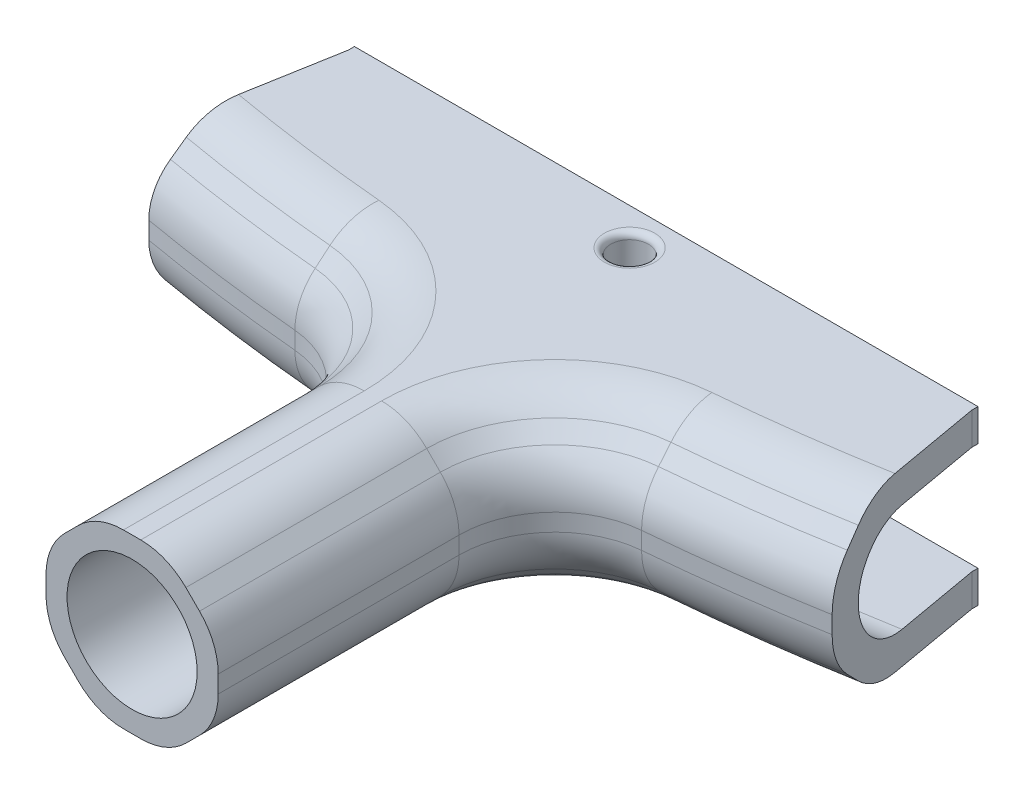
ISO-10303-21;
HEADER;
FILE_DESCRIPTION(('STEP AP214'),'2;1');
FILE_NAME('part.step','',(''),(''),'','','');
FILE_SCHEMA(('AUTOMOTIVE_DESIGN { 1 0 10303 214 1 1 1 1 }'));
ENDSEC;
DATA;
#1=APPLICATION_CONTEXT('core data for automotive mechanical design processes');
#2=APPLICATION_PROTOCOL_DEFINITION('international standard','automotive_design',2000,#1);
#3=PRODUCT_CONTEXT('',#1,'mechanical');
#4=PRODUCT('Part','Part','',(#3));
#5=PRODUCT_RELATED_PRODUCT_CATEGORY('part','',(#4));
#6=PRODUCT_DEFINITION_FORMATION('','',#4);
#7=PRODUCT_DEFINITION_CONTEXT('part definition',#1,'design');
#8=PRODUCT_DEFINITION('design','',#6,#7);
#9=PRODUCT_DEFINITION_SHAPE('','',#8);
#10=(LENGTH_UNIT() NAMED_UNIT(*) SI_UNIT(.MILLI.,.METRE.));
#11=(NAMED_UNIT(*) PLANE_ANGLE_UNIT() SI_UNIT($,.RADIAN.));
#12=(NAMED_UNIT(*) SI_UNIT($,.STERADIAN.) SOLID_ANGLE_UNIT());
#13=UNCERTAINTY_MEASURE_WITH_UNIT(LENGTH_MEASURE(1.E-05),#10,'distance_accuracy_value','');
#14=(GEOMETRIC_REPRESENTATION_CONTEXT(3) GLOBAL_UNCERTAINTY_ASSIGNED_CONTEXT((#13)) GLOBAL_UNIT_ASSIGNED_CONTEXT((#10,
#11,#12)) REPRESENTATION_CONTEXT('',''));
#15=CARTESIAN_POINT('',(0.,0.,0.));
#16=DIRECTION('',(0.,0.,1.));
#17=DIRECTION('',(1.,0.,0.));
#18=AXIS2_PLACEMENT_3D('',#15,#16,#17);
#19=CARTESIAN_POINT('',(0.,-16.5,0.));
#20=DIRECTION('',(0.,-1.,0.));
#21=DIRECTION('',(0.,0.,-1.));
#22=AXIS2_PLACEMENT_3D('',#19,#20,#21);
#23=PLANE('',#22);
#24=DIRECTION('',(0.499999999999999,0.,-0.866025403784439));
#25=VECTOR('',#24,1.);
#26=CARTESIAN_POINT('',(4.81675046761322,-16.5,281.947618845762));
#27=LINE('',#26,#25);
#28=CARTESIAN_POINT('',(4.78650819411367,-16.5,282.));
#29=VERTEX_POINT('',#28);
#30=CARTESIAN_POINT('',(2.39325409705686,-16.5,286.145237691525));
#31=VERTEX_POINT('',#30);
#32=EDGE_CURVE('E698',#29,#31,#27,.F.);
#33=ORIENTED_EDGE('',*,*,#32,.F.);
#34=DIRECTION('',(-0.500000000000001,0.,-0.866025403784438));
#35=VECTOR('',#34,1.);
#36=CARTESIAN_POINT('',(2.36301182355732,-16.5,277.802381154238));
#37=LINE('',#36,#35);
#38=CARTESIAN_POINT('',(2.39325409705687,-16.5,277.854762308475));
#39=VERTEX_POINT('',#38);
#40=EDGE_CURVE('E701',#39,#29,#37,.F.);
#41=ORIENTED_EDGE('',*,*,#40,.F.);
#42=DIRECTION('',(-1.,0.,0.));
#43=VECTOR('',#42,1.);
#44=CARTESIAN_POINT('',(-2.45373864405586,-16.5,277.854762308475));
#45=LINE('',#44,#43);
#46=CARTESIAN_POINT('',(-2.39325409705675,-16.5,277.854762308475));
#47=VERTEX_POINT('',#46);
#48=EDGE_CURVE('E684',#47,#39,#45,.F.);
#49=ORIENTED_EDGE('',*,*,#48,.F.);
#50=DIRECTION('',(-0.500000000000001,0.,0.866025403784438));
#51=VECTOR('',#50,1.);
#52=CARTESIAN_POINT('',(-4.8167504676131,-16.5,282.052381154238));
#53=LINE('',#52,#51);
#54=CARTESIAN_POINT('',(-4.78650819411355,-16.5,282.));
#55=VERTEX_POINT('',#54);
#56=EDGE_CURVE('E688',#55,#47,#53,.F.);
#57=ORIENTED_EDGE('',*,*,#56,.F.);
#58=DIRECTION('',(0.499999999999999,0.,0.866025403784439));
#59=VECTOR('',#58,1.);
#60=CARTESIAN_POINT('',(-2.36301182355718,-16.5,286.197618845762));
#61=LINE('',#60,#59);
#62=CARTESIAN_POINT('',(-2.39325409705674,-16.5,286.145237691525));
#63=VERTEX_POINT('',#62);
#64=EDGE_CURVE('E692',#63,#55,#61,.F.);
#65=ORIENTED_EDGE('',*,*,#64,.F.);
#66=DIRECTION('',(1.,0.,0.));
#67=VECTOR('',#66,1.);
#68=CARTESIAN_POINT('',(2.45373864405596,-16.5,286.145237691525));
#69=LINE('',#68,#67);
#70=EDGE_CURVE('E695',#31,#63,#69,.F.);
#71=ORIENTED_EDGE('',*,*,#70,.F.);
#72=EDGE_LOOP('',(#33,#41,#49,#57,#65,#71));
#73=FACE_BOUND('',#72,.T.);
#74=DIRECTION('',(0.,0.,-1.));
#75=VECTOR('',#74,1.);
#76=CARTESIAN_POINT('',(-5.99999999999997,-16.5,287.776617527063));
#77=LINE('',#76,#75);
#78=CARTESIAN_POINT('',(-5.99999999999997,-16.5,287.776617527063));
#79=VERTEX_POINT('',#78);
#80=CARTESIAN_POINT('',(-5.99999999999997,-16.5,276.256691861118));
#81=VERTEX_POINT('',#80);
#82=EDGE_CURVE('E672',#79,#81,#77,.T.);
#83=ORIENTED_EDGE('',*,*,#82,.T.);
#84=DIRECTION('',(1.,0.,0.));
#85=VECTOR('',#84,1.);
#86=CARTESIAN_POINT('',(0.,-16.5,276.256691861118));
#87=LINE('',#86,#85);
#88=CARTESIAN_POINT('',(6.00000000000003,-16.5,276.256691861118));
#89=VERTEX_POINT('',#88);
#90=EDGE_CURVE('E750',#81,#89,#87,.T.);
#91=ORIENTED_EDGE('',*,*,#90,.T.);
#92=DIRECTION('',(0.,0.,1.));
#93=VECTOR('',#92,1.);
#94=CARTESIAN_POINT('',(6.00000000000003,-16.5,287.776617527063));
#95=LINE('',#94,#93);
#96=CARTESIAN_POINT('',(6.00000000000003,-16.5,287.776617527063));
#97=VERTEX_POINT('',#96);
#98=EDGE_CURVE('E680',#89,#97,#95,.T.);
#99=ORIENTED_EDGE('',*,*,#98,.T.);
#100=DIRECTION('',(-1.,0.,0.));
#101=VECTOR('',#100,1.);
#102=CARTESIAN_POINT('',(-5.99999999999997,-16.5,287.776617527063));
#103=LINE('',#102,#101);
#104=EDGE_CURVE('E676',#97,#79,#103,.T.);
#105=ORIENTED_EDGE('',*,*,#104,.T.);
#106=EDGE_LOOP('',(#83,#91,#99,#105));
#107=FACE_BOUND('',#106,.T.);
#108=ADVANCED_FACE('F46',(#73,#107),#23,.T.);
#109=CARTESIAN_POINT('',(53.5704628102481,-13.5,303.813191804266));
#110=DIRECTION('',(0.,1.,0.));
#111=DIRECTION('',(0.,0.,1.));
#112=AXIS2_PLACEMENT_3D('',#109,#110,#111);
#113=PLANE('',#112);
#114=DIRECTION('',(-0.173648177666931,0.,-0.984807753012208));
#115=VECTOR('',#114,1.);
#116=CARTESIAN_POINT('',(53.5704628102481,-13.5,303.813191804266));
#117=LINE('',#116,#115);
#118=CARTESIAN_POINT('',(51.4620030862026,-13.5,291.85552250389));
#119=VERTEX_POINT('',#118);
#120=CARTESIAN_POINT('',(48.881962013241,-13.5,277.223382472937));
#121=VERTEX_POINT('',#120);
#122=EDGE_CURVE('E1181',#119,#121,#117,.T.);
#123=ORIENTED_EDGE('',*,*,#122,.F.);
#124=CARTESIAN_POINT('',(0.,-13.5,0.));
#125=DIRECTION('',(0.,1.,0.));
#126=DIRECTION('',(0.,0.,1.));
#127=AXIS2_PLACEMENT_3D('',#124,#125,#126);
#128=CIRCLE('',#127,296.357864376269);
#129=CARTESIAN_POINT('',(26.1088072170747,-13.5,295.205545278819));
#130=VERTEX_POINT('',#129);
#131=EDGE_CURVE('E932',#119,#130,#128,.F.);
#132=ORIENTED_EDGE('',*,*,#131,.T.);
#133=CARTESIAN_POINT('',(28.5,-13.5,322.242144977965));
#134=DIRECTION('',(0.,1.,0.));
#135=DIRECTION('',(0.,0.,1.));
#136=AXIS2_PLACEMENT_3D('',#133,#134,#135);
#137=CIRCLE('',#136,27.1421356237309);
#138=CARTESIAN_POINT('',(1.35786437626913,-13.5,322.242144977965));
#139=VERTEX_POINT('',#138);
#140=EDGE_CURVE('E926',#130,#139,#137,.T.);
#141=ORIENTED_EDGE('',*,*,#140,.T.);
#142=DIRECTION('',(0.,0.,1.));
#143=VECTOR('',#142,1.);
#144=CARTESIAN_POINT('',(1.35786437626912,-13.5,360.));
#145=LINE('',#144,#143);
#146=CARTESIAN_POINT('',(1.35786437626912,-13.5,360.));
#147=VERTEX_POINT('',#146);
#148=EDGE_CURVE('E929',#139,#147,#145,.T.);
#149=ORIENTED_EDGE('',*,*,#148,.T.);
#150=DIRECTION('',(1.,0.,0.));
#151=VECTOR('',#150,1.);
#152=CARTESIAN_POINT('',(-13.5,-13.5,360.));
#153=LINE('',#152,#151);
#154=CARTESIAN_POINT('',(-1.35786437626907,-13.5,360.));
#155=VERTEX_POINT('',#154);
#156=EDGE_CURVE('E1328',#155,#147,#153,.T.);
#157=ORIENTED_EDGE('',*,*,#156,.F.);
#158=DIRECTION('',(0.,0.,-1.));
#159=VECTOR('',#158,1.);
#160=CARTESIAN_POINT('',(-1.35786437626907,-13.5,322.242144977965));
#161=LINE('',#160,#159);
#162=CARTESIAN_POINT('',(-1.35786437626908,-13.5,322.242144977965));
#163=VERTEX_POINT('',#162);
#164=EDGE_CURVE('E922',#155,#163,#161,.T.);
#165=ORIENTED_EDGE('',*,*,#164,.T.);
#166=CARTESIAN_POINT('',(-28.5,-13.5,322.242144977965));
#167=DIRECTION('',(0.,1.,0.));
#168=DIRECTION('',(0.,0.,1.));
#169=AXIS2_PLACEMENT_3D('',#166,#167,#168);
#170=CIRCLE('',#169,27.1421356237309);
#171=CARTESIAN_POINT('',(-26.1088072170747,-13.5,295.205545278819));
#172=VERTEX_POINT('',#171);
#173=EDGE_CURVE('E919',#163,#172,#170,.T.);
#174=ORIENTED_EDGE('',*,*,#173,.T.);
#175=CARTESIAN_POINT('',(0.,-13.5,0.));
#176=DIRECTION('',(0.,1.,0.));
#177=DIRECTION('',(0.,0.,1.));
#178=AXIS2_PLACEMENT_3D('',#175,#176,#177);
#179=CIRCLE('',#178,296.357864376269);
#180=CARTESIAN_POINT('',(-51.4620030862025,-13.5,291.85552250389));
#181=VERTEX_POINT('',#180);
#182=EDGE_CURVE('E916',#172,#181,#179,.F.);
#183=ORIENTED_EDGE('',*,*,#182,.T.);
#184=DIRECTION('',(0.173648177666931,0.,-0.984807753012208));
#185=VECTOR('',#184,1.);
#186=CARTESIAN_POINT('',(-53.5704628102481,-13.5,303.813191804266));
#187=LINE('',#186,#185);
#188=CARTESIAN_POINT('',(-48.881962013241,-13.5,277.223382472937));
#189=VERTEX_POINT('',#188);
#190=EDGE_CURVE('E1262',#181,#189,#187,.T.);
#191=ORIENTED_EDGE('',*,*,#190,.T.);
#192=DIRECTION('',(0.,0.,-1.));
#193=VECTOR('',#192,1.);
#194=CARTESIAN_POINT('',(-48.881962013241,-13.5,278.223382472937));
#195=LINE('',#194,#193);
#196=CARTESIAN_POINT('',(-48.881962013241,-13.5,276.256691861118));
#197=VERTEX_POINT('',#196);
#198=EDGE_CURVE('E471',#189,#197,#195,.T.);
#199=ORIENTED_EDGE('',*,*,#198,.T.);
#200=DIRECTION('',(-1.,0.,0.));
#201=VECTOR('',#200,1.);
#202=CARTESIAN_POINT('',(53.5704628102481,-13.5,276.256691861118));
#203=LINE('',#202,#201);
#204=CARTESIAN_POINT('',(-10.5825756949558,-13.5,276.256691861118));
#205=VERTEX_POINT('',#204);
#206=EDGE_CURVE('E444',#205,#197,#203,.T.);
#207=ORIENTED_EDGE('',*,*,#206,.F.);
#208=DIRECTION('',(0.,0.,-1.));
#209=VECTOR('',#208,1.);
#210=CARTESIAN_POINT('',(-10.5825756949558,-13.5,303.813191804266));
#211=LINE('',#210,#209);
#212=CARTESIAN_POINT('',(-10.5825756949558,-13.5,292.359193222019));
#213=VERTEX_POINT('',#212);
#214=EDGE_CURVE('E777',#205,#213,#211,.F.);
#215=ORIENTED_EDGE('',*,*,#214,.T.);
#216=DIRECTION('',(-1.,0.,0.));
#217=VECTOR('',#216,1.);
#218=CARTESIAN_POINT('',(53.5704628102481,-13.5,292.359193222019));
#219=LINE('',#218,#217);
#220=CARTESIAN_POINT('',(10.5825756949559,-13.5,292.359193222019));
#221=VERTEX_POINT('',#220);
#222=EDGE_CURVE('E773',#213,#221,#219,.F.);
#223=ORIENTED_EDGE('',*,*,#222,.T.);
#224=DIRECTION('',(0.,0.,1.));
#225=VECTOR('',#224,1.);
#226=CARTESIAN_POINT('',(10.5825756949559,-13.5,303.813191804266));
#227=LINE('',#226,#225);
#228=CARTESIAN_POINT('',(10.5825756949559,-13.5,276.256691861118));
#229=VERTEX_POINT('',#228);
#230=EDGE_CURVE('E769',#221,#229,#227,.F.);
#231=ORIENTED_EDGE('',*,*,#230,.T.);
#232=CARTESIAN_POINT('',(48.881962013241,-13.5,276.256691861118));
#233=VERTEX_POINT('',#232);
#234=EDGE_CURVE('E742',#233,#229,#203,.T.);
#235=ORIENTED_EDGE('',*,*,#234,.F.);
#236=DIRECTION('',(0.,0.,-1.));
#237=VECTOR('',#236,1.);
#238=CARTESIAN_POINT('',(48.881962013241,-13.5,278.223382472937));
#239=LINE('',#238,#237);
#240=EDGE_CURVE('E486',#121,#233,#239,.T.);
#241=ORIENTED_EDGE('',*,*,#240,.F.);
#242=EDGE_LOOP('',(#123,#132,#141,#149,#157,#165,#174,#183,#191,#199,#207,#215,#223,#231,#235,#241));
#243=FACE_BOUND('',#242,.T.);
#244=ADVANCED_FACE('F556',(#243),#113,.F.);
#245=CARTESIAN_POINT('',(-48.881962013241,13.5,278.223382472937));
#246=DIRECTION('',(-1.,0.,0.));
#247=DIRECTION('',(0.,0.,1.));
#248=AXIS2_PLACEMENT_3D('',#245,#246,#247);
#249=PLANE('',#248);
#250=DIRECTION('',(0.,0.,-1.));
#251=VECTOR('',#250,1.);
#252=CARTESIAN_POINT('',(-48.881962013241,-8.45,278.223382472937));
#253=LINE('',#252,#251);
#254=CARTESIAN_POINT('',(-48.881962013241,-8.45,277.223382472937));
#255=VERTEX_POINT('',#254);
#256=CARTESIAN_POINT('',(-48.881962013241,-8.45,276.256691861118));
#257=VERTEX_POINT('',#256);
#258=EDGE_CURVE('E639',#255,#257,#253,.T.);
#259=ORIENTED_EDGE('',*,*,#258,.T.);
#260=DIRECTION('',(0.,-1.,0.));
#261=VECTOR('',#260,1.);
#262=CARTESIAN_POINT('',(-48.881962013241,13.5,276.256691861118));
#263=LINE('',#262,#261);
#264=EDGE_CURVE('E743',#257,#197,#263,.T.);
#265=ORIENTED_EDGE('',*,*,#264,.T.);
#266=ORIENTED_EDGE('',*,*,#198,.F.);
#267=DIRECTION('',(0.,1.,0.));
#268=VECTOR('',#267,1.);
#269=CARTESIAN_POINT('',(-48.881962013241,13.5,277.223382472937));
#270=LINE('',#269,#268);
#271=EDGE_CURVE('E1257',#189,#255,#270,.T.);
#272=ORIENTED_EDGE('',*,*,#271,.T.);
#273=EDGE_LOOP('',(#259,#265,#266,#272));
#274=FACE_BOUND('',#273,.T.);
#275=ADVANCED_FACE('F590',(#274),#249,.T.);
#276=DIRECTION('',(0.,0.,-1.));
#277=VECTOR('',#276,1.);
#278=CARTESIAN_POINT('',(-48.881962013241,13.5,278.223382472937));
#279=LINE('',#278,#277);
#280=CARTESIAN_POINT('',(-48.881962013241,13.5,277.223382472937));
#281=VERTEX_POINT('',#280);
#282=CARTESIAN_POINT('',(-48.881962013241,13.5,276.256691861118));
#283=VERTEX_POINT('',#282);
#284=EDGE_CURVE('E464',#281,#283,#279,.T.);
#285=ORIENTED_EDGE('',*,*,#284,.T.);
#286=DIRECTION('',(0.,-1.,0.));
#287=VECTOR('',#286,1.);
#288=CARTESIAN_POINT('',(-48.881962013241,13.5,276.256691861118));
#289=LINE('',#288,#287);
#290=CARTESIAN_POINT('',(-48.881962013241,8.45,276.256691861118));
#291=VERTEX_POINT('',#290);
#292=EDGE_CURVE('E438',#283,#291,#289,.T.);
#293=ORIENTED_EDGE('',*,*,#292,.T.);
#294=DIRECTION('',(0.,0.,1.));
#295=VECTOR('',#294,1.);
#296=CARTESIAN_POINT('',(-48.881962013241,8.45,278.223382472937));
#297=LINE('',#296,#295);
#298=CARTESIAN_POINT('',(-48.881962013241,8.45,277.223382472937));
#299=VERTEX_POINT('',#298);
#300=EDGE_CURVE('E658',#291,#299,#297,.T.);
#301=ORIENTED_EDGE('',*,*,#300,.T.);
#302=EDGE_CURVE('E1265',#299,#281,#270,.T.);
#303=ORIENTED_EDGE('',*,*,#302,.T.);
#304=EDGE_LOOP('',(#285,#293,#301,#303));
#305=FACE_BOUND('',#304,.T.);
#306=ADVANCED_FACE('F1335',(#305),#249,.T.);
#307=CARTESIAN_POINT('',(48.881962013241,13.5,278.223382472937));
#308=DIRECTION('',(1.,0.,0.));
#309=DIRECTION('',(0.,0.,-1.));
#310=AXIS2_PLACEMENT_3D('',#307,#308,#309);
#311=PLANE('',#310);
#312=ORIENTED_EDGE('',*,*,#240,.T.);
#313=DIRECTION('',(0.,1.,0.));
#314=VECTOR('',#313,1.);
#315=CARTESIAN_POINT('',(48.881962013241,13.5,276.256691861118));
#316=LINE('',#315,#314);
#317=CARTESIAN_POINT('',(48.881962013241,-8.45,276.256691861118));
#318=VERTEX_POINT('',#317);
#319=EDGE_CURVE('E734',#233,#318,#316,.T.);
#320=ORIENTED_EDGE('',*,*,#319,.T.);
#321=DIRECTION('',(0.,0.,1.));
#322=VECTOR('',#321,1.);
#323=CARTESIAN_POINT('',(48.881962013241,-8.45,278.223382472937));
#324=LINE('',#323,#322);
#325=CARTESIAN_POINT('',(48.881962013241,-8.45,277.223382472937));
#326=VERTEX_POINT('',#325);
#327=EDGE_CURVE('E643',#318,#326,#324,.T.);
#328=ORIENTED_EDGE('',*,*,#327,.T.);
#329=DIRECTION('',(0.,1.,0.));
#330=VECTOR('',#329,1.);
#331=CARTESIAN_POINT('',(48.881962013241,13.5,277.223382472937));
#332=LINE('',#331,#330);
#333=EDGE_CURVE('E1276',#121,#326,#332,.T.);
#334=ORIENTED_EDGE('',*,*,#333,.F.);
#335=EDGE_LOOP('',(#312,#320,#328,#334));
#336=FACE_BOUND('',#335,.T.);
#337=ADVANCED_FACE('F1289',(#336),#311,.T.);
#338=DIRECTION('',(0.,0.,-1.));
#339=VECTOR('',#338,1.);
#340=CARTESIAN_POINT('',(48.881962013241,8.45,278.223382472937));
#341=LINE('',#340,#339);
#342=CARTESIAN_POINT('',(48.881962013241,8.45,277.223382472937));
#343=VERTEX_POINT('',#342);
#344=CARTESIAN_POINT('',(48.881962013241,8.45,276.256691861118));
#345=VERTEX_POINT('',#344);
#346=EDGE_CURVE('E454',#343,#345,#341,.T.);
#347=ORIENTED_EDGE('',*,*,#346,.T.);
#348=DIRECTION('',(0.,1.,0.));
#349=VECTOR('',#348,1.);
#350=CARTESIAN_POINT('',(48.881962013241,13.5,276.256691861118));
#351=LINE('',#350,#349);
#352=CARTESIAN_POINT('',(48.881962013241,13.5,276.256691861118));
#353=VERTEX_POINT('',#352);
#354=EDGE_CURVE('E435',#345,#353,#351,.T.);
#355=ORIENTED_EDGE('',*,*,#354,.T.);
#356=DIRECTION('',(0.,0.,-1.));
#357=VECTOR('',#356,1.);
#358=CARTESIAN_POINT('',(48.881962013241,13.5,278.223382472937));
#359=LINE('',#358,#357);
#360=CARTESIAN_POINT('',(48.881962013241,13.5,277.223382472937));
#361=VERTEX_POINT('',#360);
#362=EDGE_CURVE('E452',#361,#353,#359,.T.);
#363=ORIENTED_EDGE('',*,*,#362,.F.);
#364=EDGE_CURVE('E1275',#343,#361,#332,.T.);
#365=ORIENTED_EDGE('',*,*,#364,.F.);
#366=EDGE_LOOP('',(#347,#355,#363,#365));
#367=FACE_BOUND('',#366,.T.);
#368=ADVANCED_FACE('F450',(#367),#311,.T.);
#369=CARTESIAN_POINT('',(53.5704628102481,13.5,303.813191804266));
#370=DIRECTION('',(0.,-1.,0.));
#371=DIRECTION('',(0.,0.,-1.));
#372=AXIS2_PLACEMENT_3D('',#369,#370,#371);
#373=PLANE('',#372);
#374=CARTESIAN_POINT('',(0.,13.5,282.));
#375=DIRECTION('',(0.,-1.,0.));
#376=DIRECTION('',(0.,0.,-1.));
#377=AXIS2_PLACEMENT_3D('',#374,#375,#376);
#378=CIRCLE('',#377,3.94999999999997);
#379=CARTESIAN_POINT('',(0.,13.5,278.05));
#380=VERTEX_POINT('',#379);
#381=EDGE_CURVE('E853',#380,#380,#378,.T.);
#382=ORIENTED_EDGE('',*,*,#381,.T.);
#383=EDGE_LOOP('',(#382));
#384=FACE_BOUND('',#383,.T.);
#385=DIRECTION('',(-1.,0.,0.));
#386=VECTOR('',#385,1.);
#387=CARTESIAN_POINT('',(-13.5,13.5,360.));
#388=LINE('',#387,#386);
#389=CARTESIAN_POINT('',(1.35786437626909,13.5,360.));
#390=VERTEX_POINT('',#389);
#391=CARTESIAN_POINT('',(-1.35786437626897,13.5,360.));
#392=VERTEX_POINT('',#391);
#393=EDGE_CURVE('E1318',#390,#392,#388,.T.);
#394=ORIENTED_EDGE('',*,*,#393,.F.);
#395=DIRECTION('',(0.,0.,-1.));
#396=VECTOR('',#395,1.);
#397=CARTESIAN_POINT('',(1.35786437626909,13.5,322.242144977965));
#398=LINE('',#397,#396);
#399=CARTESIAN_POINT('',(1.35786437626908,13.5,322.242144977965));
#400=VERTEX_POINT('',#399);
#401=EDGE_CURVE('E876',#390,#400,#398,.T.);
#402=ORIENTED_EDGE('',*,*,#401,.T.);
#403=CARTESIAN_POINT('',(28.5,13.5,322.242144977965));
#404=DIRECTION('',(0.,-1.,0.));
#405=DIRECTION('',(0.,0.,-1.));
#406=AXIS2_PLACEMENT_3D('',#403,#404,#405);
#407=CIRCLE('',#406,27.1421356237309);
#408=CARTESIAN_POINT('',(26.1088072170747,13.5,295.205545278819));
#409=VERTEX_POINT('',#408);
#410=EDGE_CURVE('E873',#400,#409,#407,.T.);
#411=ORIENTED_EDGE('',*,*,#410,.T.);
#412=CARTESIAN_POINT('',(0.,13.5,0.));
#413=DIRECTION('',(0.,-1.,0.));
#414=DIRECTION('',(0.,0.,-1.));
#415=AXIS2_PLACEMENT_3D('',#412,#413,#414);
#416=CIRCLE('',#415,296.357864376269);
#417=CARTESIAN_POINT('',(51.4620030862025,13.5,291.85552250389));
#418=VERTEX_POINT('',#417);
#419=EDGE_CURVE('E870',#409,#418,#416,.F.);
#420=ORIENTED_EDGE('',*,*,#419,.T.);
#421=DIRECTION('',(0.173648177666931,0.,0.984807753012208));
#422=VECTOR('',#421,1.);
#423=CARTESIAN_POINT('',(53.5704628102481,13.5,303.813191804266));
#424=LINE('',#423,#422);
#425=EDGE_CURVE('E461',#361,#418,#424,.T.);
#426=ORIENTED_EDGE('',*,*,#425,.F.);
#427=ORIENTED_EDGE('',*,*,#362,.T.);
#428=DIRECTION('',(-1.,0.,0.));
#429=VECTOR('',#428,1.);
#430=CARTESIAN_POINT('',(-51.881962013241,13.5,276.256691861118));
#431=LINE('',#430,#429);
#432=EDGE_CURVE('E432',#353,#283,#431,.T.);
#433=ORIENTED_EDGE('',*,*,#432,.T.);
#434=ORIENTED_EDGE('',*,*,#284,.F.);
#435=DIRECTION('',(-0.173648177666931,0.,0.984807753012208));
#436=VECTOR('',#435,1.);
#437=CARTESIAN_POINT('',(-53.5704628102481,13.5,303.813191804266));
#438=LINE('',#437,#436);
#439=CARTESIAN_POINT('',(-51.4620030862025,13.5,291.85552250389));
#440=VERTEX_POINT('',#439);
#441=EDGE_CURVE('E1253',#281,#440,#438,.T.);
#442=ORIENTED_EDGE('',*,*,#441,.T.);
#443=CARTESIAN_POINT('',(0.,13.5,0.));
#444=DIRECTION('',(0.,-1.,0.));
#445=DIRECTION('',(0.,0.,-1.));
#446=AXIS2_PLACEMENT_3D('',#443,#444,#445);
#447=CIRCLE('',#446,296.357864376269);
#448=CARTESIAN_POINT('',(-26.1088072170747,13.5,295.205545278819));
#449=VERTEX_POINT('',#448);
#450=EDGE_CURVE('E860',#440,#449,#447,.F.);
#451=ORIENTED_EDGE('',*,*,#450,.T.);
#452=CARTESIAN_POINT('',(-28.5,13.5,322.242144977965));
#453=DIRECTION('',(0.,-1.,0.));
#454=DIRECTION('',(0.,0.,-1.));
#455=AXIS2_PLACEMENT_3D('',#452,#453,#454);
#456=CIRCLE('',#455,27.142135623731);
#457=CARTESIAN_POINT('',(-1.35786437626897,13.5,322.242144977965));
#458=VERTEX_POINT('',#457);
#459=EDGE_CURVE('E863',#449,#458,#456,.T.);
#460=ORIENTED_EDGE('',*,*,#459,.T.);
#461=DIRECTION('',(0.,0.,1.));
#462=VECTOR('',#461,1.);
#463=CARTESIAN_POINT('',(-1.35786437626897,13.5,360.));
#464=LINE('',#463,#462);
#465=EDGE_CURVE('E866',#458,#392,#464,.T.);
#466=ORIENTED_EDGE('',*,*,#465,.T.);
#467=EDGE_LOOP('',(#394,#402,#411,#420,#426,#427,#433,#434,#442,#451,#460,#466));
#468=FACE_BOUND('',#467,.T.);
#469=ADVANCED_FACE('F459',(#384,#468),#373,.F.);
#470=CARTESIAN_POINT('',(0.,8.45,295.));
#471=DIRECTION('',(0.,-1.,0.));
#472=DIRECTION('',(0.,0.,-1.));
#473=AXIS2_PLACEMENT_3D('',#470,#471,#472);
#474=PLANE('',#473);
#475=CARTESIAN_POINT('',(0.,8.45,282.));
#476=DIRECTION('',(0.,-1.,0.));
#477=DIRECTION('',(0.,0.,-1.));
#478=AXIS2_PLACEMENT_3D('',#475,#476,#477);
#479=CIRCLE('',#478,2.94999999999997);
#480=CARTESIAN_POINT('',(0.,8.45,279.05));
#481=VERTEX_POINT('',#480);
#482=EDGE_CURVE('E646',#481,#481,#479,.F.);
#483=ORIENTED_EDGE('',*,*,#482,.T.);
#484=EDGE_LOOP('',(#483));
#485=FACE_BOUND('',#484,.T.);
#486=ORIENTED_EDGE('',*,*,#300,.F.);
#487=DIRECTION('',(1.,0.,0.));
#488=VECTOR('',#487,1.);
#489=CARTESIAN_POINT('',(0.,8.45,276.256691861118));
#490=LINE('',#489,#488);
#491=EDGE_CURVE('E456',#291,#345,#490,.T.);
#492=ORIENTED_EDGE('',*,*,#491,.T.);
#493=ORIENTED_EDGE('',*,*,#346,.F.);
#494=DIRECTION('',(-0.173648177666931,0.,-0.984807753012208));
#495=VECTOR('',#494,1.);
#496=CARTESIAN_POINT('',(0.,8.45,0.));
#497=LINE('',#496,#495);
#498=CARTESIAN_POINT('',(51.2262124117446,8.45,290.518287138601));
#499=VERTEX_POINT('',#498);
#500=EDGE_CURVE('E650',#499,#343,#497,.T.);
#501=ORIENTED_EDGE('',*,*,#500,.F.);
#502=CARTESIAN_POINT('',(0.,8.45,0.));
#503=DIRECTION('',(0.,-1.,0.));
#504=DIRECTION('',(0.,0.,-1.));
#505=AXIS2_PLACEMENT_3D('',#502,#503,#504);
#506=CIRCLE('',#505,295.);
#507=CARTESIAN_POINT('',(0.,8.45,295.));
#508=VERTEX_POINT('',#507);
#509=EDGE_CURVE('E668',#499,#508,#506,.T.);
#510=ORIENTED_EDGE('',*,*,#509,.T.);
#511=CARTESIAN_POINT('',(-51.2262124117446,8.45,290.518287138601));
#512=VERTEX_POINT('',#511);
#513=EDGE_CURVE('E671',#508,#512,#506,.T.);
#514=ORIENTED_EDGE('',*,*,#513,.T.);
#515=DIRECTION('',(0.173648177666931,0.,-0.984807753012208));
#516=VECTOR('',#515,1.);
#517=CARTESIAN_POINT('',(0.,8.45,0.));
#518=LINE('',#517,#516);
#519=EDGE_CURVE('E654',#512,#299,#518,.T.);
#520=ORIENTED_EDGE('',*,*,#519,.T.);
#521=EDGE_LOOP('',(#486,#492,#493,#501,#510,#514,#520));
#522=FACE_BOUND('',#521,.T.);
#523=ADVANCED_FACE('F1298',(#485,#522),#474,.T.);
#524=CARTESIAN_POINT('',(0.,-8.45,295.));
#525=DIRECTION('',(0.,1.,0.));
#526=DIRECTION('',(0.,0.,1.));
#527=AXIS2_PLACEMENT_3D('',#524,#525,#526);
#528=PLANE('',#527);
#529=CARTESIAN_POINT('',(0.,-8.45,282.));
#530=DIRECTION('',(0.,1.,0.));
#531=DIRECTION('',(0.,0.,1.));
#532=AXIS2_PLACEMENT_3D('',#529,#530,#531);
#533=CIRCLE('',#532,2.94999999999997);
#534=CARTESIAN_POINT('',(0.,-8.45,284.95));
#535=VERTEX_POINT('',#534);
#536=EDGE_CURVE('E628',#535,#535,#533,.F.);
#537=ORIENTED_EDGE('',*,*,#536,.T.);
#538=EDGE_LOOP('',(#537));
#539=FACE_BOUND('',#538,.T.);
#540=ORIENTED_EDGE('',*,*,#327,.F.);
#541=DIRECTION('',(-1.,0.,0.));
#542=VECTOR('',#541,1.);
#543=CARTESIAN_POINT('',(0.,-8.45,276.256691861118));
#544=LINE('',#543,#542);
#545=EDGE_CURVE('E738',#318,#257,#544,.T.);
#546=ORIENTED_EDGE('',*,*,#545,.T.);
#547=ORIENTED_EDGE('',*,*,#258,.F.);
#548=DIRECTION('',(-0.173648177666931,0.,0.984807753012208));
#549=VECTOR('',#548,1.);
#550=CARTESIAN_POINT('',(0.,-8.45,0.));
#551=LINE('',#550,#549);
#552=CARTESIAN_POINT('',(-51.2262124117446,-8.45,290.518287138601));
#553=VERTEX_POINT('',#552);
#554=EDGE_CURVE('E636',#255,#553,#551,.T.);
#555=ORIENTED_EDGE('',*,*,#554,.T.);
#556=CARTESIAN_POINT('',(0.,-8.45,0.));
#557=DIRECTION('',(0.,-1.,0.));
#558=DIRECTION('',(0.,0.,-1.));
#559=AXIS2_PLACEMENT_3D('',#556,#557,#558);
#560=CIRCLE('',#559,295.);
#561=CARTESIAN_POINT('',(0.,-8.45,295.));
#562=VERTEX_POINT('',#561);
#563=EDGE_CURVE('E667',#562,#553,#560,.T.);
#564=ORIENTED_EDGE('',*,*,#563,.F.);
#565=CARTESIAN_POINT('',(51.2262124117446,-8.45,290.518287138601));
#566=VERTEX_POINT('',#565);
#567=EDGE_CURVE('E663',#566,#562,#560,.T.);
#568=ORIENTED_EDGE('',*,*,#567,.F.);
#569=DIRECTION('',(0.173648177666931,0.,0.984807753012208));
#570=VECTOR('',#569,1.);
#571=CARTESIAN_POINT('',(0.,-8.45,0.));
#572=LINE('',#571,#570);
#573=EDGE_CURVE('E632',#326,#566,#572,.T.);
#574=ORIENTED_EDGE('',*,*,#573,.F.);
#575=EDGE_LOOP('',(#540,#546,#547,#555,#564,#568,#574));
#576=FACE_BOUND('',#575,.T.);
#577=ADVANCED_FACE('F1293',(#539,#576),#528,.T.);
#578=CARTESIAN_POINT('',(10.5825756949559,-18.5,287.776617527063));
#579=DIRECTION('',(0.,0.,1.));
#580=DIRECTION('',(1.,0.,0.));
#581=AXIS2_PLACEMENT_3D('',#578,#579,#580);
#582=CYLINDRICAL_SURFACE('',#581,5.);
#583=CARTESIAN_POINT('',(10.5825756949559,-18.5,276.256691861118));
#584=DIRECTION('',(0.,0.,-1.));
#585=DIRECTION('',(-1.,0.,0.));
#586=AXIS2_PLACEMENT_3D('',#583,#584,#585);
#587=CIRCLE('',#586,5.);
#588=EDGE_CURVE('E747',#229,#89,#587,.F.);
#589=ORIENTED_EDGE('',*,*,#588,.F.);
#590=ORIENTED_EDGE('',*,*,#230,.F.);
#591=CARTESIAN_POINT('',(10.5825756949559,-18.5,292.359193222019));
#592=DIRECTION('',(-0.707106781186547,0.,0.707106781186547));
#593=DIRECTION('',(0.707106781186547,0.,0.707106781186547));
#594=AXIS2_PLACEMENT_3D('',#591,#592,#593);
#595=ELLIPSE('',#594,7.07106781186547,5.);
#596=EDGE_CURVE('E683',#97,#221,#595,.F.);
#597=ORIENTED_EDGE('',*,*,#596,.F.);
#598=ORIENTED_EDGE('',*,*,#98,.F.);
#599=EDGE_LOOP('',(#589,#590,#597,#598));
#600=FACE_BOUND('',#599,.T.);
#601=ADVANCED_FACE('F767',(#600),#582,.F.);
#602=CARTESIAN_POINT('',(-10.5825756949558,-18.5,287.776617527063));
#603=DIRECTION('',(0.,0.,-1.));
#604=DIRECTION('',(-1.,0.,0.));
#605=AXIS2_PLACEMENT_3D('',#602,#603,#604);
#606=CYLINDRICAL_SURFACE('',#605,5.);
#607=CARTESIAN_POINT('',(-10.5825756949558,-18.5,276.256691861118));
#608=DIRECTION('',(0.,0.,-1.));
#609=DIRECTION('',(-1.,0.,0.));
#610=AXIS2_PLACEMENT_3D('',#607,#608,#609);
#611=CIRCLE('',#610,5.);
#612=EDGE_CURVE('E857',#81,#205,#611,.F.);
#613=ORIENTED_EDGE('',*,*,#612,.F.);
#614=ORIENTED_EDGE('',*,*,#82,.F.);
#615=CARTESIAN_POINT('',(-10.5825756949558,-18.5,292.359193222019));
#616=DIRECTION('',(-0.707106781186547,0.,-0.707106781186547));
#617=DIRECTION('',(0.707106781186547,0.,-0.707106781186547));
#618=AXIS2_PLACEMENT_3D('',#615,#616,#617);
#619=ELLIPSE('',#618,7.07106781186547,5.);
#620=EDGE_CURVE('E784',#213,#79,#619,.T.);
#621=ORIENTED_EDGE('',*,*,#620,.F.);
#622=ORIENTED_EDGE('',*,*,#214,.F.);
#623=EDGE_LOOP('',(#613,#614,#621,#622));
#624=FACE_BOUND('',#623,.T.);
#625=ADVANCED_FACE('F1480',(#624),#606,.F.);
#626=CARTESIAN_POINT('',(0.,-13.5,282.));
#627=DIRECTION('',(0.,1.,0.));
#628=DIRECTION('',(0.,0.,1.));
#629=AXIS2_PLACEMENT_3D('',#626,#627,#628);
#630=CYLINDRICAL_SURFACE('',#629,2.94999999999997);
#631=ORIENTED_EDGE('',*,*,#536,.F.);
#632=EDGE_LOOP('',(#631));
#633=FACE_BOUND('',#632,.T.);
#634=CARTESIAN_POINT('',(0.,-13.5,282.));
#635=DIRECTION('',(0.,-1.,0.));
#636=DIRECTION('',(0.,0.,-1.));
#637=AXIS2_PLACEMENT_3D('',#634,#635,#636);
#638=CIRCLE('',#637,2.94999999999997);
#639=CARTESIAN_POINT('',(0.,-13.5,279.05));
#640=VERTEX_POINT('',#639);
#641=EDGE_CURVE('E728',#640,#640,#638,.F.);
#642=ORIENTED_EDGE('',*,*,#641,.F.);
#643=EDGE_LOOP('',(#642));
#644=FACE_BOUND('',#643,.T.);
#645=ADVANCED_FACE('F1484',(#633,#644),#630,.F.);
#646=CARTESIAN_POINT('',(0.,0.,0.));
#647=DIRECTION('',(0.,-1.,0.));
#648=DIRECTION('',(0.,0.,-1.));
#649=AXIS2_PLACEMENT_3D('',#646,#647,#648);
#650=TOROIDAL_SURFACE('',#649,295.,8.44999999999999);
#651=CARTESIAN_POINT('',(51.2262124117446,0.,290.518287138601));
#652=DIRECTION('',(0.984807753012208,0.,-0.173648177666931));
#653=DIRECTION('',(-0.173648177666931,0.,-0.984807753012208));
#654=AXIS2_PLACEMENT_3D('',#651,#652,#653);
#655=CIRCLE('',#654,8.44999999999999);
#656=EDGE_CURVE('E1271',#499,#566,#655,.T.);
#657=ORIENTED_EDGE('',*,*,#656,.T.);
#658=ORIENTED_EDGE('',*,*,#567,.T.);
#659=CARTESIAN_POINT('',(-32.956539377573,-8.24830626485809,295.));
#660=CARTESIAN_POINT('',(-32.2524777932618,-8.2656922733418,295.));
#661=CARTESIAN_POINT('',(-31.5483764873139,-8.28137567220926,295.));
#662=CARTESIAN_POINT('',(-30.1401174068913,-8.30976658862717,295.));
#663=CARTESIAN_POINT('',(-29.4359596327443,-8.3224741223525,295.));
#664=CARTESIAN_POINT('',(-27.3234746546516,-8.35677636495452,295.));
#665=CARTESIAN_POINT('',(-25.9150857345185,-8.37455189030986,295.));
#666=CARTESIAN_POINT('',(-23.0982840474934,-8.40279979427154,295.));
#667=CARTESIAN_POINT('',(-21.6898712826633,-8.41327239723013,295.));
#668=CARTESIAN_POINT('',(-19.5772242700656,-8.42525059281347,295.));
#669=CARTESIAN_POINT('',(-18.8729996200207,-8.42862154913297,295.));
#670=CARTESIAN_POINT('',(-17.4645461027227,-8.43436197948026,295.));
#671=CARTESIAN_POINT('',(-16.7603172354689,-8.4367314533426,295.));
#672=CARTESIAN_POINT('',(-15.0350126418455,-8.44158370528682,295.));
#673=CARTESIAN_POINT('',(-14.0139357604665,-8.4436378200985,295.));
#674=CARTESIAN_POINT('',(-11.9717803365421,-8.44668025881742,295.));
#675=CARTESIAN_POINT('',(-10.9507017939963,-8.44766858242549,295.));
#676=CARTESIAN_POINT('',(-8.90854436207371,-8.4490279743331,295.));
#677=CARTESIAN_POINT('',(-7.88746547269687,-8.44939904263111,295.));
#678=CARTESIAN_POINT('',(-5.84530779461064,-8.44984544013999,295.));
#679=CARTESIAN_POINT('',(-4.82422900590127,-8.44992076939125,295.));
#680=CARTESIAN_POINT('',(-1.76100808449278,-8.45005178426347,295.));
#681=CARTESIAN_POINT('',(0.281134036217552,-8.45001249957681,295.));
#682=CARTESIAN_POINT('',(4.36541863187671,-8.44997759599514,295.));
#683=CARTESIAN_POINT('',(6.40756110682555,-8.44998197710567,295.));
#684=CARTESIAN_POINT('',(9.47086423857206,-8.44870967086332,295.));
#685=CARTESIAN_POINT('',(10.492025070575,-8.4480723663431,295.));
#686=CARTESIAN_POINT('',(12.5343456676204,-8.44595772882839,295.));
#687=CARTESIAN_POINT('',(13.5555054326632,-8.4444803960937,295.));
#688=CARTESIAN_POINT('',(15.5978122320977,-8.44018266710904,295.));
#689=CARTESIAN_POINT('',(16.6189592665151,-8.43736228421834,295.));
#690=CARTESIAN_POINT('',(18.6612458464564,-8.42974565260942,295.));
#691=CARTESIAN_POINT('',(19.6823853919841,-8.42494940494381,295.));
#692=CARTESIAN_POINT('',(21.7246759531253,-8.41262651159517,295.));
#693=CARTESIAN_POINT('',(22.7458269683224,-8.40509979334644,295.));
#694=CARTESIAN_POINT('',(24.7880930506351,-8.38642667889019,295.));
#695=CARTESIAN_POINT('',(25.8092081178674,-8.37528029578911,295.));
#696=CARTESIAN_POINT('',(27.8514201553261,-8.3483501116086,295.));
#697=CARTESIAN_POINT('',(28.8725171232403,-8.33256612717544,295.));
#698=CARTESIAN_POINT('',(30.9146156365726,-8.29513752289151,295.));
#699=CARTESIAN_POINT('',(31.9356171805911,-8.27349282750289,295.));
#700=CARTESIAN_POINT('',(32.956539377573,-8.24830626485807,295.));
#701=B_SPLINE_CURVE_WITH_KNOTS('',3,(#659,#660,#661,#662,#663,#664,#665,#666,#667,#668,#669,
#670,#671,#672,#673,#674,#675,#676,#677,#678,#679,#680,#681,#682,#683,#684,#685,#686,#687,#688,
#689,#690,#691,#692,#693,#694,#695,#696,#697,#698,#699,#700),.UNSPECIFIED.,.F.,.F.,(4,2,2,2,2,2,
2,2,2,2,2,2,2,2,2,2,2,2,2,2,4),(0.,2.11282307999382,4.22563467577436,8.45110764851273,
12.6764508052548,14.7891483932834,16.9018463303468,19.9650822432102,23.0283190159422,
26.0915557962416,29.154792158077,35.2812185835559,41.4076457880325,44.4711286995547,
47.5346106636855,50.5980621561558,53.6615120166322,56.7250432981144,59.788563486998,
62.8522048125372,65.9158856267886),.UNSPECIFIED.);
#702=CARTESIAN_POINT('',(2.07064067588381,-8.44999687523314,295.));
#703=VERTEX_POINT('',#702);
#704=EDGE_CURVE('E1184',#562,#703,#701,.T.);
#705=ORIENTED_EDGE('',*,*,#704,.T.);
#706=CARTESIAN_POINT('',(2.07063998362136,8.44999704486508,294.9998));
#707=CARTESIAN_POINT('',(2.07080081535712,8.44994868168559,295.070951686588));
#708=CARTESIAN_POINT('',(2.07479129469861,8.44897992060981,295.142030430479));
#709=CARTESIAN_POINT('',(2.08976336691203,8.4452937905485,295.28318714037));
#710=CARTESIAN_POINT('',(2.10072310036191,8.44258188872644,295.353267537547));
#711=CARTESIAN_POINT('',(2.12867949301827,8.43557424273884,295.490575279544));
#712=CARTESIAN_POINT('',(2.14554524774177,8.43131277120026,295.557831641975));
#713=CARTESIAN_POINT('',(2.18444522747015,8.42131855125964,295.690756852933));
#714=CARTESIAN_POINT('',(2.20648382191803,8.41558455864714,295.756424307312));
#715=CARTESIAN_POINT('',(2.27094529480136,8.39848379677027,295.92928358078));
#716=CARTESIAN_POINT('',(2.31715611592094,8.38591177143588,296.034938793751));
#717=CARTESIAN_POINT('',(2.41780761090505,8.35744865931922,296.241756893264));
#718=CARTESIAN_POINT('',(2.4722547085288,8.34155497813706,296.342916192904));
#719=CARTESIAN_POINT('',(2.58759948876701,8.3065042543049,296.542747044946));
#720=CARTESIAN_POINT('',(2.64857504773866,8.28730564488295,296.641365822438));
#721=CARTESIAN_POINT('',(2.77453430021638,8.24599060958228,296.835301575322));
#722=CARTESIAN_POINT('',(2.83951679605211,8.22387505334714,296.930619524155));
#723=CARTESIAN_POINT('',(3.00472899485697,8.16532749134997,297.164509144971));
#724=CARTESIAN_POINT('',(3.10666014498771,8.1271819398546,297.301446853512));
#725=CARTESIAN_POINT('',(3.31414274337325,8.044808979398,297.570704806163));
#726=CARTESIAN_POINT('',(3.41969547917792,8.00057939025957,297.703023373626));
#727=CARTESIAN_POINT('',(3.63294506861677,7.90603122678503,297.963969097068));
#728=CARTESIAN_POINT('',(3.74064425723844,7.85570568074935,298.092591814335));
#729=CARTESIAN_POINT('',(3.95700017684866,7.74898176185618,298.346476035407));
#730=CARTESIAN_POINT('',(4.06565701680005,7.69258268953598,298.47173714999));
#731=CARTESIAN_POINT('',(4.39114842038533,7.51457120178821,298.842114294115));
#732=CARTESIAN_POINT('',(4.60823467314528,7.38382628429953,299.082699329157));
#733=CARTESIAN_POINT('',(5.03831330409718,7.09733775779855,299.551980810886));
#734=CARTESIAN_POINT('',(5.25130874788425,6.94161375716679,299.780686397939));
#735=CARTESIAN_POINT('',(5.62961104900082,6.6366132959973,300.182697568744));
#736=CARTESIAN_POINT('',(5.79621711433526,6.4918475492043,300.358204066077));
#737=CARTESIAN_POINT('',(6.1227531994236,6.1848297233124,300.700028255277));
#738=CARTESIAN_POINT('',(6.282682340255,6.02257535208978,300.866344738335));
#739=CARTESIAN_POINT('',(6.59363778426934,5.68043196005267,301.188171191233));
#740=CARTESIAN_POINT('',(6.74467685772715,5.50056927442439,301.343696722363));
#741=CARTESIAN_POINT('',(7.03595036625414,5.1227218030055,301.642508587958));
#742=CARTESIAN_POINT('',(7.17618526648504,4.92473779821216,301.785795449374));
#743=CARTESIAN_POINT('',(7.41005483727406,4.56237804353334,302.024061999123));
#744=CARTESIAN_POINT('',(7.50659122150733,4.40192871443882,302.122179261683));
#745=CARTESIAN_POINT('',(7.69105658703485,4.07105783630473,302.3093222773));
#746=CARTESIAN_POINT('',(7.77898609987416,3.90063690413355,302.398348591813));
#747=CARTESIAN_POINT('',(7.94502643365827,3.55023082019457,302.566208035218));
#748=CARTESIAN_POINT('',(8.02313739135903,3.3702458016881,302.645041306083));
#749=CARTESIAN_POINT('',(8.16825836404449,3.00146538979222,302.791328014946));
#750=CARTESIAN_POINT('',(8.23527331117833,2.81267395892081,302.858786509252));
#751=CARTESIAN_POINT('',(8.35761819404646,2.42526031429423,302.981826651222));
#752=CARTESIAN_POINT('',(8.41282357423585,2.22655820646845,303.03728176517));
#753=CARTESIAN_POINT('',(8.50950146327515,1.82250530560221,303.134331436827));
#754=CARTESIAN_POINT('',(8.550973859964,1.61715445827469,303.175925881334));
#755=CARTESIAN_POINT('',(8.61916427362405,1.20177379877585,303.244288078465));
#756=CARTESIAN_POINT('',(8.64589599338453,0.991748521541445,303.271069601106));
#757=CARTESIAN_POINT('',(8.68397075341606,0.568930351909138,303.309208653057));
#758=CARTESIAN_POINT('',(8.6953164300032,0.356137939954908,303.320568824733));
#759=CARTESIAN_POINT('',(8.70180509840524,-0.0380690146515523,303.32706605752));
#760=CARTESIAN_POINT('',(8.69911682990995,-0.219418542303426,303.324374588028));
#761=CARTESIAN_POINT('',(8.6824598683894,-0.581075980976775,303.307693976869));
#762=CARTESIAN_POINT('',(8.6684915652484,-0.761383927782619,303.293705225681));
#763=CARTESIAN_POINT('',(8.62954257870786,-1.11957719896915,303.254684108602));
#764=CARTESIAN_POINT('',(8.60456255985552,-1.29746266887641,303.229652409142));
#765=CARTESIAN_POINT('',(8.54404992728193,-1.64958496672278,303.168980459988));
#766=CARTESIAN_POINT('',(8.50851695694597,-1.82382167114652,303.133339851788));
#767=CARTESIAN_POINT('',(8.42864494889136,-2.16272716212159,303.053166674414));
#768=CARTESIAN_POINT('',(8.38458195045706,-2.32752721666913,303.008912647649));
#769=CARTESIAN_POINT('',(8.28771740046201,-2.65187378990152,302.911541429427));
#770=CARTESIAN_POINT('',(8.23491275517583,-2.81141842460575,302.858421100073));
#771=CARTESIAN_POINT('',(8.0644310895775,-3.28110910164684,302.686738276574));
#772=CARTESIAN_POINT('',(7.93463567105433,-3.58252157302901,302.555803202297));
#773=CARTESIAN_POINT('',(7.68908704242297,-4.07693698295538,302.307337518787));
#774=CARTESIAN_POINT('',(7.57965905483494,-4.27658005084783,302.196401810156));
#775=CARTESIAN_POINT('',(7.34918996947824,-4.66151072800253,301.96214037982));
#776=CARTESIAN_POINT('',(7.22814482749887,-4.84679329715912,301.838810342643));
#777=CARTESIAN_POINT('',(6.97606333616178,-5.20310574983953,301.581141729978));
#778=CARTESIAN_POINT('',(6.84500385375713,-5.37410059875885,301.446777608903));
#779=CARTESIAN_POINT('',(6.57484520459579,-5.70144233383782,301.168702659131));
#780=CARTESIAN_POINT('',(6.43574608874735,-5.8577893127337,301.024991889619));
#781=CARTESIAN_POINT('',(6.10051190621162,-6.20900725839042,300.67693131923));
#782=CARTESIAN_POINT('',(5.90164181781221,-6.39788055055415,300.469148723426));
#783=CARTESIAN_POINT('',(5.49531316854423,-6.75010093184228,300.04064760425));
#784=CARTESIAN_POINT('',(5.28785044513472,-6.91343546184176,299.819922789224));
#785=CARTESIAN_POINT('',(4.86809429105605,-7.21514503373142,299.367266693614));
#786=CARTESIAN_POINT('',(4.65580971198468,-7.35356221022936,299.135355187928));
#787=CARTESIAN_POINT('',(4.22991404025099,-7.60651511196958,298.66029380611));
#788=CARTESIAN_POINT('',(4.01630371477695,-7.72106352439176,298.417149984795));
#789=CARTESIAN_POINT('',(3.62837565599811,-7.90969039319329,297.959709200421));
#790=CARTESIAN_POINT('',(3.45346439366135,-7.98733343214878,297.747393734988));
#791=CARTESIAN_POINT('',(3.1971294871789,-8.09178264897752,297.419814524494));
#792=CARTESIAN_POINT('',(3.11256879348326,-8.12463630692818,297.308932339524));
#793=CARTESIAN_POINT('',(2.9468427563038,-8.18620461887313,297.083582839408));
#794=CARTESIAN_POINT('',(2.86567686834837,-8.21491993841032,296.969116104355));
#795=CARTESIAN_POINT('',(2.67395405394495,-8.27973689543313,296.684595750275));
#796=CARTESIAN_POINT('',(2.5660657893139,-8.31357734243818,296.51212350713));
#797=CARTESIAN_POINT('',(2.41986092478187,-8.3568469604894,296.244587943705));
#798=CARTESIAN_POINT('',(2.37389562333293,-8.36998090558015,296.154346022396));
#799=CARTESIAN_POINT('',(2.28899454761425,-8.39359434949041,295.970316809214));
#800=CARTESIAN_POINT('',(2.25005466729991,-8.40407540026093,295.87653162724));
#801=CARTESIAN_POINT('',(2.17168763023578,-8.42471878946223,295.656926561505));
#802=CARTESIAN_POINT('',(2.13547024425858,-8.43388518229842,295.52978173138));
#803=CARTESIAN_POINT('',(2.0976806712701,-8.44333556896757,295.33452635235));
#804=CARTESIAN_POINT('',(2.08782925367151,-8.44577094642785,295.268099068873));
#805=CARTESIAN_POINT('',(2.0743861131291,-8.44907924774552,295.134407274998));
#806=CARTESIAN_POINT('',(2.07081080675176,-8.44994807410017,295.067141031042));
#807=CARTESIAN_POINT('',(2.0706399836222,-8.44999704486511,294.9998));
#808=B_SPLINE_CURVE_WITH_KNOTS('',3,(#706,#707,#708,#709,#710,#711,#712,#713,#714,#715,#716,
#717,#718,#719,#720,#721,#722,#723,#724,#725,#726,#727,#728,#729,#730,#731,#732,#733,#734,#735,
#736,#737,#738,#739,#740,#741,#742,#743,#744,#745,#746,#747,#748,#749,#750,#751,#752,#753,#754,
#755,#756,#757,#758,#759,#760,#761,#762,#763,#764,#765,#766,#767,#768,#769,#770,#771,#772,#773,
#774,#775,#776,#777,#778,#779,#780,#781,#782,#783,#784,#785,#786,#787,#788,#789,#790,#791,#792,
#793,#794,#795,#796,#797,#798,#799,#800,#801,#802,#803,#804,#805,#806,#807),.UNSPECIFIED.,.F.,
.F.,(4,2,2,2,2,2,2,2,2,2,2,2,2,2,2,2,2,2,2,2,2,2,2,2,2,2,2,2,2,2,2,2,2,2,2,2,2,2,2,2,2,2,2,2,2,
2,2,2,2,2,4),(0.,0.213256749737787,0.425847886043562,0.633997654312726,0.842323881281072,
1.18968788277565,1.53732421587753,1.88970372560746,2.24197841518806,2.76646261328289,
3.29113524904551,3.81641369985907,4.34175270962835,5.38888913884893,6.43520756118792,
7.28047539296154,8.12585414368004,8.96998731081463,9.8140841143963,10.447745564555,
11.0813678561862,11.7149813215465,12.3483123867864,12.9880255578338,13.6277439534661,
14.2668666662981,14.905879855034,15.4493597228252,15.9928208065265,16.5362490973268,
17.0796957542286,17.6078448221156,18.1361812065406,19.192195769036,19.9510706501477,
20.7102106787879,21.4711606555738,22.2321058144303,23.2628719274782,24.2941433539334,
25.3236542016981,26.3526164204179,27.2093910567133,27.6390562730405,28.0686523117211,
28.6861097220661,28.9922099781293,29.298130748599,29.6938176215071,29.8951207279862,
30.0969496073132),.UNSPECIFIED.);
#809=CARTESIAN_POINT('',(2.07064067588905,8.44999687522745,295.));
#810=VERTEX_POINT('',#809);
#811=EDGE_CURVE('E504',#810,#703,#808,.T.);
#812=ORIENTED_EDGE('',*,*,#811,.F.);
#813=CARTESIAN_POINT('',(32.956539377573,8.24830626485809,295.));
#814=CARTESIAN_POINT('',(32.2524777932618,8.2656922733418,295.));
#815=CARTESIAN_POINT('',(31.5483764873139,8.28137567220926,295.));
#816=CARTESIAN_POINT('',(30.1401174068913,8.30976658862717,295.));
#817=CARTESIAN_POINT('',(29.4359596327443,8.3224741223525,295.));
#818=CARTESIAN_POINT('',(27.3234746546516,8.35677636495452,295.));
#819=CARTESIAN_POINT('',(25.9150857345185,8.37455189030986,295.));
#820=CARTESIAN_POINT('',(23.0982840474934,8.40279979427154,295.));
#821=CARTESIAN_POINT('',(21.6898712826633,8.41327239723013,295.));
#822=CARTESIAN_POINT('',(19.5772242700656,8.42525059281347,295.));
#823=CARTESIAN_POINT('',(18.8729996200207,8.42862154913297,295.));
#824=CARTESIAN_POINT('',(17.4645461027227,8.43436197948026,295.));
#825=CARTESIAN_POINT('',(16.7603172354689,8.4367314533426,295.));
#826=CARTESIAN_POINT('',(15.0350126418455,8.44158370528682,295.));
#827=CARTESIAN_POINT('',(14.0139357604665,8.4436378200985,295.));
#828=CARTESIAN_POINT('',(11.9717803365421,8.44668025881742,295.));
#829=CARTESIAN_POINT('',(10.9507017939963,8.44766858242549,295.));
#830=CARTESIAN_POINT('',(8.90854436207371,8.4490279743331,295.));
#831=CARTESIAN_POINT('',(7.88746547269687,8.44939904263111,295.));
#832=CARTESIAN_POINT('',(5.84530779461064,8.44984544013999,295.));
#833=CARTESIAN_POINT('',(4.82422900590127,8.44992076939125,295.));
#834=CARTESIAN_POINT('',(1.76100808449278,8.45005178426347,295.));
#835=CARTESIAN_POINT('',(-0.281134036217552,8.45001249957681,295.));
#836=CARTESIAN_POINT('',(-4.36541863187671,8.44997759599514,295.));
#837=CARTESIAN_POINT('',(-6.40756110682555,8.44998197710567,295.));
#838=CARTESIAN_POINT('',(-9.47086423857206,8.44870967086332,295.));
#839=CARTESIAN_POINT('',(-10.492025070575,8.4480723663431,295.));
#840=CARTESIAN_POINT('',(-12.5343456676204,8.44595772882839,295.));
#841=CARTESIAN_POINT('',(-13.5555054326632,8.4444803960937,295.));
#842=CARTESIAN_POINT('',(-15.5978122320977,8.44018266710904,295.));
#843=CARTESIAN_POINT('',(-16.6189592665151,8.43736228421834,295.));
#844=CARTESIAN_POINT('',(-18.6612458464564,8.42974565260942,295.));
#845=CARTESIAN_POINT('',(-19.6823853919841,8.42494940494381,295.));
#846=CARTESIAN_POINT('',(-21.7246759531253,8.41262651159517,295.));
#847=CARTESIAN_POINT('',(-22.7458269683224,8.40509979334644,295.));
#848=CARTESIAN_POINT('',(-24.7880930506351,8.38642667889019,295.));
#849=CARTESIAN_POINT('',(-25.8092081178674,8.37528029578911,295.));
#850=CARTESIAN_POINT('',(-27.8514201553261,8.3483501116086,295.));
#851=CARTESIAN_POINT('',(-28.8725171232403,8.33256612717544,295.));
#852=CARTESIAN_POINT('',(-30.9146156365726,8.29513752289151,295.));
#853=CARTESIAN_POINT('',(-31.9356171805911,8.27349282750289,295.));
#854=CARTESIAN_POINT('',(-32.956539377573,8.24830626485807,295.));
#855=B_SPLINE_CURVE_WITH_KNOTS('',3,(#813,#814,#815,#816,#817,#818,#819,#820,#821,#822,#823,
#824,#825,#826,#827,#828,#829,#830,#831,#832,#833,#834,#835,#836,#837,#838,#839,#840,#841,#842,
#843,#844,#845,#846,#847,#848,#849,#850,#851,#852,#853,#854),.UNSPECIFIED.,.F.,.F.,(4,2,2,2,2,2,
2,2,2,2,2,2,2,2,2,2,2,2,2,2,4),(0.,2.11282307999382,4.22563467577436,8.45110764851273,
12.6764508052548,14.7891483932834,16.9018463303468,19.9650822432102,23.0283190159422,
26.0915557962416,29.154792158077,35.2812185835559,41.4076457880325,44.4711286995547,
47.5346106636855,50.5980621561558,53.6615120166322,56.7250432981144,59.788563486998,
62.8522048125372,65.9158856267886),.UNSPECIFIED.);
#856=EDGE_CURVE('E1196',#810,#508,#855,.T.);
#857=ORIENTED_EDGE('',*,*,#856,.T.);
#858=ORIENTED_EDGE('',*,*,#509,.F.);
#859=EDGE_LOOP('',(#657,#658,#705,#812,#857,#858));
#860=FACE_BOUND('',#859,.T.);
#861=ADVANCED_FACE('F510',(#860),#650,.F.);
#862=CARTESIAN_POINT('',(-2.07064067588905,-8.44999687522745,295.));
#863=VERTEX_POINT('',#862);
#864=EDGE_CURVE('E542',#863,#562,#701,.T.);
#865=ORIENTED_EDGE('',*,*,#864,.T.);
#866=ORIENTED_EDGE('',*,*,#563,.T.);
#867=CARTESIAN_POINT('',(-51.2262124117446,0.,290.518287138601));
#868=DIRECTION('',(0.984807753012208,0.,0.173648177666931));
#869=DIRECTION('',(0.173648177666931,0.,-0.984807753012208));
#870=AXIS2_PLACEMENT_3D('',#867,#868,#869);
#871=CIRCLE('',#870,8.44999999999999);
#872=EDGE_CURVE('E1303',#512,#553,#871,.T.);
#873=ORIENTED_EDGE('',*,*,#872,.F.);
#874=ORIENTED_EDGE('',*,*,#513,.F.);
#875=CARTESIAN_POINT('',(-2.07064067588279,8.44999687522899,295.));
#876=VERTEX_POINT('',#875);
#877=EDGE_CURVE('E1191',#508,#876,#855,.T.);
#878=ORIENTED_EDGE('',*,*,#877,.T.);
#879=CARTESIAN_POINT('',(-2.07063998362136,-8.44999704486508,294.9998));
#880=CARTESIAN_POINT('',(-2.07080081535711,-8.44994868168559,295.070951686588));
#881=CARTESIAN_POINT('',(-2.0747912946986,-8.44897992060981,295.142030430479));
#882=CARTESIAN_POINT('',(-2.08976336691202,-8.4452937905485,295.28318714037));
#883=CARTESIAN_POINT('',(-2.10072310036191,-8.44258188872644,295.353267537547));
#884=CARTESIAN_POINT('',(-2.12867949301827,-8.43557424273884,295.490575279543));
#885=CARTESIAN_POINT('',(-2.14554524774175,-8.43131277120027,295.557831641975));
#886=CARTESIAN_POINT('',(-2.18444522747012,-8.42131855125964,295.690756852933));
#887=CARTESIAN_POINT('',(-2.20648382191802,-8.41558455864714,295.756424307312));
#888=CARTESIAN_POINT('',(-2.27094529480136,-8.39848379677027,295.92928358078));
#889=CARTESIAN_POINT('',(-2.31715611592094,-8.38591177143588,296.034938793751));
#890=CARTESIAN_POINT('',(-2.41780761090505,-8.35744865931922,296.241756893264));
#891=CARTESIAN_POINT('',(-2.4722547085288,-8.34155497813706,296.342916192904));
#892=CARTESIAN_POINT('',(-2.58759948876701,-8.3065042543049,296.542747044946));
#893=CARTESIAN_POINT('',(-2.64857504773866,-8.28730564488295,296.641365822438));
#894=CARTESIAN_POINT('',(-2.77453430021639,-8.24599060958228,296.835301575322));
#895=CARTESIAN_POINT('',(-2.83951679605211,-8.22387505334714,296.930619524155));
#896=CARTESIAN_POINT('',(-3.00472899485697,-8.16532749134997,297.164509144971));
#897=CARTESIAN_POINT('',(-3.10666014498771,-8.1271819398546,297.301446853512));
#898=CARTESIAN_POINT('',(-3.31414274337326,-8.044808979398,297.570704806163));
#899=CARTESIAN_POINT('',(-3.41969547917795,-8.00057939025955,297.703023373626));
#900=CARTESIAN_POINT('',(-3.63294506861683,-7.90603122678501,297.963969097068));
#901=CARTESIAN_POINT('',(-3.7406442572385,-7.85570568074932,298.092591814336));
#902=CARTESIAN_POINT('',(-3.95700017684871,-7.74898176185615,298.346476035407));
#903=CARTESIAN_POINT('',(-4.0656570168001,-7.69258268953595,298.47173714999));
#904=CARTESIAN_POINT('',(-4.39114842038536,-7.51457120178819,298.842114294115));
#905=CARTESIAN_POINT('',(-4.6082346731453,-7.38382628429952,299.082699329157));
#906=CARTESIAN_POINT('',(-5.03831330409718,-7.09733775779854,299.551980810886));
#907=CARTESIAN_POINT('',(-5.25130874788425,-6.94161375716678,299.780686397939));
#908=CARTESIAN_POINT('',(-5.62961104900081,-6.6366132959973,300.182697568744));
#909=CARTESIAN_POINT('',(-5.79621711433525,-6.49184754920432,300.358204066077));
#910=CARTESIAN_POINT('',(-6.12275319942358,-6.18482972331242,300.700028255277));
#911=CARTESIAN_POINT('',(-6.28268234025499,-6.02257535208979,300.866344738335));
#912=CARTESIAN_POINT('',(-6.59363778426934,-5.68043196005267,301.188171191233));
#913=CARTESIAN_POINT('',(-6.74467685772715,-5.50056927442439,301.343696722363));
#914=CARTESIAN_POINT('',(-7.03595036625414,-5.12272180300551,301.642508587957));
#915=CARTESIAN_POINT('',(-7.17618526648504,-4.92473779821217,301.785795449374));
#916=CARTESIAN_POINT('',(-7.41005483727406,-4.56237804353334,302.024061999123));
#917=CARTESIAN_POINT('',(-7.50659122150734,-4.40192871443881,302.122179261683));
#918=CARTESIAN_POINT('',(-7.69105658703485,-4.07105783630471,302.3093222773));
#919=CARTESIAN_POINT('',(-7.77898609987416,-3.90063690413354,302.398348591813));
#920=CARTESIAN_POINT('',(-7.94502643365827,-3.55023082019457,302.566208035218));
#921=CARTESIAN_POINT('',(-8.02313739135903,-3.3702458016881,302.645041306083));
#922=CARTESIAN_POINT('',(-8.16825836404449,-3.00146538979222,302.791328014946));
#923=CARTESIAN_POINT('',(-8.23527331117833,-2.81267395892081,302.858786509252));
#924=CARTESIAN_POINT('',(-8.35761819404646,-2.42526031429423,302.981826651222));
#925=CARTESIAN_POINT('',(-8.41282357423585,-2.22655820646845,303.03728176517));
#926=CARTESIAN_POINT('',(-8.50950146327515,-1.82250530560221,303.134331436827));
#927=CARTESIAN_POINT('',(-8.550973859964,-1.61715445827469,303.175925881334));
#928=CARTESIAN_POINT('',(-8.61916427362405,-1.20177379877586,303.244288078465));
#929=CARTESIAN_POINT('',(-8.64589599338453,-0.991748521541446,303.271069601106));
#930=CARTESIAN_POINT('',(-8.68397075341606,-0.56893035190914,303.309208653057));
#931=CARTESIAN_POINT('',(-8.6953164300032,-0.356137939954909,303.320568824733));
#932=CARTESIAN_POINT('',(-8.70180509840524,0.0380690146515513,303.32706605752));
#933=CARTESIAN_POINT('',(-8.69911682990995,0.219418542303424,303.324374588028));
#934=CARTESIAN_POINT('',(-8.6824598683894,0.581075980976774,303.307693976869));
#935=CARTESIAN_POINT('',(-8.6684915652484,0.761383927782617,303.293705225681));
#936=CARTESIAN_POINT('',(-8.62954257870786,1.11957719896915,303.254684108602));
#937=CARTESIAN_POINT('',(-8.60456255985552,1.29746266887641,303.229652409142));
#938=CARTESIAN_POINT('',(-8.54404992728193,1.64958496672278,303.168980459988));
#939=CARTESIAN_POINT('',(-8.50851695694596,1.82382167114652,303.133339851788));
#940=CARTESIAN_POINT('',(-8.42864494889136,2.1627271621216,303.053166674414));
#941=CARTESIAN_POINT('',(-8.38458195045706,2.32752721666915,303.008912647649));
#942=CARTESIAN_POINT('',(-8.287717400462,2.65187378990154,302.911541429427));
#943=CARTESIAN_POINT('',(-8.23491275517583,2.81141842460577,302.858421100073));
#944=CARTESIAN_POINT('',(-8.0644310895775,3.28110910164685,302.686738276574));
#945=CARTESIAN_POINT('',(-7.93463567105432,3.58252157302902,302.555803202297));
#946=CARTESIAN_POINT('',(-7.68908704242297,4.07693698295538,302.307337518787));
#947=CARTESIAN_POINT('',(-7.57965905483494,4.27658005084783,302.196401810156));
#948=CARTESIAN_POINT('',(-7.34918996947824,4.66151072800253,301.96214037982));
#949=CARTESIAN_POINT('',(-7.22814482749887,4.84679329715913,301.838810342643));
#950=CARTESIAN_POINT('',(-6.97606333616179,5.20310574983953,301.581141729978));
#951=CARTESIAN_POINT('',(-6.84500385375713,5.37410059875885,301.446777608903));
#952=CARTESIAN_POINT('',(-6.57484520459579,5.70144233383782,301.168702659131));
#953=CARTESIAN_POINT('',(-6.43574608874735,5.8577893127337,301.024991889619));
#954=CARTESIAN_POINT('',(-6.10051190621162,6.20900725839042,300.67693131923));
#955=CARTESIAN_POINT('',(-5.90164181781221,6.39788055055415,300.469148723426));
#956=CARTESIAN_POINT('',(-5.49531316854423,6.75010093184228,300.04064760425));
#957=CARTESIAN_POINT('',(-5.28785044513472,6.91343546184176,299.819922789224));
#958=CARTESIAN_POINT('',(-4.86809429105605,7.21514503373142,299.367266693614));
#959=CARTESIAN_POINT('',(-4.65580971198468,7.35356221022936,299.135355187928));
#960=CARTESIAN_POINT('',(-4.22991404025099,7.60651511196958,298.66029380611));
#961=CARTESIAN_POINT('',(-4.01630371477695,7.72106352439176,298.417149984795));
#962=CARTESIAN_POINT('',(-3.62837565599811,7.90969039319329,297.959709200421));
#963=CARTESIAN_POINT('',(-3.45346439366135,7.98733343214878,297.747393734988));
#964=CARTESIAN_POINT('',(-3.1971294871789,8.09178264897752,297.419814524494));
#965=CARTESIAN_POINT('',(-3.11256879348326,8.12463630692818,297.308932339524));
#966=CARTESIAN_POINT('',(-2.9468427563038,8.18620461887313,297.083582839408));
#967=CARTESIAN_POINT('',(-2.86567686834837,8.21491993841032,296.969116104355));
#968=CARTESIAN_POINT('',(-2.67395405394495,8.27973689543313,296.684595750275));
#969=CARTESIAN_POINT('',(-2.56606578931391,8.31357734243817,296.51212350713));
#970=CARTESIAN_POINT('',(-2.41986092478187,8.3568469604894,296.244587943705));
#971=CARTESIAN_POINT('',(-2.37389562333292,8.36998090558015,296.154346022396));
#972=CARTESIAN_POINT('',(-2.28899454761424,8.39359434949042,295.970316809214));
#973=CARTESIAN_POINT('',(-2.25005466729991,8.40407540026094,295.87653162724));
#974=CARTESIAN_POINT('',(-2.1716876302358,8.42471878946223,295.656926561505));
#975=CARTESIAN_POINT('',(-2.13547024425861,8.43388518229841,295.52978173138));
#976=CARTESIAN_POINT('',(-2.09768067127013,8.44333556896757,295.33452635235));
#977=CARTESIAN_POINT('',(-2.08782925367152,8.44577094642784,295.268099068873));
#978=CARTESIAN_POINT('',(-2.0743861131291,8.44907924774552,295.134407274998));
#979=CARTESIAN_POINT('',(-2.07081080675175,8.44994807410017,295.067141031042));
#980=CARTESIAN_POINT('',(-2.0706399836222,8.44999704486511,294.9998));
#981=B_SPLINE_CURVE_WITH_KNOTS('',3,(#879,#880,#881,#882,#883,#884,#885,#886,#887,#888,#889,
#890,#891,#892,#893,#894,#895,#896,#897,#898,#899,#900,#901,#902,#903,#904,#905,#906,#907,#908,
#909,#910,#911,#912,#913,#914,#915,#916,#917,#918,#919,#920,#921,#922,#923,#924,#925,#926,#927,
#928,#929,#930,#931,#932,#933,#934,#935,#936,#937,#938,#939,#940,#941,#942,#943,#944,#945,#946,
#947,#948,#949,#950,#951,#952,#953,#954,#955,#956,#957,#958,#959,#960,#961,#962,#963,#964,#965,
#966,#967,#968,#969,#970,#971,#972,#973,#974,#975,#976,#977,#978,#979,#980),.UNSPECIFIED.,.F.,
.F.,(4,2,2,2,2,2,2,2,2,2,2,2,2,2,2,2,2,2,2,2,2,2,2,2,2,2,2,2,2,2,2,2,2,2,2,2,2,2,2,2,2,2,2,2,2,
2,2,2,2,2,4),(0.,0.213256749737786,0.425847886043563,0.633997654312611,0.842323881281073,
1.18968788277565,1.53732421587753,1.88970372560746,2.24197841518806,2.76646261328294,
3.29113524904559,3.81641369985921,4.34175270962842,5.38888913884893,6.43520756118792,
7.28047539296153,8.12585414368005,8.96998731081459,9.81408411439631,10.447745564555,
11.0813678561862,11.7149813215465,12.3483123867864,12.9880255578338,13.6277439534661,
14.2668666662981,14.905879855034,15.4493597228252,15.9928208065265,16.5362490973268,
17.0796957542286,17.6078448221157,18.1361812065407,19.192195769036,19.9510706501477,
20.7102106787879,21.4711606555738,22.2321058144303,23.2628719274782,24.2941433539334,
25.3236542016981,26.3526164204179,27.2093910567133,27.6390562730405,28.0686523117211,
28.6861097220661,28.9922099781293,29.298130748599,29.693817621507,29.8951207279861,
30.0969496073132),.UNSPECIFIED.);
#982=EDGE_CURVE('E494',#863,#876,#981,.T.);
#983=ORIENTED_EDGE('',*,*,#982,.F.);
#984=EDGE_LOOP('',(#865,#866,#873,#874,#878,#983));
#985=FACE_BOUND('',#984,.T.);
#986=ADVANCED_FACE('F1301',(#985),#650,.F.);
#987=CARTESIAN_POINT('',(0.,0.,0.));
#988=DIRECTION('',(0.984807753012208,0.,-0.173648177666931));
#989=DIRECTION('',(-0.173648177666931,0.,-0.984807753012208));
#990=AXIS2_PLACEMENT_3D('',#987,#988,#989);
#991=PLANE('',#990);
#992=DIRECTION('',(-0.122787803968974,-0.707106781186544,-0.696364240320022));
#993=VECTOR('',#992,1.);
#994=CARTESIAN_POINT('',(0.,-313.999999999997,0.));
#995=LINE('',#994,#993);
#996=CARTESIAN_POINT('',(53.0618590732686,-8.42893218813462,300.928756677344));
#997=VERTEX_POINT('',#996);
#998=CARTESIAN_POINT('',(52.6898811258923,-10.5710678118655,298.81916490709));
#999=VERTEX_POINT('',#998);
#1000=EDGE_CURVE('E1136',#997,#999,#995,.T.);
#1001=ORIENTED_EDGE('',*,*,#1000,.T.);
#1002=CARTESIAN_POINT('',(51.4620030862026,-3.49999999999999,291.85552250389));
#1003=DIRECTION('',(0.984807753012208,0.,-0.173648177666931));
#1004=DIRECTION('',(-0.173648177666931,0.,-0.984807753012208));
#1005=AXIS2_PLACEMENT_3D('',#1002,#1003,#1004);
#1006=CIRCLE('',#1005,10.);
#1007=EDGE_CURVE('E951',#999,#119,#1006,.T.);
#1008=ORIENTED_EDGE('',*,*,#1007,.T.);
#1009=ORIENTED_EDGE('',*,*,#122,.T.);
#1010=ORIENTED_EDGE('',*,*,#333,.T.);
#1011=ORIENTED_EDGE('',*,*,#573,.T.);
#1012=ORIENTED_EDGE('',*,*,#656,.F.);
#1013=ORIENTED_EDGE('',*,*,#500,.T.);
#1014=ORIENTED_EDGE('',*,*,#364,.T.);
#1015=ORIENTED_EDGE('',*,*,#425,.T.);
#1016=CARTESIAN_POINT('',(51.4620030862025,3.5,291.85552250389));
#1017=DIRECTION('',(0.984807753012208,0.,-0.173648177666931));
#1018=DIRECTION('',(-0.173648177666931,0.,-0.984807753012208));
#1019=AXIS2_PLACEMENT_3D('',#1016,#1017,#1018);
#1020=CIRCLE('',#1019,10.);
#1021=CARTESIAN_POINT('',(52.6898811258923,10.5710678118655,298.81916490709));
#1022=VERTEX_POINT('',#1021);
#1023=EDGE_CURVE('E948',#418,#1022,#1020,.T.);
#1024=ORIENTED_EDGE('',*,*,#1023,.T.);
#1025=DIRECTION('',(0.122787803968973,-0.707106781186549,0.696364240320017));
#1026=VECTOR('',#1025,1.);
#1027=CARTESIAN_POINT('',(0.,314.000000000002,0.));
#1028=LINE('',#1027,#1026);
#1029=CARTESIAN_POINT('',(53.0618590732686,8.42893218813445,300.928756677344));
#1030=VERTEX_POINT('',#1029);
#1031=EDGE_CURVE('E572',#1022,#1030,#1028,.T.);
#1032=ORIENTED_EDGE('',*,*,#1031,.T.);
#1033=CARTESIAN_POINT('',(51.8339810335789,1.35786437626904,293.965114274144));
#1034=DIRECTION('',(0.984807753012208,0.,-0.173648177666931));
#1035=DIRECTION('',(-0.173648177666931,0.,-0.984807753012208));
#1036=AXIS2_PLACEMENT_3D('',#1033,#1034,#1035);
#1037=CIRCLE('',#1036,10.);
#1038=CARTESIAN_POINT('',(53.5704628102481,1.35786437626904,303.813191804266));
#1039=VERTEX_POINT('',#1038);
#1040=EDGE_CURVE('E942',#1030,#1039,#1037,.T.);
#1041=ORIENTED_EDGE('',*,*,#1040,.T.);
#1042=DIRECTION('',(0.,-1.,0.));
#1043=VECTOR('',#1042,1.);
#1044=CARTESIAN_POINT('',(53.5704628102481,13.5,303.813191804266));
#1045=LINE('',#1044,#1043);
#1046=CARTESIAN_POINT('',(53.5704628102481,-1.35786437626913,303.813191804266));
#1047=VERTEX_POINT('',#1046);
#1048=EDGE_CURVE('E1282',#1039,#1047,#1045,.T.);
#1049=ORIENTED_EDGE('',*,*,#1048,.T.);
#1050=CARTESIAN_POINT('',(51.8339810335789,-1.35786437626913,293.965114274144));
#1051=DIRECTION('',(0.984807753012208,0.,-0.173648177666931));
#1052=DIRECTION('',(-0.173648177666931,0.,-0.984807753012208));
#1053=AXIS2_PLACEMENT_3D('',#1050,#1051,#1052);
#1054=CIRCLE('',#1053,10.);
#1055=EDGE_CURVE('E945',#1047,#997,#1054,.T.);
#1056=ORIENTED_EDGE('',*,*,#1055,.T.);
#1057=EDGE_LOOP('',(#1001,#1008,#1009,#1010,#1011,#1012,#1013,#1014,#1015,#1024,#1032,#1041,
#1049,#1056));
#1058=FACE_BOUND('',#1057,.T.);
#1059=ADVANCED_FACE('F1131',(#1058),#991,.T.);
#1060=CARTESIAN_POINT('',(0.,0.,0.));
#1061=DIRECTION('',(0.984807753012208,0.,0.173648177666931));
#1062=DIRECTION('',(0.173648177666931,0.,-0.984807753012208));
#1063=AXIS2_PLACEMENT_3D('',#1060,#1061,#1062);
#1064=PLANE('',#1063);
#1065=ORIENTED_EDGE('',*,*,#190,.F.);
#1066=CARTESIAN_POINT('',(-51.4620030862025,-3.49999999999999,291.85552250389));
#1067=DIRECTION('',(0.984807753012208,0.,0.173648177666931));
#1068=DIRECTION('',(0.173648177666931,0.,-0.984807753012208));
#1069=AXIS2_PLACEMENT_3D('',#1066,#1067,#1068);
#1070=CIRCLE('',#1069,10.);
#1071=CARTESIAN_POINT('',(-52.6898811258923,-10.5710678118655,298.819164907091));
#1072=VERTEX_POINT('',#1071);
#1073=EDGE_CURVE('E1032',#181,#1072,#1070,.F.);
#1074=ORIENTED_EDGE('',*,*,#1073,.T.);
#1075=DIRECTION('',(0.122787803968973,-0.707106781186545,-0.696364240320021));
#1076=VECTOR('',#1075,1.);
#1077=CARTESIAN_POINT('',(0.,-313.999999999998,0.));
#1078=LINE('',#1077,#1076);
#1079=CARTESIAN_POINT('',(-53.0618590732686,-8.42893218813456,300.928756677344));
#1080=VERTEX_POINT('',#1079);
#1081=EDGE_CURVE('E1238',#1072,#1080,#1078,.F.);
#1082=ORIENTED_EDGE('',*,*,#1081,.T.);
#1083=CARTESIAN_POINT('',(-51.8339810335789,-1.35786437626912,293.965114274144));
#1084=DIRECTION('',(0.984807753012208,0.,0.173648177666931));
#1085=DIRECTION('',(0.173648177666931,0.,-0.984807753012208));
#1086=AXIS2_PLACEMENT_3D('',#1083,#1084,#1085);
#1087=CIRCLE('',#1086,10.);
#1088=CARTESIAN_POINT('',(-53.5704628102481,-1.35786437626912,303.813191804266));
#1089=VERTEX_POINT('',#1088);
#1090=EDGE_CURVE('E1026',#1080,#1089,#1087,.F.);
#1091=ORIENTED_EDGE('',*,*,#1090,.T.);
#1092=DIRECTION('',(0.,-1.,0.));
#1093=VECTOR('',#1092,1.);
#1094=CARTESIAN_POINT('',(-53.5704628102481,13.5,303.813191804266));
#1095=LINE('',#1094,#1093);
#1096=CARTESIAN_POINT('',(-53.5704628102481,1.35786437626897,303.813191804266));
#1097=VERTEX_POINT('',#1096);
#1098=EDGE_CURVE('E1256',#1097,#1089,#1095,.T.);
#1099=ORIENTED_EDGE('',*,*,#1098,.F.);
#1100=CARTESIAN_POINT('',(-51.8339810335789,1.35786437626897,293.965114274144));
#1101=DIRECTION('',(0.984807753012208,0.,0.173648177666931));
#1102=DIRECTION('',(0.173648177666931,0.,-0.984807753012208));
#1103=AXIS2_PLACEMENT_3D('',#1100,#1101,#1102);
#1104=CIRCLE('',#1103,10.);
#1105=CARTESIAN_POINT('',(-53.0618590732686,8.42893218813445,300.928756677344));
#1106=VERTEX_POINT('',#1105);
#1107=EDGE_CURVE('E71',#1097,#1106,#1104,.F.);
#1108=ORIENTED_EDGE('',*,*,#1107,.T.);
#1109=DIRECTION('',(-0.122787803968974,-0.707106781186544,0.696364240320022));
#1110=VECTOR('',#1109,1.);
#1111=CARTESIAN_POINT('',(0.,313.999999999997,0.));
#1112=LINE('',#1111,#1110);
#1113=CARTESIAN_POINT('',(-52.6898811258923,10.5710678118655,298.81916490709));
#1114=VERTEX_POINT('',#1113);
#1115=EDGE_CURVE('E1139',#1106,#1114,#1112,.F.);
#1116=ORIENTED_EDGE('',*,*,#1115,.T.);
#1117=CARTESIAN_POINT('',(-51.4620030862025,3.5,291.85552250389));
#1118=DIRECTION('',(0.984807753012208,0.,0.173648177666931));
#1119=DIRECTION('',(0.173648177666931,0.,-0.984807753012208));
#1120=AXIS2_PLACEMENT_3D('',#1117,#1118,#1119);
#1121=CIRCLE('',#1120,10.);
#1122=EDGE_CURVE('E1029',#1114,#440,#1121,.F.);
#1123=ORIENTED_EDGE('',*,*,#1122,.T.);
#1124=ORIENTED_EDGE('',*,*,#441,.F.);
#1125=ORIENTED_EDGE('',*,*,#302,.F.);
#1126=ORIENTED_EDGE('',*,*,#519,.F.);
#1127=ORIENTED_EDGE('',*,*,#872,.T.);
#1128=ORIENTED_EDGE('',*,*,#554,.F.);
#1129=ORIENTED_EDGE('',*,*,#271,.F.);
#1130=EDGE_LOOP('',(#1065,#1074,#1082,#1091,#1099,#1108,#1116,#1123,#1124,#1125,#1126,#1127,
#1128,#1129));
#1131=FACE_BOUND('',#1130,.T.);
#1132=ADVANCED_FACE('F615',(#1131),#1064,.F.);
#1133=CARTESIAN_POINT('',(0.,12.5,282.));
#1134=DIRECTION('',(0.,-1.,0.));
#1135=DIRECTION('',(0.,0.,-1.));
#1136=AXIS2_PLACEMENT_3D('',#1133,#1134,#1135);
#1137=CIRCLE('',#1136,2.94999999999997);
#1138=CARTESIAN_POINT('',(0.,12.5,279.05));
#1139=VERTEX_POINT('',#1138);
#1140=EDGE_CURVE('E829',#1139,#1139,#1137,.F.);
#1141=ORIENTED_EDGE('',*,*,#1140,.T.);
#1142=EDGE_LOOP('',(#1141));
#1143=FACE_BOUND('',#1142,.T.);
#1144=ORIENTED_EDGE('',*,*,#482,.F.);
#1145=EDGE_LOOP('',(#1144));
#1146=FACE_BOUND('',#1145,.T.);
#1147=ADVANCED_FACE('F613',(#1143,#1146),#630,.F.);
#1148=CARTESIAN_POINT('',(0.,0.,277.222382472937));
#1149=DIRECTION('',(0.,0.,1.));
#1150=DIRECTION('',(1.,0.,0.));
#1151=AXIS2_PLACEMENT_3D('',#1148,#1149,#1150);
#1152=CYLINDRICAL_SURFACE('',#1151,10.2);
#1153=CARTESIAN_POINT('',(0.,0.,360.));
#1154=DIRECTION('',(0.,0.,1.));
#1155=DIRECTION('',(1.,0.,0.));
#1156=AXIS2_PLACEMENT_3D('',#1153,#1154,#1155);
#1157=CIRCLE('',#1156,10.2);
#1158=CARTESIAN_POINT('',(10.2,0.,360.));
#1159=VERTEX_POINT('',#1158);
#1160=EDGE_CURVE('E1311',#1159,#1159,#1157,.T.);
#1161=ORIENTED_EDGE('',*,*,#1160,.T.);
#1162=EDGE_LOOP('',(#1161));
#1163=FACE_BOUND('',#1162,.T.);
#1164=CARTESIAN_POINT('',(10.2,0.,331.85142085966));
#1165=CARTESIAN_POINT('',(10.2000000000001,3.350191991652E-06,331.851356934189));
#1166=CARTESIAN_POINT('',(10.1999999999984,6.70038398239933E-06,331.851293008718));
#1167=CARTESIAN_POINT('',(10.1999999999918,1.33591734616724E-05,331.851165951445));
#1168=CARTESIAN_POINT('',(10.1999999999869,1.6667770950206E-05,331.851102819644));
#1169=CARTESIAN_POINT('',(10.1999999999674,2.66354982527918E-05,331.850912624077));
#1170=CARTESIAN_POINT('',(10.1999999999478,3.32946280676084E-05,331.850785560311));
#1171=CARTESIAN_POINT('',(10.1999999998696,5.32717161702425E-05,331.850404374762));
#1172=CARTESIAN_POINT('',(10.1999999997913,6.65896744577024E-05,331.85015025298));
#1173=CARTESIAN_POINT('',(10.1999999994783,0.000106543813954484,331.849387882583));
#1174=CARTESIAN_POINT('',(10.1999999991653,0.000133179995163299,331.848879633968));
#1175=CARTESIAN_POINT('',(10.1999999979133,0.000213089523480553,331.847354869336));
#1176=CARTESIAN_POINT('',(10.1999999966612,0.00026636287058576,331.846338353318));
#1177=CARTESIAN_POINT('',(10.1999999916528,0.000426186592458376,331.843288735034));
#1178=CARTESIAN_POINT('',(10.1999999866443,0.000532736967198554,331.841255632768));
#1179=CARTESIAN_POINT('',(10.1999999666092,0.000852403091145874,331.835156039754));
#1180=CARTESIAN_POINT('',(10.1999999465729,0.00106551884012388,331.831089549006));
#1181=CARTESIAN_POINT('',(10.1999998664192,0.00170492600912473,331.818888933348));
#1182=CARTESIAN_POINT('',(10.1999997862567,0.0021312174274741,331.810754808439));
#1183=CARTESIAN_POINT('',(10.1999994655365,0.00341033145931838,331.786347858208));
#1184=CARTESIAN_POINT('',(10.1999991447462,0.00426315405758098,331.770075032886));
#1185=CARTESIAN_POINT('',(10.1999978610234,0.00682258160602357,331.7212382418));
#1186=CARTESIAN_POINT('',(10.1999965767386,0.00852918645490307,331.688674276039));
#1187=CARTESIAN_POINT('',(10.1999914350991,0.0136528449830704,331.590909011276));
#1188=CARTESIAN_POINT('',(10.1999862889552,0.017069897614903,331.525707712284));
#1189=CARTESIAN_POINT('',(10.199965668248,0.0273364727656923,331.329809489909));
#1190=CARTESIAN_POINT('',(10.1999450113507,0.034185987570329,331.199112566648));
#1191=CARTESIAN_POINT('',(10.1998620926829,0.0547965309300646,330.805837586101));
#1192=CARTESIAN_POINT('',(10.1997788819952,0.0685574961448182,330.543259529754));
#1193=CARTESIAN_POINT('',(10.1994436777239,0.110091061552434,329.750732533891));
#1194=CARTESIAN_POINT('',(10.1991060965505,0.13786314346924,329.220783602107));
#1195=CARTESIAN_POINT('',(10.1977363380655,0.222203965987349,327.61130565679));
#1196=CARTESIAN_POINT('',(10.1963468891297,0.278768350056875,326.531776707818));
#1197=CARTESIAN_POINT('',(10.1906244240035,0.452743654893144,323.210783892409));
#1198=CARTESIAN_POINT('',(10.1847328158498,0.57011612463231,320.969320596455));
#1199=CARTESIAN_POINT('',(10.1596826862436,0.94098564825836,313.880614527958));
#1200=CARTESIAN_POINT('',(10.1330633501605,1.19410456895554,309.03337727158));
#1201=CARTESIAN_POINT('',(10.096954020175,1.44620866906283,304.186154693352));
#1202=B_SPLINE_CURVE_WITH_KNOTS('',3,(#1164,#1165,#1166,#1167,#1168,#1169,#1170,#1171,#1172,
#1173,#1174,#1175,#1176,#1177,#1178,#1179,#1180,#1181,#1182,#1183,#1184,#1185,#1186,#1187,#1188,
#1189,#1190,#1191,#1192,#1193,#1194,#1195,#1196,#1197,#1198,#1199,#1200,#1201),.UNSPECIFIED.,
.F.,.F.,(4,2,2,2,2,2,2,2,2,2,2,2,2,2,2,2,2,2,4),(0.,0.000192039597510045,0.000381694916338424,
0.000763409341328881,0.00152682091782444,0.00305365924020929,0.00610739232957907,
0.0122150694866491,0.0244312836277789,0.0488671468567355,0.0977526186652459,0.195578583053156,
0.391450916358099,0.784079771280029,1.57289499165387,3.16492366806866,6.40795548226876,
13.1415779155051,27.7032861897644),.UNSPECIFIED.);
#1203=CARTESIAN_POINT('',(10.2,0.,331.85142085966));
#1204=VERTEX_POINT('',#1203);
#1205=CARTESIAN_POINT('',(10.1255356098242,1.23025550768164,308.333785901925));
#1206=VERTEX_POINT('',#1205);
#1207=EDGE_CURVE('E602',#1204,#1206,#1202,.T.);
#1208=ORIENTED_EDGE('',*,*,#1207,.F.);
#1209=CARTESIAN_POINT('',(10.2,0.,331.85142085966));
#1210=CARTESIAN_POINT('',(10.2000000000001,-3.350191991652E-06,331.851356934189));
#1211=CARTESIAN_POINT('',(10.1999999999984,-6.70038398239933E-06,331.851293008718));
#1212=CARTESIAN_POINT('',(10.1999999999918,-1.33591734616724E-05,331.851165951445));
#1213=CARTESIAN_POINT('',(10.1999999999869,-1.6667770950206E-05,331.851102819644));
#1214=CARTESIAN_POINT('',(10.1999999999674,-2.66354982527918E-05,331.850912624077));
#1215=CARTESIAN_POINT('',(10.1999999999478,-3.32946280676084E-05,331.850785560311));
#1216=CARTESIAN_POINT('',(10.1999999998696,-5.32717161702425E-05,331.850404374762));
#1217=CARTESIAN_POINT('',(10.1999999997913,-6.65896744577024E-05,331.85015025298));
#1218=CARTESIAN_POINT('',(10.1999999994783,-0.000106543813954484,331.849387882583));
#1219=CARTESIAN_POINT('',(10.1999999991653,-0.000133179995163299,331.848879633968));
#1220=CARTESIAN_POINT('',(10.1999999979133,-0.000213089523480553,331.847354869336));
#1221=CARTESIAN_POINT('',(10.1999999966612,-0.00026636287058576,331.846338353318));
#1222=CARTESIAN_POINT('',(10.1999999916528,-0.000426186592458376,331.843288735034));
#1223=CARTESIAN_POINT('',(10.1999999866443,-0.000532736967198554,331.841255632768));
#1224=CARTESIAN_POINT('',(10.1999999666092,-0.000852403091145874,331.835156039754));
#1225=CARTESIAN_POINT('',(10.1999999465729,-0.00106551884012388,331.831089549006));
#1226=CARTESIAN_POINT('',(10.1999998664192,-0.00170492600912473,331.818888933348));
#1227=CARTESIAN_POINT('',(10.1999997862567,-0.0021312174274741,331.810754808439));
#1228=CARTESIAN_POINT('',(10.1999994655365,-0.00341033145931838,331.786347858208));
#1229=CARTESIAN_POINT('',(10.1999991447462,-0.00426315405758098,331.770075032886));
#1230=CARTESIAN_POINT('',(10.1999978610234,-0.00682258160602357,331.7212382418));
#1231=CARTESIAN_POINT('',(10.1999965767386,-0.00852918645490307,331.688674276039));
#1232=CARTESIAN_POINT('',(10.1999914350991,-0.0136528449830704,331.590909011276));
#1233=CARTESIAN_POINT('',(10.1999862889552,-0.017069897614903,331.525707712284));
#1234=CARTESIAN_POINT('',(10.199965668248,-0.0273364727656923,331.329809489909));
#1235=CARTESIAN_POINT('',(10.1999450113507,-0.034185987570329,331.199112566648));
#1236=CARTESIAN_POINT('',(10.1998620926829,-0.0547965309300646,330.805837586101));
#1237=CARTESIAN_POINT('',(10.1997788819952,-0.0685574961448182,330.543259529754));
#1238=CARTESIAN_POINT('',(10.1994436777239,-0.110091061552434,329.750732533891));
#1239=CARTESIAN_POINT('',(10.1991060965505,-0.13786314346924,329.220783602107));
#1240=CARTESIAN_POINT('',(10.1977363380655,-0.222203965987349,327.61130565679));
#1241=CARTESIAN_POINT('',(10.1963468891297,-0.278768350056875,326.531776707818));
#1242=CARTESIAN_POINT('',(10.1906244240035,-0.452743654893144,323.210783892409));
#1243=CARTESIAN_POINT('',(10.1847328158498,-0.57011612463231,320.969320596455));
#1244=CARTESIAN_POINT('',(10.1596826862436,-0.94098564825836,313.880614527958));
#1245=CARTESIAN_POINT('',(10.1330633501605,-1.19410456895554,309.03337727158));
#1246=CARTESIAN_POINT('',(10.096954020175,-1.44620866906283,304.186154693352));
#1247=B_SPLINE_CURVE_WITH_KNOTS('',3,(#1209,#1210,#1211,#1212,#1213,#1214,#1215,#1216,#1217,
#1218,#1219,#1220,#1221,#1222,#1223,#1224,#1225,#1226,#1227,#1228,#1229,#1230,#1231,#1232,#1233,
#1234,#1235,#1236,#1237,#1238,#1239,#1240,#1241,#1242,#1243,#1244,#1245,#1246),.UNSPECIFIED.,
.F.,.F.,(4,2,2,2,2,2,2,2,2,2,2,2,2,2,2,2,2,2,4),(0.,0.000192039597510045,0.000381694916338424,
0.000763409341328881,0.00152682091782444,0.00305365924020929,0.00610739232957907,
0.0122150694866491,0.0244312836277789,0.0488671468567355,0.0977526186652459,0.195578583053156,
0.391450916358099,0.784079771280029,1.57289499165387,3.16492366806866,6.40795548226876,
13.1415779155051,27.7032861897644),.UNSPECIFIED.);
#1248=CARTESIAN_POINT('',(10.1255356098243,-1.23025550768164,308.333785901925));
#1249=VERTEX_POINT('',#1248);
#1250=EDGE_CURVE('E620',#1249,#1204,#1247,.F.);
#1251=ORIENTED_EDGE('',*,*,#1250,.F.);
#1252=CARTESIAN_POINT('',(10.2,0.,308.331331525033));
#1253=CARTESIAN_POINT('',(10.2000021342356,-0.286488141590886,308.331331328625));
#1254=CARTESIAN_POINT('',(10.187925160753,-0.572941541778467,308.331731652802));
#1255=CARTESIAN_POINT('',(10.1397021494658,-1.14390671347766,308.333321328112));
#1256=CARTESIAN_POINT('',(10.103549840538,-1.42841795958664,308.334510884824));
#1257=CARTESIAN_POINT('',(10.0073737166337,-1.99367990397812,308.337647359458));
#1258=CARTESIAN_POINT('',(9.94732448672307,-2.27442626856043,308.339595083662));
#1259=CARTESIAN_POINT('',(9.80378456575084,-2.8298553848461,308.344192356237));
#1260=CARTESIAN_POINT('',(9.7202939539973,-3.10453815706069,308.346841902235));
#1261=CARTESIAN_POINT('',(9.53051403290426,-3.64575012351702,308.352766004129));
#1262=CARTESIAN_POINT('',(9.42423611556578,-3.91228331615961,308.356040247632));
#1263=CARTESIAN_POINT('',(9.18961196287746,-4.43545049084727,308.363121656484));
#1264=CARTESIAN_POINT('',(9.06126538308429,-4.69208431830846,308.36692883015));
#1265=CARTESIAN_POINT('',(8.78345293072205,-5.1935632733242,308.37496696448));
#1266=CARTESIAN_POINT('',(8.63399234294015,-5.43841133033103,308.37919781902));
#1267=CARTESIAN_POINT('',(8.31499019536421,-5.9146495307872,308.387964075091));
#1268=CARTESIAN_POINT('',(8.14544870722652,-6.14603972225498,308.392499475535));
#1269=CARTESIAN_POINT('',(7.78740771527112,-6.59382237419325,308.401748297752));
#1270=CARTESIAN_POINT('',(7.59889975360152,-6.81020807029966,308.406461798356));
#1271=CARTESIAN_POINT('',(7.20432767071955,-7.22633202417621,308.415931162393));
#1272=CARTESIAN_POINT('',(6.99826352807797,-7.42607026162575,308.420687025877));
#1273=CARTESIAN_POINT('',(6.57003368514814,-7.80748844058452,308.430106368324));
#1274=CARTESIAN_POINT('',(6.3478673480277,-7.98916766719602,308.434769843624));
#1275=CARTESIAN_POINT('',(5.88901755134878,-8.33316819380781,308.443871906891));
#1276=CARTESIAN_POINT('',(5.65233409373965,-8.49548949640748,308.448310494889));
#1277=CARTESIAN_POINT('',(5.16607902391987,-8.79965252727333,308.456837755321));
#1278=CARTESIAN_POINT('',(4.91650470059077,-8.94148992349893,308.460926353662));
#1279=CARTESIAN_POINT('',(4.40628702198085,-9.20363489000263,308.468636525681));
#1280=CARTESIAN_POINT('',(4.14564366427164,-9.32394245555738,308.472258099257));
#1281=CARTESIAN_POINT('',(3.61514163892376,-9.54217032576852,308.47893138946));
#1282=CARTESIAN_POINT('',(3.34528300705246,-9.64009071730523,308.481983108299));
#1283=CARTESIAN_POINT('',(2.79826863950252,-9.81284667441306,308.48743005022));
#1284=CARTESIAN_POINT('',(2.52111290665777,-9.88768224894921,308.489825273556));
#1285=CARTESIAN_POINT('',(1.96157944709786,-10.01371140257,308.493890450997));
#1286=CARTESIAN_POINT('',(1.67920368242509,-10.0649136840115,308.495560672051));
#1287=CARTESIAN_POINT('',(1.11113934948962,-10.1433515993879,308.498129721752));
#1288=CARTESIAN_POINT('',(0.825450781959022,-10.1705872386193,308.499028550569));
#1289=CARTESIAN_POINT('',(0.252794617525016,-10.2008974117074,308.50002929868));
#1290=CARTESIAN_POINT('',(-0.0341729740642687,-10.2039720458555,308.500131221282));
#1291=CARTESIAN_POINT('',(-0.607346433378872,-10.1859385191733,308.499535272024));
#1292=CARTESIAN_POINT('',(-0.893552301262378,-10.1648303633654,308.49883740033));
#1293=CARTESIAN_POINT('',(-1.46305438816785,-10.0985949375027,308.496662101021));
#1294=CARTESIAN_POINT('',(-1.74635170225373,-10.0534770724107,308.495184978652));
#1295=CARTESIAN_POINT('',(-2.30813682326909,-9.93954978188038,308.491493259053));
#1296=CARTESIAN_POINT('',(-2.5866246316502,-9.87074036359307,308.489278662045));
#1297=CARTESIAN_POINT('',(-3.1368127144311,-9.70992011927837,308.484174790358));
#1298=CARTESIAN_POINT('',(-3.40851297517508,-9.61790924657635,308.48128551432));
#1299=CARTESIAN_POINT('',(-3.94319596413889,-9.41134128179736,308.47491420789));
#1300=CARTESIAN_POINT('',(-4.20617868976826,-9.29678418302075,308.471432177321));
#1301=CARTESIAN_POINT('',(-4.72161084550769,-9.04591392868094,308.463973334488));
#1302=CARTESIAN_POINT('',(-4.97405818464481,-8.90959647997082,308.459996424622));
#1303=CARTESIAN_POINT('',(-5.46657267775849,-8.6161910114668,308.451661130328));
#1304=CARTESIAN_POINT('',(-5.70663983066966,-8.4591029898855,308.447302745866));
#1305=CARTESIAN_POINT('',(-6.17269119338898,-8.12527201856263,308.438328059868));
#1306=CARTESIAN_POINT('',(-6.39867536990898,-7.94852902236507,308.433711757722));
#1307=CARTESIAN_POINT('',(-6.83495705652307,-7.57664320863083,308.424352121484));
#1308=CARTESIAN_POINT('',(-7.04525456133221,-7.3815003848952,308.419608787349));
#1309=CARTESIAN_POINT('',(-7.4487676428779,-6.97410201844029,308.410127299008));
#1310=CARTESIAN_POINT('',(-7.64197498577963,-6.76183832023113,308.405389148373));
#1311=CARTESIAN_POINT('',(-8.00982212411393,-6.32178683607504,308.396054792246));
#1312=CARTESIAN_POINT('',(-8.18446191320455,-6.09399904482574,308.391458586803));
#1313=CARTESIAN_POINT('',(-8.51393279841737,-5.62451681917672,308.382538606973));
#1314=CARTESIAN_POINT('',(-8.66876388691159,-5.38282237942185,308.378214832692));
#1315=CARTESIAN_POINT('',(-8.95751609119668,-4.88724354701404,308.369962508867));
#1316=CARTESIAN_POINT('',(-9.0914372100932,-4.63335915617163,308.366033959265));
#1317=CARTESIAN_POINT('',(-9.33741784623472,-4.1152008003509,308.358683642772));
#1318=CARTESIAN_POINT('',(-9.44947707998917,-3.85092670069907,308.355261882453));
#1319=CARTESIAN_POINT('',(-9.65093340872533,-3.31387051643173,308.349022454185));
#1320=CARTESIAN_POINT('',(-9.74033050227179,-3.04108843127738,308.346204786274));
#1321=CARTESIAN_POINT('',(-9.89582485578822,-2.48895702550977,308.341253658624));
#1322=CARTESIAN_POINT('',(-9.96192217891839,-2.20960772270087,308.33912019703));
#1323=CARTESIAN_POINT('',(-10.0703456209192,-1.64632884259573,308.33559814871));
#1324=CARTESIAN_POINT('',(-10.1126717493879,-1.36239926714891,308.334209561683));
#1325=CARTESIAN_POINT('',(-10.1732362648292,-0.792116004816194,308.332217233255));
#1326=CARTESIAN_POINT('',(-10.1914860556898,-0.50576353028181,308.331613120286));
#1327=CARTESIAN_POINT('',(-10.2038048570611,0.0674615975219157,308.331205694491));
#1328=CARTESIAN_POINT('',(-10.1978738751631,0.354334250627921,308.331402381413));
#1329=CARTESIAN_POINT('',(-10.1618734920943,0.926558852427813,308.332590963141));
#1330=CARTESIAN_POINT('',(-10.1318041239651,1.21191080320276,308.333582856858));
#1331=CARTESIAN_POINT('',(-10.0477415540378,1.77906499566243,308.336333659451));
#1332=CARTESIAN_POINT('',(-9.99374835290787,2.0608672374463,308.338092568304));
#1333=CARTESIAN_POINT('',(-9.86223773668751,2.61885673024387,308.342326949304));
#1334=CARTESIAN_POINT('',(-9.78472552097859,2.89504520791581,308.344802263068));
#1335=CARTESIAN_POINT('',(-9.60672493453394,3.43990934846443,308.350399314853));
#1336=CARTESIAN_POINT('',(-9.5062365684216,3.70858501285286,308.353521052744));
#1337=CARTESIAN_POINT('',(-9.2829987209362,4.23651644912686,308.36032234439));
#1338=CARTESIAN_POINT('',(-9.16024919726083,4.49577220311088,308.364001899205));
#1339=CARTESIAN_POINT('',(-8.89336207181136,5.0030235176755,308.37181441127));
#1340=CARTESIAN_POINT('',(-8.74922446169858,5.25101907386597,308.375947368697));
#1341=CARTESIAN_POINT('',(-8.44052711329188,5.73408178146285,308.384551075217));
#1342=CARTESIAN_POINT('',(-8.27595970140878,5.96914402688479,308.389021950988));
#1343=CARTESIAN_POINT('',(-7.92761483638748,6.42457100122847,308.398173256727));
#1344=CARTESIAN_POINT('',(-7.74383737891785,6.64493572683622,308.402853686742));
#1345=CARTESIAN_POINT('',(-7.35837684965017,7.06940441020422,308.41229133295));
#1346=CARTESIAN_POINT('',(-7.15669372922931,7.27350832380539,308.417048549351));
#1347=CARTESIAN_POINT('',(-6.73685380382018,7.66400609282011,308.426504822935));
#1348=CARTESIAN_POINT('',(-6.51869699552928,7.85039994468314,308.431203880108));
#1349=CARTESIAN_POINT('',(-6.06737049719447,8.20422260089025,308.440412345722));
#1350=CARTESIAN_POINT('',(-5.83419503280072,8.37164404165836,308.444921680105));
#1351=CARTESIAN_POINT('',(-5.35456308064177,8.68624832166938,308.453620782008));
#1352=CARTESIAN_POINT('',(-5.10810658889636,8.8334311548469,308.457810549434));
#1353=CARTESIAN_POINT('',(-4.60366402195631,9.10651063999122,308.465751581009));
#1354=CARTESIAN_POINT('',(-4.3456779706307,9.23240733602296,308.469502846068));
#1355=CARTESIAN_POINT('',(-3.82000939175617,9.4620183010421,308.476460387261));
#1356=CARTESIAN_POINT('',(-3.5523268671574,9.56573257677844,308.479666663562));
#1357=CARTESIAN_POINT('',(-3.00922496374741,9.75022035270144,308.485442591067));
#1358=CARTESIAN_POINT('',(-2.73380719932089,9.83099860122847,308.488012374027));
#1359=CARTESIAN_POINT('',(-2.17714026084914,9.96906693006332,308.492443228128));
#1360=CARTESIAN_POINT('',(-1.89589108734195,10.0263570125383,308.494304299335));
#1361=CARTESIAN_POINT('',(-1.32956249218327,10.1170401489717,308.497264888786));
#1362=CARTESIAN_POINT('',(-1.04448307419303,10.1504332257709,308.49836440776));
#1363=CARTESIAN_POINT('',(-0.472522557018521,10.1930840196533,308.499770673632));
#1364=CARTESIAN_POINT('',(-0.185641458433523,10.2023417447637,308.500077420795));
#1365=CARTESIAN_POINT('',(0.387743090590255,10.1966571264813,308.499889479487));
#1366=CARTESIAN_POINT('',(0.674246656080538,10.1817263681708,308.499395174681));
#1367=CARTESIAN_POINT('',(1.24497649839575,10.1277931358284,308.497619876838));
#1368=CARTESIAN_POINT('',(1.52920277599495,10.0887906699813,308.496338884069));
#1369=CARTESIAN_POINT('',(2.09335794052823,9.98699210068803,308.493026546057));
#1370=CARTESIAN_POINT('',(2.37328681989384,9.9241959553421,308.490995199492));
#1371=CARTESIAN_POINT('',(2.92685732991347,9.77525764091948,308.486239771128));
#1372=CARTESIAN_POINT('',(3.20049895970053,9.68911546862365,308.483515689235));
#1373=CARTESIAN_POINT('',(3.73955526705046,9.4940971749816,308.477451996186));
#1374=CARTESIAN_POINT('',(4.00496981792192,9.38522070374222,308.474112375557));
#1375=CARTESIAN_POINT('',(4.52568311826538,9.14550946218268,308.466912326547));
#1376=CARTESIAN_POINT('',(4.78098186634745,9.01467468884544,308.463051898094));
#1377=CARTESIAN_POINT('',(5.27964280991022,8.73198221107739,308.454919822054));
#1378=CARTESIAN_POINT('',(5.52300543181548,8.58012525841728,308.450648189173));
#1379=CARTESIAN_POINT('',(5.99607741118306,8.25646378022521,308.44181466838));
#1380=CARTESIAN_POINT('',(6.22578677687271,8.08465926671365,308.437252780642));
#1381=CARTESIAN_POINT('',(6.67000561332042,7.72225500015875,308.427966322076));
#1382=CARTESIAN_POINT('',(6.88450942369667,7.53164831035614,308.423241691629));
#1383=CARTESIAN_POINT('',(7.29670191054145,7.13304551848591,308.4137653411));
#1384=CARTESIAN_POINT('',(7.49439051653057,6.92504934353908,308.409013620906));
#1385=CARTESIAN_POINT('',(7.87159612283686,6.49308967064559,308.399616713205));
#1386=CARTESIAN_POINT('',(8.05110850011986,6.26912213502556,308.394971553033));
#1387=CARTESIAN_POINT('',(8.39062617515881,5.8068606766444,308.385920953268));
#1388=CARTESIAN_POINT('',(8.55063177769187,5.5685669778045,308.381515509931));
#1389=CARTESIAN_POINT('',(8.85010540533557,5.07917200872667,308.373066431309));
#1390=CARTESIAN_POINT('',(8.98955911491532,4.82806197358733,308.369023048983));
#1391=CARTESIAN_POINT('',(9.24680291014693,4.31497363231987,308.361416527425));
#1392=CARTESIAN_POINT('',(9.36459292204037,4.05299528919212,308.35785338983));
#1393=CARTESIAN_POINT('',(9.57755541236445,3.52031419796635,308.351312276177));
#1394=CARTESIAN_POINT('',(9.67275191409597,3.24962106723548,308.348333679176));
#1395=CARTESIAN_POINT('',(9.83998689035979,2.70126326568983,308.343042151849));
#1396=CARTESIAN_POINT('',(9.9120314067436,2.42360043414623,308.34072904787));
#1397=CARTESIAN_POINT('',(10.0478793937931,1.79152719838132,308.336335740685));
#1398=CARTESIAN_POINT('',(10.1048755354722,1.4356317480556,308.334466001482));
#1399=CARTESIAN_POINT('',(10.1809344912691,0.719805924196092,308.331964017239));
#1400=CARTESIAN_POINT('',(10.1999973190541,0.359875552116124,308.331331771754));
#1401=CARTESIAN_POINT('',(10.2,0.,308.331331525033));
#1402=B_SPLINE_CURVE_WITH_KNOTS('',3,(#1252,#1253,#1254,#1255,#1256,#1257,#1258,#1259,#1260,
#1261,#1262,#1263,#1264,#1265,#1266,#1267,#1268,#1269,#1270,#1271,#1272,#1273,#1274,#1275,#1276,
#1277,#1278,#1279,#1280,#1281,#1282,#1283,#1284,#1285,#1286,#1287,#1288,#1289,#1290,#1291,#1292,
#1293,#1294,#1295,#1296,#1297,#1298,#1299,#1300,#1301,#1302,#1303,#1304,#1305,#1306,#1307,#1308,
#1309,#1310,#1311,#1312,#1313,#1314,#1315,#1316,#1317,#1318,#1319,#1320,#1321,#1322,#1323,#1324,
#1325,#1326,#1327,#1328,#1329,#1330,#1331,#1332,#1333,#1334,#1335,#1336,#1337,#1338,#1339,#1340,
#1341,#1342,#1343,#1344,#1345,#1346,#1347,#1348,#1349,#1350,#1351,#1352,#1353,#1354,#1355,#1356,
#1357,#1358,#1359,#1360,#1361,#1362,#1363,#1364,#1365,#1366,#1367,#1368,#1369,#1370,#1371,#1372,
#1373,#1374,#1375,#1376,#1377,#1378,#1379,#1380,#1381,#1382,#1383,#1384,#1385,#1386,#1387,#1388,
#1389,#1390,#1391,#1392,#1393,#1394,#1395,#1396,#1397,#1398,#1399,#1400,#1401),.UNSPECIFIED.,
.T.,.F.,(4,2,2,2,2,2,2,2,2,2,2,2,2,2,2,2,2,2,2,2,2,2,2,2,2,2,2,2,2,2,2,2,2,2,2,2,2,2,2,2,2,2,2,
2,2,2,2,2,2,2,2,2,2,2,2,2,2,2,2,2,2,2,2,2,2,2,2,2,2,2,2,2,2,2,4),(0.,0.859150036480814,
1.71852395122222,2.57881428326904,3.4391017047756,4.29896004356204,5.15883180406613,
6.01848872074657,6.8781425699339,7.73818148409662,8.59822144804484,9.45829544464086,
10.3183693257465,11.1786248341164,12.0388805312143,12.8991328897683,13.7593849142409,
14.6193199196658,15.4792547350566,16.3391859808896,17.1991170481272,18.0587115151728,
18.918305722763,19.7779016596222,20.6374978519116,21.4972638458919,22.3570299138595,
23.2167980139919,24.0765664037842,24.9367467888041,25.7969274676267,26.6571084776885,
27.5172893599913,28.3774813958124,29.2376734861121,30.0978632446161,30.9580526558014,
31.8178344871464,32.6776160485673,33.537396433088,34.3971767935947,35.2567672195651,
36.1163574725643,36.9759493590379,37.8355415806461,38.6954576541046,39.5553739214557,
40.4152925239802,41.2752112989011,42.1354626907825,42.9957143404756,43.8559642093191,
44.7162138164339,45.5762851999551,46.4363565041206,47.2964269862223,48.1564971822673,
49.0161555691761,49.8758136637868,50.7354732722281,51.5951329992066,52.4548059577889,
53.3144790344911,54.1741213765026,55.0337632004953,55.8937233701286,56.7536871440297,
57.6138690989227,58.4740376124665,59.3348024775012,60.195570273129,61.0554186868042,
61.9150425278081,62.9942746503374,64.0735063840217),.UNSPECIFIED.);
#1403=CARTESIAN_POINT('',(-10.1255356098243,-1.23025550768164,308.333785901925));
#1404=VERTEX_POINT('',#1403);
#1405=EDGE_CURVE('E1178',#1249,#1404,#1402,.T.);
#1406=ORIENTED_EDGE('',*,*,#1405,.T.);
#1407=CARTESIAN_POINT('',(-10.2,0.,331.85142085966));
#1408=CARTESIAN_POINT('',(-10.2000000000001,-3.350191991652E-06,331.851356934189));
#1409=CARTESIAN_POINT('',(-10.1999999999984,-6.70038398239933E-06,331.851293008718));
#1410=CARTESIAN_POINT('',(-10.1999999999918,-1.33591734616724E-05,331.851165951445));
#1411=CARTESIAN_POINT('',(-10.1999999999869,-1.6667770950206E-05,331.851102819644));
#1412=CARTESIAN_POINT('',(-10.1999999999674,-2.66354982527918E-05,331.850912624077));
#1413=CARTESIAN_POINT('',(-10.1999999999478,-3.32946280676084E-05,331.850785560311));
#1414=CARTESIAN_POINT('',(-10.1999999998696,-5.32717161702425E-05,331.850404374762));
#1415=CARTESIAN_POINT('',(-10.1999999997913,-6.65896744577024E-05,331.85015025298));
#1416=CARTESIAN_POINT('',(-10.1999999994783,-0.000106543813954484,331.849387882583));
#1417=CARTESIAN_POINT('',(-10.1999999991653,-0.000133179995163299,331.848879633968));
#1418=CARTESIAN_POINT('',(-10.1999999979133,-0.000213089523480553,331.847354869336));
#1419=CARTESIAN_POINT('',(-10.1999999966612,-0.00026636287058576,331.846338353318));
#1420=CARTESIAN_POINT('',(-10.1999999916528,-0.000426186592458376,331.843288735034));
#1421=CARTESIAN_POINT('',(-10.1999999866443,-0.000532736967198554,331.841255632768));
#1422=CARTESIAN_POINT('',(-10.1999999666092,-0.000852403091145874,331.835156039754));
#1423=CARTESIAN_POINT('',(-10.1999999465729,-0.00106551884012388,331.831089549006));
#1424=CARTESIAN_POINT('',(-10.1999998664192,-0.00170492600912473,331.818888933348));
#1425=CARTESIAN_POINT('',(-10.1999997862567,-0.0021312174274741,331.810754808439));
#1426=CARTESIAN_POINT('',(-10.1999994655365,-0.00341033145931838,331.786347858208));
#1427=CARTESIAN_POINT('',(-10.1999991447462,-0.00426315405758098,331.770075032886));
#1428=CARTESIAN_POINT('',(-10.1999978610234,-0.00682258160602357,331.7212382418));
#1429=CARTESIAN_POINT('',(-10.1999965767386,-0.00852918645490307,331.688674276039));
#1430=CARTESIAN_POINT('',(-10.1999914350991,-0.0136528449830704,331.590909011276));
#1431=CARTESIAN_POINT('',(-10.1999862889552,-0.017069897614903,331.525707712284));
#1432=CARTESIAN_POINT('',(-10.199965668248,-0.0273364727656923,331.329809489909));
#1433=CARTESIAN_POINT('',(-10.1999450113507,-0.034185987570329,331.199112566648));
#1434=CARTESIAN_POINT('',(-10.1998620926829,-0.0547965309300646,330.805837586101));
#1435=CARTESIAN_POINT('',(-10.1997788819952,-0.0685574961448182,330.543259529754));
#1436=CARTESIAN_POINT('',(-10.1994436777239,-0.110091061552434,329.750732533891));
#1437=CARTESIAN_POINT('',(-10.1991060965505,-0.13786314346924,329.220783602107));
#1438=CARTESIAN_POINT('',(-10.1977363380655,-0.222203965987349,327.61130565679));
#1439=CARTESIAN_POINT('',(-10.1963468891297,-0.278768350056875,326.531776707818));
#1440=CARTESIAN_POINT('',(-10.1906244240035,-0.452743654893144,323.210783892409));
#1441=CARTESIAN_POINT('',(-10.1847328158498,-0.57011612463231,320.969320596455));
#1442=CARTESIAN_POINT('',(-10.1596826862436,-0.94098564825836,313.880614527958));
#1443=CARTESIAN_POINT('',(-10.1330633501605,-1.19410456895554,309.03337727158));
#1444=CARTESIAN_POINT('',(-10.096954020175,-1.44620866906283,304.186154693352));
#1445=B_SPLINE_CURVE_WITH_KNOTS('',3,(#1407,#1408,#1409,#1410,#1411,#1412,#1413,#1414,#1415,
#1416,#1417,#1418,#1419,#1420,#1421,#1422,#1423,#1424,#1425,#1426,#1427,#1428,#1429,#1430,#1431,
#1432,#1433,#1434,#1435,#1436,#1437,#1438,#1439,#1440,#1441,#1442,#1443,#1444),.UNSPECIFIED.,
.F.,.F.,(4,2,2,2,2,2,2,2,2,2,2,2,2,2,2,2,2,2,4),(0.,0.000192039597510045,0.000381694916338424,
0.000763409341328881,0.00152682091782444,0.00305365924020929,0.00610739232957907,
0.0122150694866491,0.0244312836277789,0.0488671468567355,0.0977526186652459,0.195578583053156,
0.391450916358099,0.784079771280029,1.57289499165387,3.16492366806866,6.40795548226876,
13.1415779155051,27.7032861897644),.UNSPECIFIED.);
#1446=CARTESIAN_POINT('',(-10.2,0.,331.85142085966));
#1447=VERTEX_POINT('',#1446);
#1448=EDGE_CURVE('E474',#1447,#1404,#1445,.T.);
#1449=ORIENTED_EDGE('',*,*,#1448,.F.);
#1450=CARTESIAN_POINT('',(-10.2,0.,331.85142085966));
#1451=CARTESIAN_POINT('',(-10.2000000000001,3.350191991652E-06,331.851356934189));
#1452=CARTESIAN_POINT('',(-10.1999999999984,6.70038398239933E-06,331.851293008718));
#1453=CARTESIAN_POINT('',(-10.1999999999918,1.33591734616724E-05,331.851165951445));
#1454=CARTESIAN_POINT('',(-10.1999999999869,1.6667770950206E-05,331.851102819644));
#1455=CARTESIAN_POINT('',(-10.1999999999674,2.66354982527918E-05,331.850912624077));
#1456=CARTESIAN_POINT('',(-10.1999999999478,3.32946280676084E-05,331.850785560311));
#1457=CARTESIAN_POINT('',(-10.1999999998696,5.32717161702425E-05,331.850404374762));
#1458=CARTESIAN_POINT('',(-10.1999999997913,6.65896744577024E-05,331.85015025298));
#1459=CARTESIAN_POINT('',(-10.1999999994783,0.000106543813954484,331.849387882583));
#1460=CARTESIAN_POINT('',(-10.1999999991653,0.000133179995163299,331.848879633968));
#1461=CARTESIAN_POINT('',(-10.1999999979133,0.000213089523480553,331.847354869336));
#1462=CARTESIAN_POINT('',(-10.1999999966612,0.00026636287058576,331.846338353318));
#1463=CARTESIAN_POINT('',(-10.1999999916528,0.000426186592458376,331.843288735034));
#1464=CARTESIAN_POINT('',(-10.1999999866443,0.000532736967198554,331.841255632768));
#1465=CARTESIAN_POINT('',(-10.1999999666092,0.000852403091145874,331.835156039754));
#1466=CARTESIAN_POINT('',(-10.1999999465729,0.00106551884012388,331.831089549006));
#1467=CARTESIAN_POINT('',(-10.1999998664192,0.00170492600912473,331.818888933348));
#1468=CARTESIAN_POINT('',(-10.1999997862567,0.0021312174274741,331.810754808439));
#1469=CARTESIAN_POINT('',(-10.1999994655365,0.00341033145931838,331.786347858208));
#1470=CARTESIAN_POINT('',(-10.1999991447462,0.00426315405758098,331.770075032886));
#1471=CARTESIAN_POINT('',(-10.1999978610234,0.00682258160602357,331.7212382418));
#1472=CARTESIAN_POINT('',(-10.1999965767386,0.00852918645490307,331.688674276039));
#1473=CARTESIAN_POINT('',(-10.1999914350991,0.0136528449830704,331.590909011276));
#1474=CARTESIAN_POINT('',(-10.1999862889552,0.017069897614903,331.525707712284));
#1475=CARTESIAN_POINT('',(-10.199965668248,0.0273364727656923,331.329809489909));
#1476=CARTESIAN_POINT('',(-10.1999450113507,0.034185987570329,331.199112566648));
#1477=CARTESIAN_POINT('',(-10.1998620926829,0.0547965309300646,330.805837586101));
#1478=CARTESIAN_POINT('',(-10.1997788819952,0.0685574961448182,330.543259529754));
#1479=CARTESIAN_POINT('',(-10.1994436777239,0.110091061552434,329.750732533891));
#1480=CARTESIAN_POINT('',(-10.1991060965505,0.13786314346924,329.220783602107));
#1481=CARTESIAN_POINT('',(-10.1977363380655,0.222203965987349,327.61130565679));
#1482=CARTESIAN_POINT('',(-10.1963468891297,0.278768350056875,326.531776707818));
#1483=CARTESIAN_POINT('',(-10.1906244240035,0.452743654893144,323.210783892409));
#1484=CARTESIAN_POINT('',(-10.1847328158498,0.57011612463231,320.969320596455));
#1485=CARTESIAN_POINT('',(-10.1596826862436,0.94098564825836,313.880614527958));
#1486=CARTESIAN_POINT('',(-10.1330633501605,1.19410456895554,309.03337727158));
#1487=CARTESIAN_POINT('',(-10.096954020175,1.44620866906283,304.186154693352));
#1488=B_SPLINE_CURVE_WITH_KNOTS('',3,(#1450,#1451,#1452,#1453,#1454,#1455,#1456,#1457,#1458,
#1459,#1460,#1461,#1462,#1463,#1464,#1465,#1466,#1467,#1468,#1469,#1470,#1471,#1472,#1473,#1474,
#1475,#1476,#1477,#1478,#1479,#1480,#1481,#1482,#1483,#1484,#1485,#1486,#1487),.UNSPECIFIED.,
.F.,.F.,(4,2,2,2,2,2,2,2,2,2,2,2,2,2,2,2,2,2,4),(0.,0.000192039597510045,0.000381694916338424,
0.000763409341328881,0.00152682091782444,0.00305365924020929,0.00610739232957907,
0.0122150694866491,0.0244312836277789,0.0488671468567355,0.0977526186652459,0.195578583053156,
0.391450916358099,0.784079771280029,1.57289499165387,3.16492366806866,6.40795548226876,
13.1415779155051,27.7032861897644),.UNSPECIFIED.);
#1489=CARTESIAN_POINT('',(-10.1255356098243,1.23025550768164,308.333785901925));
#1490=VERTEX_POINT('',#1489);
#1491=EDGE_CURVE('E594',#1490,#1447,#1488,.F.);
#1492=ORIENTED_EDGE('',*,*,#1491,.F.);
#1493=EDGE_CURVE('E537',#1490,#1206,#1402,.T.);
#1494=ORIENTED_EDGE('',*,*,#1493,.T.);
#1495=EDGE_LOOP('',(#1208,#1251,#1406,#1449,#1492,#1494));
#1496=FACE_BOUND('',#1495,.T.);
#1497=ADVANCED_FACE('F608',(#1163,#1496),#1152,.F.);
#1498=CARTESIAN_POINT('',(0.,0.,0.));
#1499=DIRECTION('',(0.,-1.,0.));
#1500=DIRECTION('',(0.,0.,-1.));
#1501=AXIS2_PLACEMENT_3D('',#1498,#1499,#1500);
#1502=CYLINDRICAL_SURFACE('',#1501,308.5);
#1503=CARTESIAN_POINT('',(8.7,0.,308.377301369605));
#1504=CARTESIAN_POINT('',(8.70000180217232,-0.244377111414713,308.377301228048));
#1505=CARTESIAN_POINT('',(8.68969921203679,-0.488724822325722,308.377592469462));
#1506=CARTESIAN_POINT('',(8.64856112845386,-0.975764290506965,308.378748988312));
#1507=CARTESIAN_POINT('',(8.61772027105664,-1.21845559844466,308.379614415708));
#1508=CARTESIAN_POINT('',(8.53567419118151,-1.70062961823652,308.38189626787));
#1509=CARTESIAN_POINT('',(8.4844473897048,-1.94010865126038,308.383313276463));
#1510=CARTESIAN_POINT('',(8.36199501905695,-2.41389848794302,308.386657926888));
#1511=CARTESIAN_POINT('',(8.29076920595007,-2.6482092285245,308.388585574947));
#1512=CARTESIAN_POINT('',(8.12886750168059,-3.10987468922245,308.392895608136));
#1513=CARTESIAN_POINT('',(8.03820140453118,-3.33723284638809,308.395277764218));
#1514=CARTESIAN_POINT('',(7.83804180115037,-3.78350459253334,308.400429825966));
#1515=CARTESIAN_POINT('',(7.72854800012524,-4.00241804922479,308.403199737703));
#1516=CARTESIAN_POINT('',(7.49156346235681,-4.43015018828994,308.409047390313));
#1517=CARTESIAN_POINT('',(7.3640804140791,-4.63897313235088,308.412124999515));
#1518=CARTESIAN_POINT('',(7.0919405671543,-5.04521281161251,308.418502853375));
#1519=CARTESIAN_POINT('',(6.94727783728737,-5.24262557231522,308.421803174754));
#1520=CARTESIAN_POINT('',(6.64181526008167,-5.62459802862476,308.428532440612));
#1521=CARTESIAN_POINT('',(6.48101263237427,-5.80915550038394,308.431961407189));
#1522=CARTESIAN_POINT('',(6.14443070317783,-6.16407215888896,308.438850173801));
#1523=CARTESIAN_POINT('',(5.96865116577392,-6.33443112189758,308.442309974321));
#1524=CARTESIAN_POINT('',(5.60336217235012,-6.65974092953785,308.449162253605));
#1525=CARTESIAN_POINT('',(5.41385242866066,-6.8146914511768,308.452554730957));
#1526=CARTESIAN_POINT('',(5.02244778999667,-7.10808261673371,308.459176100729));
#1527=CARTESIAN_POINT('',(4.82055262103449,-7.24652289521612,308.462404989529));
#1528=CARTESIAN_POINT('',(4.40582235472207,-7.50590079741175,308.468607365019));
#1529=CARTESIAN_POINT('',(4.19298764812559,-7.62683904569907,308.471580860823));
#1530=CARTESIAN_POINT('',(3.75780812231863,-7.8503973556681,308.477189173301));
#1531=CARTESIAN_POINT('',(3.53546003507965,-7.95301105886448,308.479823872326));
#1532=CARTESIAN_POINT('',(3.08294545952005,-8.13912082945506,308.484678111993));
#1533=CARTESIAN_POINT('',(2.85278041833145,-8.22262041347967,308.486897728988));
#1534=CARTESIAN_POINT('',(2.38622616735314,-8.36993243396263,308.490859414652));
#1535=CARTESIAN_POINT('',(2.14983686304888,-8.43374457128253,308.492601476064));
#1536=CARTESIAN_POINT('',(1.67258749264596,-8.54120968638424,308.49555811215));
#1537=CARTESIAN_POINT('',(1.43172872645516,-8.58486843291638,308.496772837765));
#1538=CARTESIAN_POINT('',(0.947182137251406,-8.65174327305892,308.49864106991));
#1539=CARTESIAN_POINT('',(0.703494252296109,-8.67495891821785,308.49929456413));
#1540=CARTESIAN_POINT('',(0.21507405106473,-8.7007779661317,308.500021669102));
#1541=CARTESIAN_POINT('',(-0.029658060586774,-8.70338523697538,308.500095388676));
#1542=CARTESIAN_POINT('',(-0.518556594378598,-8.68797643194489,308.499661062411));
#1543=CARTESIAN_POINT('',(-0.762722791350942,-8.66995321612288,308.499152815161));
#1544=CARTESIAN_POINT('',(-1.24855353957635,-8.61341357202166,308.497569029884));
#1545=CARTESIAN_POINT('',(-1.49021920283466,-8.57490669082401,308.496493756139));
#1546=CARTESIAN_POINT('',(-1.96945042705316,-8.47767921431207,308.493806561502));
#1547=CARTESIAN_POINT('',(-2.20701592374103,-8.41895830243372,308.492194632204));
#1548=CARTESIAN_POINT('',(-2.67635062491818,-8.28172225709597,308.488479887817));
#1549=CARTESIAN_POINT('',(-2.90811992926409,-8.20320746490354,308.486377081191));
#1550=CARTESIAN_POINT('',(-3.36422523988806,-8.02693997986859,308.481740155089));
#1551=CARTESIAN_POINT('',(-3.58856108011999,-7.92918685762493,308.479206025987));
#1552=CARTESIAN_POINT('',(-4.02819205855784,-7.71514347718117,308.473778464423));
#1553=CARTESIAN_POINT('',(-4.24348756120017,-7.59885396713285,308.470885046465));
#1554=CARTESIAN_POINT('',(-4.66359205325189,-7.34851813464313,308.464819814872));
#1555=CARTESIAN_POINT('',(-4.86839738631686,-7.21446567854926,308.4616479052));
#1556=CARTESIAN_POINT('',(-5.26595133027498,-6.92961351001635,308.455117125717));
#1557=CARTESIAN_POINT('',(-5.45870209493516,-6.77881680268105,308.451758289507));
#1558=CARTESIAN_POINT('',(-5.83082166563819,-6.461525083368,308.444948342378));
#1559=CARTESIAN_POINT('',(-6.01019026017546,-6.29502982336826,308.441497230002));
#1560=CARTESIAN_POINT('',(-6.35432563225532,-5.94746774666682,308.434599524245));
#1561=CARTESIAN_POINT('',(-6.51908757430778,-5.76639614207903,308.431152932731));
#1562=CARTESIAN_POINT('',(-6.83277606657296,-5.39101114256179,308.424363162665));
#1563=CARTESIAN_POINT('',(-6.98170226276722,-5.19669745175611,308.421019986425));
#1564=CARTESIAN_POINT('',(-7.26263063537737,-4.79624907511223,308.414532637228));
#1565=CARTESIAN_POINT('',(-7.39463592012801,-4.59011657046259,308.411388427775));
#1566=CARTESIAN_POINT('',(-7.64085884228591,-4.16738862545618,308.405386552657));
#1567=CARTESIAN_POINT('',(-7.75507030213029,-3.9507895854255,308.402528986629));
#1568=CARTESIAN_POINT('',(-7.96482026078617,-3.50877076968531,308.397183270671));
#1569=CARTESIAN_POINT('',(-8.06036182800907,-3.28335245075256,308.394695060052));
#1570=CARTESIAN_POINT('',(-8.23211521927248,-2.82526373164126,308.390158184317));
#1571=CARTESIAN_POINT('',(-8.30832702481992,-2.59259332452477,308.388109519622));
#1572=CARTESIAN_POINT('',(-8.44087668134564,-2.12165902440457,308.38450998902));
#1573=CARTESIAN_POINT('',(-8.49721485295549,-1.88339522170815,308.382959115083));
#1574=CARTESIAN_POINT('',(-8.58961859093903,-1.40295881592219,308.380399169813));
#1575=CARTESIAN_POINT('',(-8.62568360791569,-1.16078610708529,308.379390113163));
#1576=CARTESIAN_POINT('',(-8.67727256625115,-0.674345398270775,308.37794280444));
#1577=CARTESIAN_POINT('',(-8.69280358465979,-0.430078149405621,308.377504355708));
#1578=CARTESIAN_POINT('',(-8.70323675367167,0.058890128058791,308.377210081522));
#1579=CARTESIAN_POINT('',(-8.69813947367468,0.303591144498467,308.377354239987));
#1580=CARTESIAN_POINT('',(-8.66735345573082,0.79169663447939,308.378221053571));
#1581=CARTESIAN_POINT('',(-8.64166444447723,1.03510109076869,308.378943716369));
#1582=CARTESIAN_POINT('',(-8.56987778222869,1.51887897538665,308.380947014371));
#1583=CARTESIAN_POINT('',(-8.52378015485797,1.75925240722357,308.38222764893));
#1584=CARTESIAN_POINT('',(-8.41150398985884,2.23526269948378,308.385310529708));
#1585=CARTESIAN_POINT('',(-8.34532518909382,2.47089949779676,308.387112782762));
#1586=CARTESIAN_POINT('',(-8.19338458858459,2.93567787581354,308.391186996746));
#1587=CARTESIAN_POINT('',(-8.10762957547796,3.1648216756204,308.393458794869));
#1588=CARTESIAN_POINT('',(-7.91711608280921,3.61511391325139,308.398408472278));
#1589=CARTESIAN_POINT('',(-7.81235408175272,3.83626086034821,308.401086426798));
#1590=CARTESIAN_POINT('',(-7.58458473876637,4.2689396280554,308.406772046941));
#1591=CARTESIAN_POINT('',(-7.46157779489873,4.48047165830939,308.40977970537));
#1592=CARTESIAN_POINT('',(-7.19815234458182,4.89248477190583,308.416040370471));
#1593=CARTESIAN_POINT('',(-7.05772874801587,5.09296259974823,308.419293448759));
#1594=CARTESIAN_POINT('',(-6.76049863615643,5.48137387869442,308.425951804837));
#1595=CARTESIAN_POINT('',(-6.60369237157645,5.66930752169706,308.429357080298));
#1596=CARTESIAN_POINT('',(-6.27477877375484,6.03133267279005,308.436223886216));
#1597=CARTESIAN_POINT('',(-6.10266864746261,6.20542164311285,308.439685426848));
#1598=CARTESIAN_POINT('',(-5.74445651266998,6.5384249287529,308.446564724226));
#1599=CARTESIAN_POINT('',(-5.558359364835,6.69734447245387,308.449982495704));
#1600=CARTESIAN_POINT('',(-5.1733519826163,6.99901897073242,308.456680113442));
#1601=CARTESIAN_POINT('',(-4.97443582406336,7.14176636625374,308.459959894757));
#1602=CARTESIAN_POINT('',(-4.5652859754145,7.40999325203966,308.466286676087));
#1603=CARTESIAN_POINT('',(-4.3550525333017,7.5354731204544,308.4693336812));
#1604=CARTESIAN_POINT('',(-3.92475420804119,7.76827806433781,308.475108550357));
#1605=CARTESIAN_POINT('',(-3.70468915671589,7.8756028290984,308.477836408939));
#1606=CARTESIAN_POINT('',(-3.25629873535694,8.0713294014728,308.482895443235));
#1607=CARTESIAN_POINT('',(-3.02797349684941,8.15973151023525,308.485226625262));
#1608=CARTESIAN_POINT('',(-2.56467581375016,8.3169876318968,308.489426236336));
#1609=CARTESIAN_POINT('',(-2.32970317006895,8.38584105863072,308.491294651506));
#1610=CARTESIAN_POINT('',(-1.85487103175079,8.50348511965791,308.494515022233));
#1611=CARTESIAN_POINT('',(-1.61501325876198,8.5522826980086,308.495867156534));
#1612=CARTESIAN_POINT('',(-1.13199289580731,8.62950874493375,308.498017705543));
#1613=CARTESIAN_POINT('',(-0.888829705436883,8.65793346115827,308.498816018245));
#1614=CARTESIAN_POINT('',(-0.400977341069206,8.69419602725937,308.499835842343));
#1615=CARTESIAN_POINT('',(-0.156288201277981,8.70203433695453,308.500057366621));
#1616=CARTESIAN_POINT('',(0.332799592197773,8.69707034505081,308.49991738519));
#1617=CARTESIAN_POINT('',(0.577198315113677,8.68427485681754,308.499556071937));
#1618=CARTESIAN_POINT('',(1.06404463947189,8.63814765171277,308.498261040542));
#1619=CARTESIAN_POINT('',(1.30649227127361,8.60481625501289,308.497327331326));
#1620=CARTESIAN_POINT('',(1.78776063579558,8.51784705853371,308.494913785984));
#1621=CARTESIAN_POINT('',(2.02658069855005,8.46420555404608,308.493433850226));
#1622=CARTESIAN_POINT('',(2.49876884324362,8.33702093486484,308.489970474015));
#1623=CARTESIAN_POINT('',(2.73213878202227,8.2634847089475,308.487987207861));
#1624=CARTESIAN_POINT('',(3.19190084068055,8.0970090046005,308.483572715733));
#1625=CARTESIAN_POINT('',(3.418291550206,8.00406563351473,308.481141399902));
#1626=CARTESIAN_POINT('',(3.86243313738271,7.79944815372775,308.475900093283));
#1627=CARTESIAN_POINT('',(4.08018420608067,7.68777445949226,308.473090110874));
#1628=CARTESIAN_POINT('',(4.50550191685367,7.44649109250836,308.46717117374));
#1629=CARTESIAN_POINT('',(4.7130687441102,7.31688174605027,308.464062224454));
#1630=CARTESIAN_POINT('',(5.11654579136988,7.04064861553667,308.457633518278));
#1631=CARTESIAN_POINT('',(5.31245618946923,6.89402509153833,308.45431376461));
#1632=CARTESIAN_POINT('',(5.69131372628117,6.58473774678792,308.447556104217));
#1633=CARTESIAN_POINT('',(5.87425534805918,6.42206716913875,308.444118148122));
#1634=CARTESIAN_POINT('',(6.22572386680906,6.0819523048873,308.437224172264));
#1635=CARTESIAN_POINT('',(6.3942557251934,5.90451314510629,308.433768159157));
#1636=CARTESIAN_POINT('',(6.71584818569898,5.53599276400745,308.426933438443));
#1637=CARTESIAN_POINT('',(6.86890211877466,5.34490572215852,308.423554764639));
#1638=CARTESIAN_POINT('',(7.15836615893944,4.95051775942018,308.416972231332));
#1639=CARTESIAN_POINT('',(7.29477652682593,4.74721702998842,308.41376836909));
#1640=CARTESIAN_POINT('',(7.55006857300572,4.32970832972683,308.407624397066));
#1641=CARTESIAN_POINT('',(7.66893891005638,4.11549342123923,308.404684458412));
#1642=CARTESIAN_POINT('',(7.88819762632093,3.67780516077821,308.399154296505));
#1643=CARTESIAN_POINT('',(7.98858623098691,3.45433192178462,308.396564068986));
#1644=CARTESIAN_POINT('',(8.17007172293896,2.99995140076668,308.391809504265));
#1645=CARTESIAN_POINT('',(8.25118899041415,2.76905226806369,308.389644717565));
#1646=CARTESIAN_POINT('',(8.3936709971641,2.30131615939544,308.385799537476));
#1647=CARTESIAN_POINT('',(8.45504089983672,2.06448075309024,308.384119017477));
#1648=CARTESIAN_POINT('',(8.57063974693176,1.525787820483,308.380930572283));
#1649=CARTESIAN_POINT('',(8.61910825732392,1.22267602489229,308.379574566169));
#1650=CARTESIAN_POINT('',(8.68378724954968,0.613027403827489,308.377760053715));
#1651=CARTESIAN_POINT('',(8.69999773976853,0.306490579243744,308.377301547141));
#1652=CARTESIAN_POINT('',(8.7,0.,308.377301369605));
#1653=B_SPLINE_CURVE_WITH_KNOTS('',3,(#1503,#1504,#1505,#1506,#1507,#1508,#1509,#1510,#1511,
#1512,#1513,#1514,#1515,#1516,#1517,#1518,#1519,#1520,#1521,#1522,#1523,#1524,#1525,#1526,#1527,
#1528,#1529,#1530,#1531,#1532,#1533,#1534,#1535,#1536,#1537,#1538,#1539,#1540,#1541,#1542,#1543,
#1544,#1545,#1546,#1547,#1548,#1549,#1550,#1551,#1552,#1553,#1554,#1555,#1556,#1557,#1558,#1559,
#1560,#1561,#1562,#1563,#1564,#1565,#1566,#1567,#1568,#1569,#1570,#1571,#1572,#1573,#1574,#1575,
#1576,#1577,#1578,#1579,#1580,#1581,#1582,#1583,#1584,#1585,#1586,#1587,#1588,#1589,#1590,#1591,
#1592,#1593,#1594,#1595,#1596,#1597,#1598,#1599,#1600,#1601,#1602,#1603,#1604,#1605,#1606,#1607,
#1608,#1609,#1610,#1611,#1612,#1613,#1614,#1615,#1616,#1617,#1618,#1619,#1620,#1621,#1622,#1623,
#1624,#1625,#1626,#1627,#1628,#1629,#1630,#1631,#1632,#1633,#1634,#1635,#1636,#1637,#1638,#1639,
#1640,#1641,#1642,#1643,#1644,#1645,#1646,#1647,#1648,#1649,#1650,#1651,#1652),.UNSPECIFIED.,
.T.,.F.,(4,2,2,2,2,2,2,2,2,2,2,2,2,2,2,2,2,2,2,2,2,2,2,2,2,2,2,2,2,2,2,2,2,2,2,2,2,2,2,2,2,2,2,
2,2,2,2,2,2,2,2,2,2,2,2,2,2,2,2,2,2,2,2,2,2,2,2,2,2,2,2,2,2,2,4),(0.,0.732863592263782,
1.46591866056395,2.19975175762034,2.93359380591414,3.66706700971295,4.40055169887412,
5.13372384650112,5.86714985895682,6.60070243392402,7.33426656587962,8.06784607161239,
8.80144181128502,9.53501136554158,10.2688349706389,11.0025234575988,11.7362230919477,
12.4697125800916,13.2032181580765,13.9365860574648,14.6702078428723,15.4034879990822,
16.1367796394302,16.8700586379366,17.6033540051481,18.3366197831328,19.0701394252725,
19.8035276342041,20.5369274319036,21.2705691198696,22.0042272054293,22.7377503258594,
23.4715275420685,24.2051840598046,24.9388412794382,25.672486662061,26.406151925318,
27.1395642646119,27.8729563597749,28.6063581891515,29.3397591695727,30.0731697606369,
30.8063264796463,31.53961917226,32.2728958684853,33.006387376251,33.7398676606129,
34.4734820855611,35.2068427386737,35.9405447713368,36.6742307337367,37.407929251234,
38.1416160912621,38.8753249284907,39.608779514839,40.3423691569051,41.0759424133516,
41.8092734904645,42.5425931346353,43.276046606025,44.0092464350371,44.7425934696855,
45.4759242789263,46.2092417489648,46.9425480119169,47.6761643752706,48.4095271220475,
49.1432045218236,49.8768704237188,50.6110086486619,51.3451379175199,52.0784873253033,
52.811644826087,53.7307810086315,54.6499169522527),.UNSPECIFIED.);
#1654=CARTESIAN_POINT('',(8.7,0.,308.377301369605));
#1655=VERTEX_POINT('',#1654);
#1656=EDGE_CURVE('E493',#1655,#1655,#1653,.T.);
#1657=ORIENTED_EDGE('',*,*,#1656,.T.);
#1658=EDGE_LOOP('',(#1657));
#1659=FACE_BOUND('',#1658,.T.);
#1660=CARTESIAN_POINT('',(10.2002,1.232635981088,308.331324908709));
#1661=CARTESIAN_POINT('',(10.1655033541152,1.23258121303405,308.33247277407));
#1662=CARTESIAN_POINT('',(10.1308254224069,1.23106136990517,308.333614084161));
#1663=CARTESIAN_POINT('',(10.0617217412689,1.22510672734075,308.335876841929));
#1664=CARTESIAN_POINT('',(10.0272959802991,1.22067206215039,308.336998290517));
#1665=CARTESIAN_POINT('',(9.92482207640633,1.20303696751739,308.340319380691));
#1666=CARTESIAN_POINT('',(9.85746656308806,1.18550515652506,308.342479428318));
#1667=CARTESIAN_POINT('',(9.72665491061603,1.1393759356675,308.3466336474));
#1668=CARTESIAN_POINT('',(9.66320063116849,1.11077329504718,308.348627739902));
#1669=CARTESIAN_POINT('',(9.54199701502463,1.04331583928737,308.352402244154));
#1670=CARTESIAN_POINT('',(9.48424652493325,1.00446310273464,308.354182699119));
#1671=CARTESIAN_POINT('',(9.37610888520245,0.917619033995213,308.35748979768));
#1672=CARTESIAN_POINT('',(9.32571931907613,0.869630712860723,308.359016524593));
#1673=CARTESIAN_POINT('',(9.23370479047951,0.76585979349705,308.361785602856));
#1674=CARTESIAN_POINT('',(9.19208114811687,0.710076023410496,308.363027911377));
#1675=CARTESIAN_POINT('',(9.1188176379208,0.592340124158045,308.365203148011));
#1676=CARTESIAN_POINT('',(9.08717170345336,0.530391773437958,308.366136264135));
#1677=CARTESIAN_POINT('',(9.03473207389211,0.402061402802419,308.367677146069));
#1678=CARTESIAN_POINT('',(9.013937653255,0.335679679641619,308.368284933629));
#1679=CARTESIAN_POINT('',(8.9837972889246,0.20039478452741,308.369164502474));
#1680=CARTESIAN_POINT('',(8.97444630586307,0.13149273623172,308.369436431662));
#1681=CARTESIAN_POINT('',(8.9674423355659,-0.00690541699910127,308.369640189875));
#1682=CARTESIAN_POINT('',(8.96978959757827,-0.0764015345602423,308.369572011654));
#1683=CARTESIAN_POINT('',(8.9861140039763,-0.213997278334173,308.36909673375));
#1684=CARTESIAN_POINT('',(9.00008857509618,-0.282097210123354,308.368689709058));
#1685=CARTESIAN_POINT('',(9.03926629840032,-0.414983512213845,308.367543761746));
#1686=CARTESIAN_POINT('',(9.06446942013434,-0.479769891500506,308.366804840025));
#1687=CARTESIAN_POINT('',(9.12539070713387,-0.604199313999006,308.365008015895));
#1688=CARTESIAN_POINT('',(9.16111018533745,-0.66384171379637,308.363950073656));
#1689=CARTESIAN_POINT('',(9.24204516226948,-0.776280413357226,308.36153494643));
#1690=CARTESIAN_POINT('',(9.28726018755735,-0.829077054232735,308.360177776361));
#1691=CARTESIAN_POINT('',(9.38591322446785,-0.926344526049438,308.357190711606));
#1692=CARTESIAN_POINT('',(9.43935322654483,-0.970813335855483,308.355560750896));
#1693=CARTESIAN_POINT('',(9.55295368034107,-1.05016432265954,308.352062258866));
#1694=CARTESIAN_POINT('',(9.61311634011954,-1.08504333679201,308.350193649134));
#1695=CARTESIAN_POINT('',(9.7384962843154,-1.14424318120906,308.346259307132));
#1696=CARTESIAN_POINT('',(9.80371938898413,-1.16855163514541,308.34419334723));
#1697=CARTESIAN_POINT('',(9.93726388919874,-1.20583640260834,308.339918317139));
#1698=CARTESIAN_POINT('',(10.0055802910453,-1.21883034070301,308.337709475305));
#1699=CARTESIAN_POINT('',(10.0953201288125,-1.22818255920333,308.334777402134));
#1700=CARTESIAN_POINT('',(10.1162809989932,-1.22982458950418,308.33409039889));
#1701=CARTESIAN_POINT('',(10.1582248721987,-1.2320333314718,308.332711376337));
#1702=CARTESIAN_POINT('',(10.1792077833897,-1.23260179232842,308.332019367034));
#1703=CARTESIAN_POINT('',(10.2002,-1.232635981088,308.331324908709));
#1704=B_SPLINE_CURVE_WITH_KNOTS('',3,(#1660,#1661,#1662,#1663,#1664,#1665,#1666,#1667,#1668,
#1669,#1670,#1671,#1672,#1673,#1674,#1675,#1676,#1677,#1678,#1679,#1680,#1681,#1682,#1683,#1684,
#1685,#1686,#1687,#1688,#1689,#1690,#1691,#1692,#1693,#1694,#1695,#1696,#1697,#1698,#1699,#1700,
#1701,#1702,#1703),.UNSPECIFIED.,.F.,.F.,(4,2,2,2,2,2,2,2,2,2,2,2,2,2,2,2,2,2,2,2,2,4),(0.,
0.104083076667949,0.208161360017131,0.415989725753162,0.623916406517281,0.831800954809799,
1.0396171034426,1.24746452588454,1.45518532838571,1.66289224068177,1.87050765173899,
2.07812748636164,2.28570138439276,2.49327471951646,2.70087398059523,2.90846289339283,
3.11610212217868,3.32380975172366,3.53175992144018,3.73938558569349,3.80247574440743,
3.86546301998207),.UNSPECIFIED.);
#1705=EDGE_CURVE('E571',#1206,#1249,#1704,.T.);
#1706=ORIENTED_EDGE('',*,*,#1705,.F.);
#1707=ORIENTED_EDGE('',*,*,#1493,.F.);
#1708=CARTESIAN_POINT('',(-10.2002,-1.232635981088,308.331324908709));
#1709=CARTESIAN_POINT('',(-10.1655033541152,-1.23258121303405,308.33247277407));
#1710=CARTESIAN_POINT('',(-10.1308254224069,-1.23106136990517,308.333614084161));
#1711=CARTESIAN_POINT('',(-10.0617217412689,-1.22510672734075,308.335876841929));
#1712=CARTESIAN_POINT('',(-10.0272959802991,-1.22067206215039,308.336998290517));
#1713=CARTESIAN_POINT('',(-9.92482207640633,-1.20303696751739,308.340319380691));
#1714=CARTESIAN_POINT('',(-9.85746656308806,-1.18550515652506,308.342479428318));
#1715=CARTESIAN_POINT('',(-9.72665491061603,-1.1393759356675,308.3466336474));
#1716=CARTESIAN_POINT('',(-9.66320063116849,-1.11077329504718,308.348627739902));
#1717=CARTESIAN_POINT('',(-9.54199701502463,-1.04331583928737,308.352402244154));
#1718=CARTESIAN_POINT('',(-9.48424652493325,-1.00446310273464,308.354182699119));
#1719=CARTESIAN_POINT('',(-9.37610888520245,-0.917619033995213,308.35748979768));
#1720=CARTESIAN_POINT('',(-9.32571931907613,-0.869630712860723,308.359016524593));
#1721=CARTESIAN_POINT('',(-9.23370479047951,-0.76585979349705,308.361785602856));
#1722=CARTESIAN_POINT('',(-9.19208114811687,-0.710076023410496,308.363027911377));
#1723=CARTESIAN_POINT('',(-9.1188176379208,-0.592340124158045,308.365203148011));
#1724=CARTESIAN_POINT('',(-9.08717170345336,-0.530391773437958,308.366136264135));
#1725=CARTESIAN_POINT('',(-9.03473207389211,-0.402061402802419,308.367677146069));
#1726=CARTESIAN_POINT('',(-9.013937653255,-0.335679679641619,308.368284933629));
#1727=CARTESIAN_POINT('',(-8.9837972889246,-0.20039478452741,308.369164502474));
#1728=CARTESIAN_POINT('',(-8.97444630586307,-0.13149273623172,308.369436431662));
#1729=CARTESIAN_POINT('',(-8.9674423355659,0.00690541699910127,308.369640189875));
#1730=CARTESIAN_POINT('',(-8.96978959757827,0.0764015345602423,308.369572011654));
#1731=CARTESIAN_POINT('',(-8.9861140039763,0.213997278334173,308.36909673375));
#1732=CARTESIAN_POINT('',(-9.00008857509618,0.282097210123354,308.368689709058));
#1733=CARTESIAN_POINT('',(-9.03926629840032,0.414983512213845,308.367543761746));
#1734=CARTESIAN_POINT('',(-9.06446942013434,0.479769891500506,308.366804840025));
#1735=CARTESIAN_POINT('',(-9.12539070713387,0.604199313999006,308.365008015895));
#1736=CARTESIAN_POINT('',(-9.16111018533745,0.66384171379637,308.363950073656));
#1737=CARTESIAN_POINT('',(-9.24204516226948,0.776280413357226,308.36153494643));
#1738=CARTESIAN_POINT('',(-9.28726018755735,0.829077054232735,308.360177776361));
#1739=CARTESIAN_POINT('',(-9.38591322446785,0.926344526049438,308.357190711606));
#1740=CARTESIAN_POINT('',(-9.43935322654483,0.970813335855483,308.355560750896));
#1741=CARTESIAN_POINT('',(-9.55295368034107,1.05016432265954,308.352062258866));
#1742=CARTESIAN_POINT('',(-9.61311634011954,1.08504333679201,308.350193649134));
#1743=CARTESIAN_POINT('',(-9.7384962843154,1.14424318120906,308.346259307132));
#1744=CARTESIAN_POINT('',(-9.80371938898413,1.16855163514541,308.34419334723));
#1745=CARTESIAN_POINT('',(-9.93726388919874,1.20583640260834,308.339918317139));
#1746=CARTESIAN_POINT('',(-10.0055802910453,1.21883034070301,308.337709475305));
#1747=CARTESIAN_POINT('',(-10.0953201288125,1.22818255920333,308.334777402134));
#1748=CARTESIAN_POINT('',(-10.1162809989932,1.22982458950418,308.33409039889));
#1749=CARTESIAN_POINT('',(-10.1582248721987,1.2320333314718,308.332711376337));
#1750=CARTESIAN_POINT('',(-10.1792077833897,1.23260179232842,308.332019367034));
#1751=CARTESIAN_POINT('',(-10.2002,1.232635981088,308.331324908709));
#1752=B_SPLINE_CURVE_WITH_KNOTS('',3,(#1708,#1709,#1710,#1711,#1712,#1713,#1714,#1715,#1716,
#1717,#1718,#1719,#1720,#1721,#1722,#1723,#1724,#1725,#1726,#1727,#1728,#1729,#1730,#1731,#1732,
#1733,#1734,#1735,#1736,#1737,#1738,#1739,#1740,#1741,#1742,#1743,#1744,#1745,#1746,#1747,#1748,
#1749,#1750,#1751),.UNSPECIFIED.,.F.,.F.,(4,2,2,2,2,2,2,2,2,2,2,2,2,2,2,2,2,2,2,2,2,4),(0.,
0.104083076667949,0.208161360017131,0.415989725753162,0.623916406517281,0.831800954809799,
1.0396171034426,1.24746452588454,1.45518532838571,1.66289224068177,1.87050765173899,
2.07812748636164,2.28570138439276,2.49327471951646,2.70087398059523,2.90846289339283,
3.11610212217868,3.32380975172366,3.53175992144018,3.73938558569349,3.80247574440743,
3.86546301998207),.UNSPECIFIED.);
#1753=EDGE_CURVE('E563',#1404,#1490,#1752,.T.);
#1754=ORIENTED_EDGE('',*,*,#1753,.F.);
#1755=ORIENTED_EDGE('',*,*,#1405,.F.);
#1756=EDGE_LOOP('',(#1706,#1707,#1754,#1755));
#1757=FACE_BOUND('',#1756,.T.);
#1758=ADVANCED_FACE('F555',(#1659,#1757),#1502,.T.);
#1759=DIRECTION('',(0.,-1.,0.));
#1760=VECTOR('',#1759,1.);
#1761=CARTESIAN_POINT('',(27.1785162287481,0.,307.30046901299));
#1762=LINE('',#1761,#1760);
#1763=CARTESIAN_POINT('',(27.1785162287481,1.35786437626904,307.30046901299));
#1764=VERTEX_POINT('',#1763);
#1765=CARTESIAN_POINT('',(27.1785162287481,-1.35786437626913,307.30046901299));
#1766=VERTEX_POINT('',#1765);
#1767=EDGE_CURVE('E1210',#1764,#1766,#1762,.T.);
#1768=ORIENTED_EDGE('',*,*,#1767,.T.);
#1769=CARTESIAN_POINT('',(0.,-1.35786437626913,0.));
#1770=DIRECTION('',(0.,-1.,0.));
#1771=DIRECTION('',(0.,0.,-1.));
#1772=AXIS2_PLACEMENT_3D('',#1769,#1770,#1771);
#1773=CIRCLE('',#1772,308.5);
#1774=EDGE_CURVE('E11',#1766,#1047,#1773,.F.);
#1775=ORIENTED_EDGE('',*,*,#1774,.T.);
#1776=ORIENTED_EDGE('',*,*,#1048,.F.);
#1777=CARTESIAN_POINT('',(0.,1.35786437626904,0.));
#1778=DIRECTION('',(0.,1.,0.));
#1779=DIRECTION('',(0.,0.,1.));
#1780=AXIS2_PLACEMENT_3D('',#1777,#1778,#1779);
#1781=CIRCLE('',#1780,308.5);
#1782=EDGE_CURVE('E56',#1039,#1764,#1781,.F.);
#1783=ORIENTED_EDGE('',*,*,#1782,.T.);
#1784=EDGE_LOOP('',(#1768,#1775,#1776,#1783));
#1785=FACE_BOUND('',#1784,.T.);
#1786=ADVANCED_FACE('F553',(#1785),#1502,.T.);
#1787=ORIENTED_EDGE('',*,*,#1098,.T.);
#1788=CARTESIAN_POINT('',(0.,-1.35786437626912,0.));
#1789=DIRECTION('',(0.,-1.,0.));
#1790=DIRECTION('',(0.,0.,-1.));
#1791=AXIS2_PLACEMENT_3D('',#1788,#1789,#1790);
#1792=CIRCLE('',#1791,308.5);
#1793=CARTESIAN_POINT('',(-27.1785162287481,-1.35786437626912,307.30046901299));
#1794=VERTEX_POINT('',#1793);
#1795=EDGE_CURVE('E1049',#1089,#1794,#1792,.F.);
#1796=ORIENTED_EDGE('',*,*,#1795,.T.);
#1797=DIRECTION('',(0.,-1.,0.));
#1798=VECTOR('',#1797,1.);
#1799=CARTESIAN_POINT('',(-27.1785162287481,0.,307.30046901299));
#1800=LINE('',#1799,#1798);
#1801=CARTESIAN_POINT('',(-27.1785162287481,1.35786437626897,307.30046901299));
#1802=VERTEX_POINT('',#1801);
#1803=EDGE_CURVE('E1218',#1794,#1802,#1800,.F.);
#1804=ORIENTED_EDGE('',*,*,#1803,.T.);
#1805=CARTESIAN_POINT('',(0.,1.35786437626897,0.));
#1806=DIRECTION('',(0.,1.,0.));
#1807=DIRECTION('',(0.,0.,1.));
#1808=AXIS2_PLACEMENT_3D('',#1805,#1806,#1807);
#1809=CIRCLE('',#1808,308.5);
#1810=EDGE_CURVE('E1046',#1802,#1097,#1809,.F.);
#1811=ORIENTED_EDGE('',*,*,#1810,.T.);
#1812=EDGE_LOOP('',(#1787,#1796,#1804,#1811));
#1813=FACE_BOUND('',#1812,.T.);
#1814=ADVANCED_FACE('F548',(#1813),#1502,.T.);
#1815=CARTESIAN_POINT('',(13.5,13.5,277.222382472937));
#1816=DIRECTION('',(1.,0.,0.));
#1817=DIRECTION('',(0.,1.,0.));
#1818=AXIS2_PLACEMENT_3D('',#1815,#1816,#1817);
#1819=PLANE('',#1818);
#1820=DIRECTION('',(0.,1.,0.));
#1821=VECTOR('',#1820,1.);
#1822=CARTESIAN_POINT('',(13.5,13.5,360.));
#1823=LINE('',#1822,#1821);
#1824=CARTESIAN_POINT('',(13.5,-1.35786437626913,360.));
#1825=VERTEX_POINT('',#1824);
#1826=CARTESIAN_POINT('',(13.5,1.35786437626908,360.));
#1827=VERTEX_POINT('',#1826);
#1828=EDGE_CURVE('E1314',#1825,#1827,#1823,.T.);
#1829=ORIENTED_EDGE('',*,*,#1828,.F.);
#1830=DIRECTION('',(0.,0.,-1.));
#1831=VECTOR('',#1830,1.);
#1832=CARTESIAN_POINT('',(13.5,-1.35786437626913,277.222382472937));
#1833=LINE('',#1832,#1831);
#1834=CARTESIAN_POINT('',(13.5,-1.35786437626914,322.242144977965));
#1835=VERTEX_POINT('',#1834);
#1836=EDGE_CURVE('E1002',#1825,#1835,#1833,.T.);
#1837=ORIENTED_EDGE('',*,*,#1836,.T.);
#1838=DIRECTION('',(0.,-1.,0.));
#1839=VECTOR('',#1838,1.);
#1840=CARTESIAN_POINT('',(13.5,13.5,322.242144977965));
#1841=LINE('',#1840,#1839);
#1842=CARTESIAN_POINT('',(13.5,1.35786437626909,322.242144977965));
#1843=VERTEX_POINT('',#1842);
#1844=EDGE_CURVE('E1201',#1835,#1843,#1841,.F.);
#1845=ORIENTED_EDGE('',*,*,#1844,.T.);
#1846=DIRECTION('',(0.,0.,1.));
#1847=VECTOR('',#1846,1.);
#1848=CARTESIAN_POINT('',(13.5,1.35786437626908,277.222382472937));
#1849=LINE('',#1848,#1847);
#1850=EDGE_CURVE('E998',#1843,#1827,#1849,.T.);
#1851=ORIENTED_EDGE('',*,*,#1850,.T.);
#1852=EDGE_LOOP('',(#1829,#1837,#1845,#1851));
#1853=FACE_BOUND('',#1852,.T.);
#1854=ADVANCED_FACE('F552',(#1853),#1819,.T.);
#1855=CARTESIAN_POINT('',(-13.5,13.5,277.222382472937));
#1856=DIRECTION('',(-1.,0.,0.));
#1857=DIRECTION('',(0.,-1.,0.));
#1858=AXIS2_PLACEMENT_3D('',#1855,#1856,#1857);
#1859=PLANE('',#1858);
#1860=DIRECTION('',(0.,-1.,0.));
#1861=VECTOR('',#1860,1.);
#1862=CARTESIAN_POINT('',(-13.5,13.5,322.242144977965));
#1863=LINE('',#1862,#1861);
#1864=CARTESIAN_POINT('',(-13.5,1.35786437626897,322.242144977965));
#1865=VERTEX_POINT('',#1864);
#1866=CARTESIAN_POINT('',(-13.5,-1.35786437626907,322.242144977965));
#1867=VERTEX_POINT('',#1866);
#1868=EDGE_CURVE('E1214',#1865,#1867,#1863,.T.);
#1869=ORIENTED_EDGE('',*,*,#1868,.T.);
#1870=DIRECTION('',(0.,0.,1.));
#1871=VECTOR('',#1870,1.);
#1872=CARTESIAN_POINT('',(-13.5,-1.35786437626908,277.222382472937));
#1873=LINE('',#1872,#1871);
#1874=CARTESIAN_POINT('',(-13.5,-1.35786437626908,360.));
#1875=VERTEX_POINT('',#1874);
#1876=EDGE_CURVE('E988',#1867,#1875,#1873,.T.);
#1877=ORIENTED_EDGE('',*,*,#1876,.T.);
#1878=DIRECTION('',(0.,-1.,0.));
#1879=VECTOR('',#1878,1.);
#1880=CARTESIAN_POINT('',(-13.5,13.5,360.));
#1881=LINE('',#1880,#1879);
#1882=CARTESIAN_POINT('',(-13.5,1.35786437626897,360.));
#1883=VERTEX_POINT('',#1882);
#1884=EDGE_CURVE('E1324',#1883,#1875,#1881,.T.);
#1885=ORIENTED_EDGE('',*,*,#1884,.F.);
#1886=DIRECTION('',(0.,0.,-1.));
#1887=VECTOR('',#1886,1.);
#1888=CARTESIAN_POINT('',(-13.5,1.35786437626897,277.222382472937));
#1889=LINE('',#1888,#1887);
#1890=EDGE_CURVE('E984',#1883,#1865,#1889,.T.);
#1891=ORIENTED_EDGE('',*,*,#1890,.T.);
#1892=EDGE_LOOP('',(#1869,#1877,#1885,#1891));
#1893=FACE_BOUND('',#1892,.T.);
#1894=ADVANCED_FACE('F1788',(#1893),#1859,.T.);
#1895=CARTESIAN_POINT('',(0.,0.,360.));
#1896=DIRECTION('',(0.,0.,1.));
#1897=DIRECTION('',(1.,0.,0.));
#1898=AXIS2_PLACEMENT_3D('',#1895,#1896,#1897);
#1899=PLANE('',#1898);
#1900=DIRECTION('',(-0.707106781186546,0.707106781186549,0.));
#1901=VECTOR('',#1900,1.);
#1902=CARTESIAN_POINT('',(9.50000000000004,9.49999999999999,360.));
#1903=LINE('',#1902,#1901);
#1904=CARTESIAN_POINT('',(10.5710678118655,8.42893218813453,360.));
#1905=VERTEX_POINT('',#1904);
#1906=CARTESIAN_POINT('',(8.42893218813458,10.5710678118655,360.));
#1907=VERTEX_POINT('',#1906);
#1908=EDGE_CURVE('E1230',#1905,#1907,#1903,.T.);
#1909=ORIENTED_EDGE('',*,*,#1908,.T.);
#1910=CARTESIAN_POINT('',(1.35786437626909,3.5,360.));
#1911=DIRECTION('',(0.,0.,1.));
#1912=DIRECTION('',(1.,0.,0.));
#1913=AXIS2_PLACEMENT_3D('',#1910,#1911,#1912);
#1914=CIRCLE('',#1913,10.);
#1915=EDGE_CURVE('E907',#1907,#390,#1914,.T.);
#1916=ORIENTED_EDGE('',*,*,#1915,.T.);
#1917=ORIENTED_EDGE('',*,*,#393,.T.);
#1918=CARTESIAN_POINT('',(-1.35786437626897,3.5,360.));
#1919=DIRECTION('',(0.,0.,1.));
#1920=DIRECTION('',(1.,0.,0.));
#1921=AXIS2_PLACEMENT_3D('',#1918,#1919,#1920);
#1922=CIRCLE('',#1921,10.);
#1923=CARTESIAN_POINT('',(-8.42893218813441,10.5710678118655,360.));
#1924=VERTEX_POINT('',#1923);
#1925=EDGE_CURVE('E898',#392,#1924,#1922,.T.);
#1926=ORIENTED_EDGE('',*,*,#1925,.T.);
#1927=DIRECTION('',(-0.70710678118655,-0.707106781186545,0.));
#1928=VECTOR('',#1927,1.);
#1929=CARTESIAN_POINT('',(-9.49999999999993,9.5,360.));
#1930=LINE('',#1929,#1928);
#1931=CARTESIAN_POINT('',(-10.5710678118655,8.42893218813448,360.));
#1932=VERTEX_POINT('',#1931);
#1933=EDGE_CURVE('E1234',#1924,#1932,#1930,.T.);
#1934=ORIENTED_EDGE('',*,*,#1933,.T.);
#1935=CARTESIAN_POINT('',(-3.5,1.35786437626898,360.));
#1936=DIRECTION('',(0.,0.,1.));
#1937=DIRECTION('',(1.,0.,0.));
#1938=AXIS2_PLACEMENT_3D('',#1935,#1936,#1937);
#1939=CIRCLE('',#1938,10.);
#1940=EDGE_CURVE('E892',#1932,#1883,#1939,.T.);
#1941=ORIENTED_EDGE('',*,*,#1940,.T.);
#1942=ORIENTED_EDGE('',*,*,#1884,.T.);
#1943=CARTESIAN_POINT('',(-3.5,-1.35786437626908,360.));
#1944=DIRECTION('',(0.,0.,1.));
#1945=DIRECTION('',(1.,0.,0.));
#1946=AXIS2_PLACEMENT_3D('',#1943,#1944,#1945);
#1947=CIRCLE('',#1946,10.);
#1948=CARTESIAN_POINT('',(-10.5710678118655,-8.42893218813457,360.));
#1949=VERTEX_POINT('',#1948);
#1950=EDGE_CURVE('E895',#1875,#1949,#1947,.T.);
#1951=ORIENTED_EDGE('',*,*,#1950,.T.);
#1952=DIRECTION('',(0.707106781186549,-0.707106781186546,0.));
#1953=VECTOR('',#1952,1.);
#1954=CARTESIAN_POINT('',(-9.49999999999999,-9.50000000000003,360.));
#1955=LINE('',#1954,#1953);
#1956=CARTESIAN_POINT('',(-8.42893218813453,-10.5710678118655,360.));
#1957=VERTEX_POINT('',#1956);
#1958=EDGE_CURVE('E1222',#1949,#1957,#1955,.T.);
#1959=ORIENTED_EDGE('',*,*,#1958,.T.);
#1960=CARTESIAN_POINT('',(-1.35786437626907,-3.49999999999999,360.));
#1961=DIRECTION('',(0.,0.,1.));
#1962=DIRECTION('',(1.,0.,0.));
#1963=AXIS2_PLACEMENT_3D('',#1960,#1961,#1962);
#1964=CIRCLE('',#1963,10.);
#1965=EDGE_CURVE('E901',#1957,#155,#1964,.T.);
#1966=ORIENTED_EDGE('',*,*,#1965,.T.);
#1967=ORIENTED_EDGE('',*,*,#156,.T.);
#1968=CARTESIAN_POINT('',(1.35786437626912,-3.49999999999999,360.));
#1969=DIRECTION('',(0.,0.,1.));
#1970=DIRECTION('',(1.,0.,0.));
#1971=AXIS2_PLACEMENT_3D('',#1968,#1969,#1970);
#1972=CIRCLE('',#1971,10.);
#1973=CARTESIAN_POINT('',(8.42893218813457,-10.5710678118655,360.));
#1974=VERTEX_POINT('',#1973);
#1975=EDGE_CURVE('E904',#147,#1974,#1972,.T.);
#1976=ORIENTED_EDGE('',*,*,#1975,.T.);
#1977=DIRECTION('',(0.707106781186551,0.707106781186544,0.));
#1978=VECTOR('',#1977,1.);
#1979=CARTESIAN_POINT('',(9.5,-9.50000000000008,360.));
#1980=LINE('',#1979,#1978);
#1981=CARTESIAN_POINT('',(10.5710678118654,-8.42893218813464,360.));
#1982=VERTEX_POINT('',#1981);
#1983=EDGE_CURVE('E1226',#1974,#1982,#1980,.T.);
#1984=ORIENTED_EDGE('',*,*,#1983,.T.);
#1985=CARTESIAN_POINT('',(3.5,-1.35786437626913,360.));
#1986=DIRECTION('',(0.,0.,1.));
#1987=DIRECTION('',(1.,0.,0.));
#1988=AXIS2_PLACEMENT_3D('',#1985,#1986,#1987);
#1989=CIRCLE('',#1988,10.);
#1990=EDGE_CURVE('E889',#1982,#1825,#1989,.T.);
#1991=ORIENTED_EDGE('',*,*,#1990,.T.);
#1992=ORIENTED_EDGE('',*,*,#1828,.T.);
#1993=CARTESIAN_POINT('',(3.5,1.35786437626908,360.));
#1994=DIRECTION('',(0.,0.,1.));
#1995=DIRECTION('',(1.,0.,0.));
#1996=AXIS2_PLACEMENT_3D('',#1993,#1994,#1995);
#1997=CIRCLE('',#1996,10.);
#1998=EDGE_CURVE('E886',#1827,#1905,#1997,.T.);
#1999=ORIENTED_EDGE('',*,*,#1998,.T.);
#2000=EDGE_LOOP('',(#1909,#1916,#1917,#1926,#1934,#1941,#1942,#1951,#1959,#1966,#1967,#1976,
#1984,#1991,#1992,#1999));
#2001=FACE_BOUND('',#2000,.T.);
#2002=ORIENTED_EDGE('',*,*,#1160,.F.);
#2003=EDGE_LOOP('',(#2002));
#2004=FACE_BOUND('',#2003,.T.);
#2005=ADVANCED_FACE('F524',(#2001,#2004),#1899,.T.);
#2006=CARTESIAN_POINT('',(0.,0.,295.));
#2007=DIRECTION('',(0.,0.,1.));
#2008=DIRECTION('',(1.,0.,0.));
#2009=AXIS2_PLACEMENT_3D('',#2006,#2007,#2008);
#2010=PLANE('',#2009);
#2011=CARTESIAN_POINT('',(0.,0.,295.));
#2012=DIRECTION('',(0.,0.,1.));
#2013=DIRECTION('',(1.,0.,0.));
#2014=AXIS2_PLACEMENT_3D('',#2011,#2012,#2013);
#2015=CIRCLE('',#2014,8.7);
#2016=EDGE_CURVE('E469',#810,#876,#2015,.T.);
#2017=ORIENTED_EDGE('',*,*,#2016,.T.);
#2018=ORIENTED_EDGE('',*,*,#877,.F.);
#2019=ORIENTED_EDGE('',*,*,#856,.F.);
#2020=EDGE_LOOP('',(#2017,#2018,#2019));
#2021=FACE_BOUND('',#2020,.T.);
#2022=ADVANCED_FACE('F520',(#2021),#2010,.T.);
#2023=CARTESIAN_POINT('',(0.,0.,295.));
#2024=DIRECTION('',(0.,0.,1.));
#2025=DIRECTION('',(1.,0.,0.));
#2026=AXIS2_PLACEMENT_3D('',#2023,#2024,#2025);
#2027=CYLINDRICAL_SURFACE('',#2026,8.7);
#2028=ORIENTED_EDGE('',*,*,#811,.T.);
#2029=EDGE_CURVE('E463',#863,#703,#2015,.T.);
#2030=ORIENTED_EDGE('',*,*,#2029,.F.);
#2031=ORIENTED_EDGE('',*,*,#982,.T.);
#2032=ORIENTED_EDGE('',*,*,#2016,.F.);
#2033=EDGE_LOOP('',(#2028,#2030,#2031,#2032));
#2034=FACE_BOUND('',#2033,.T.);
#2035=ORIENTED_EDGE('',*,*,#1656,.F.);
#2036=EDGE_LOOP('',(#2035));
#2037=FACE_BOUND('',#2036,.T.);
#2038=ADVANCED_FACE('F514',(#2034,#2037),#2027,.F.);
#2039=ORIENTED_EDGE('',*,*,#2029,.T.);
#2040=ORIENTED_EDGE('',*,*,#704,.F.);
#2041=ORIENTED_EDGE('',*,*,#864,.F.);
#2042=EDGE_LOOP('',(#2039,#2040,#2041));
#2043=FACE_BOUND('',#2042,.T.);
#2044=ADVANCED_FACE('F519',(#2043),#2010,.T.);
#2045=CARTESIAN_POINT('',(28.5,0.,322.242144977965));
#2046=DIRECTION('',(0.,-1.,0.));
#2047=DIRECTION('',(0.,0.,-1.));
#2048=AXIS2_PLACEMENT_3D('',#2045,#2046,#2047);
#2049=CYLINDRICAL_SURFACE('',#2048,15.);
#2050=ORIENTED_EDGE('',*,*,#1844,.F.);
#2051=CARTESIAN_POINT('',(28.5,-1.35786437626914,322.242144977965));
#2052=DIRECTION('',(0.,1.,0.));
#2053=DIRECTION('',(0.,0.,1.));
#2054=AXIS2_PLACEMENT_3D('',#2051,#2052,#2053);
#2055=CIRCLE('',#2054,15.);
#2056=EDGE_CURVE('E1009',#1835,#1766,#2055,.F.);
#2057=ORIENTED_EDGE('',*,*,#2056,.T.);
#2058=ORIENTED_EDGE('',*,*,#1767,.F.);
#2059=CARTESIAN_POINT('',(28.5,1.35786437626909,322.242144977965));
#2060=DIRECTION('',(0.,-1.,0.));
#2061=DIRECTION('',(0.,0.,-1.));
#2062=AXIS2_PLACEMENT_3D('',#2059,#2060,#2061);
#2063=CIRCLE('',#2062,15.);
#2064=EDGE_CURVE('E1006',#1764,#1843,#2063,.F.);
#2065=ORIENTED_EDGE('',*,*,#2064,.T.);
#2066=EDGE_LOOP('',(#2050,#2057,#2058,#2065));
#2067=FACE_BOUND('',#2066,.T.);
#2068=ADVANCED_FACE('F1374',(#2067),#2049,.F.);
#2069=CARTESIAN_POINT('',(-28.5,0.,322.242144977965));
#2070=DIRECTION('',(0.,-1.,0.));
#2071=DIRECTION('',(0.,0.,-1.));
#2072=AXIS2_PLACEMENT_3D('',#2069,#2070,#2071);
#2073=CYLINDRICAL_SURFACE('',#2072,15.);
#2074=ORIENTED_EDGE('',*,*,#1803,.F.);
#2075=CARTESIAN_POINT('',(-28.5,-1.35786437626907,322.242144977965));
#2076=DIRECTION('',(0.,1.,0.));
#2077=DIRECTION('',(0.,0.,1.));
#2078=AXIS2_PLACEMENT_3D('',#2075,#2076,#2077);
#2079=CIRCLE('',#2078,15.);
#2080=EDGE_CURVE('E995',#1794,#1867,#2079,.F.);
#2081=ORIENTED_EDGE('',*,*,#2080,.T.);
#2082=ORIENTED_EDGE('',*,*,#1868,.F.);
#2083=CARTESIAN_POINT('',(-28.5,1.35786437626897,322.242144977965));
#2084=DIRECTION('',(0.,-1.,0.));
#2085=DIRECTION('',(0.,0.,-1.));
#2086=AXIS2_PLACEMENT_3D('',#2083,#2084,#2085);
#2087=CIRCLE('',#2086,15.);
#2088=EDGE_CURVE('E992',#1865,#1802,#2087,.F.);
#2089=ORIENTED_EDGE('',*,*,#2088,.T.);
#2090=EDGE_LOOP('',(#2074,#2081,#2082,#2089));
#2091=FACE_BOUND('',#2090,.T.);
#2092=ADVANCED_FACE('F1821',(#2091),#2073,.F.);
#2093=CARTESIAN_POINT('',(0.,5.49999999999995,0.));
#2094=DIRECTION('',(0.,-1.,0.));
#2095=DIRECTION('',(0.,0.,-1.));
#2096=AXIS2_PLACEMENT_3D('',#2093,#2094,#2095);
#2097=CONICAL_SURFACE('',#2096,308.5,0.785398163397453);
#2098=DIRECTION('',(-0.0622953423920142,-0.707106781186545,0.704357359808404));
#2099=VECTOR('',#2098,1.);
#2100=CARTESIAN_POINT('',(-26.4737248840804,13.5,299.331575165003));
#2101=LINE('',#2100,#2099);
#2102=CARTESIAN_POINT('',(-26.7317606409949,10.5710678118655,302.249118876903));
#2103=VERTEX_POINT('',#2102);
#2104=CARTESIAN_POINT('',(-26.9204804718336,8.42893218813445,304.382925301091));
#2105=VERTEX_POINT('',#2104);
#2106=EDGE_CURVE('E489',#2103,#2105,#2101,.T.);
#2107=ORIENTED_EDGE('',*,*,#2106,.F.);
#2108=CARTESIAN_POINT('',(0.,10.5710678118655,0.));
#2109=DIRECTION('',(0.,-1.,0.));
#2110=DIRECTION('',(0.,0.,-1.));
#2111=AXIS2_PLACEMENT_3D('',#2108,#2109,#2110);
#2112=CIRCLE('',#2111,303.428932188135);
#2113=EDGE_CURVE('E64',#2103,#1114,#2112,.T.);
#2114=ORIENTED_EDGE('',*,*,#2113,.T.);
#2115=ORIENTED_EDGE('',*,*,#1115,.F.);
#2116=CARTESIAN_POINT('',(0.,8.42893218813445,0.));
#2117=DIRECTION('',(0.,-1.,0.));
#2118=DIRECTION('',(0.,0.,-1.));
#2119=AXIS2_PLACEMENT_3D('',#2116,#2117,#2118);
#2120=CIRCLE('',#2119,305.571067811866);
#2121=EDGE_CURVE('E1041',#1106,#2105,#2120,.F.);
#2122=ORIENTED_EDGE('',*,*,#2121,.T.);
#2123=EDGE_LOOP('',(#2107,#2114,#2115,#2122));
#2124=FACE_BOUND('',#2123,.T.);
#2125=ADVANCED_FACE('F1827',(#2124),#2097,.T.);
#2126=CARTESIAN_POINT('',(-28.5,13.5,322.242144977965));
#2127=DIRECTION('',(0.,1.,0.));
#2128=DIRECTION('',(0.,0.,1.));
#2129=AXIS2_PLACEMENT_3D('',#2126,#2127,#2128);
#2130=CONICAL_SURFACE('',#2129,23.0000000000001,0.785398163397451);
#2131=DIRECTION('',(-0.70710678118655,-0.707106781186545,0.));
#2132=VECTOR('',#2131,1.);
#2133=CARTESIAN_POINT('',(-5.49999999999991,13.5,322.242144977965));
#2134=LINE('',#2133,#2132);
#2135=CARTESIAN_POINT('',(-8.42893218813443,10.5710678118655,322.242144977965));
#2136=VERTEX_POINT('',#2135);
#2137=CARTESIAN_POINT('',(-10.5710678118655,8.42893218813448,322.242144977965));
#2138=VERTEX_POINT('',#2137);
#2139=EDGE_CURVE('E1143',#2136,#2138,#2134,.T.);
#2140=ORIENTED_EDGE('',*,*,#2139,.F.);
#2141=CARTESIAN_POINT('',(-28.5,10.5710678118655,322.242144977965));
#2142=DIRECTION('',(0.,1.,0.));
#2143=DIRECTION('',(0.,0.,1.));
#2144=AXIS2_PLACEMENT_3D('',#2141,#2142,#2143);
#2145=CIRCLE('',#2144,20.0710678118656);
#2146=EDGE_CURVE('E981',#2136,#2103,#2145,.T.);
#2147=ORIENTED_EDGE('',*,*,#2146,.T.);
#2148=ORIENTED_EDGE('',*,*,#2106,.T.);
#2149=CARTESIAN_POINT('',(-28.5,8.42893218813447,322.242144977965));
#2150=DIRECTION('',(0.,1.,0.));
#2151=DIRECTION('',(0.,0.,1.));
#2152=AXIS2_PLACEMENT_3D('',#2149,#2150,#2151);
#2153=CIRCLE('',#2152,17.9289321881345);
#2154=EDGE_CURVE('E978',#2105,#2138,#2153,.F.);
#2155=ORIENTED_EDGE('',*,*,#2154,.T.);
#2156=EDGE_LOOP('',(#2140,#2147,#2148,#2155));
#2157=FACE_BOUND('',#2156,.T.);
#2158=ADVANCED_FACE('F1835',(#2157),#2130,.F.);
#2159=CARTESIAN_POINT('',(-5.49999999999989,13.5,303.813191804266));
#2160=DIRECTION('',(-0.707106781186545,0.70710678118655,0.));
#2161=DIRECTION('',(0.,0.,-1.));
#2162=AXIS2_PLACEMENT_3D('',#2159,#2160,#2161);
#2163=PLANE('',#2162);
#2164=ORIENTED_EDGE('',*,*,#1933,.F.);
#2165=DIRECTION('',(0.,0.,1.));
#2166=VECTOR('',#2165,1.);
#2167=CARTESIAN_POINT('',(-8.42893218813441,10.5710678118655,322.242144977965));
#2168=LINE('',#2167,#2166);
#2169=EDGE_CURVE('E975',#1924,#2136,#2168,.F.);
#2170=ORIENTED_EDGE('',*,*,#2169,.T.);
#2171=ORIENTED_EDGE('',*,*,#2139,.T.);
#2172=DIRECTION('',(0.,0.,-1.));
#2173=VECTOR('',#2172,1.);
#2174=CARTESIAN_POINT('',(-10.5710678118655,8.42893218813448,303.813191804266));
#2175=LINE('',#2174,#2173);
#2176=EDGE_CURVE('E972',#2138,#1932,#2175,.F.);
#2177=ORIENTED_EDGE('',*,*,#2176,.T.);
#2178=EDGE_LOOP('',(#2164,#2170,#2171,#2177));
#2179=FACE_BOUND('',#2178,.T.);
#2180=ADVANCED_FACE('F1842',(#2179),#2163,.T.);
#2181=CARTESIAN_POINT('',(0.,5.50000000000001,0.));
#2182=DIRECTION('',(0.,-1.,0.));
#2183=DIRECTION('',(0.,0.,-1.));
#2184=AXIS2_PLACEMENT_3D('',#2181,#2182,#2183);
#2185=CONICAL_SURFACE('',#2184,308.5,0.785398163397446);
#2186=ORIENTED_EDGE('',*,*,#1031,.F.);
#2187=CARTESIAN_POINT('',(0.,10.5710678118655,0.));
#2188=DIRECTION('',(0.,-1.,0.));
#2189=DIRECTION('',(0.,0.,-1.));
#2190=AXIS2_PLACEMENT_3D('',#2187,#2188,#2189);
#2191=CIRCLE('',#2190,303.428932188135);
#2192=CARTESIAN_POINT('',(26.7317606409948,10.5710678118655,302.249118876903));
#2193=VERTEX_POINT('',#2192);
#2194=EDGE_CURVE('E1021',#1022,#2193,#2191,.T.);
#2195=ORIENTED_EDGE('',*,*,#2194,.T.);
#2196=DIRECTION('',(-0.0622953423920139,0.70710678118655,-0.704357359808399));
#2197=VECTOR('',#2196,1.);
#2198=CARTESIAN_POINT('',(27.1785162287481,5.50000000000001,307.30046901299));
#2199=LINE('',#2198,#2197);
#2200=CARTESIAN_POINT('',(26.9204804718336,8.42893218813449,304.382925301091));
#2201=VERTEX_POINT('',#2200);
#2202=EDGE_CURVE('E1128',#2201,#2193,#2199,.T.);
#2203=ORIENTED_EDGE('',*,*,#2202,.F.);
#2204=CARTESIAN_POINT('',(0.,8.42893218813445,0.));
#2205=DIRECTION('',(0.,-1.,0.));
#2206=DIRECTION('',(0.,0.,-1.));
#2207=AXIS2_PLACEMENT_3D('',#2204,#2205,#2206);
#2208=CIRCLE('',#2207,305.571067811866);
#2209=EDGE_CURVE('E1018',#2201,#1030,#2208,.F.);
#2210=ORIENTED_EDGE('',*,*,#2209,.T.);
#2211=EDGE_LOOP('',(#2186,#2195,#2203,#2210));
#2212=FACE_BOUND('',#2211,.T.);
#2213=ADVANCED_FACE('F1125',(#2212),#2185,.T.);
#2214=CARTESIAN_POINT('',(28.5,13.5,322.242144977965));
#2215=DIRECTION('',(0.,1.,0.));
#2216=DIRECTION('',(0.,0.,1.));
#2217=AXIS2_PLACEMENT_3D('',#2214,#2215,#2216);
#2218=CONICAL_SURFACE('',#2217,23.,0.785398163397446);
#2219=ORIENTED_EDGE('',*,*,#2202,.T.);
#2220=CARTESIAN_POINT('',(28.5,10.5710678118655,322.242144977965));
#2221=DIRECTION('',(0.,1.,0.));
#2222=DIRECTION('',(0.,0.,1.));
#2223=AXIS2_PLACEMENT_3D('',#2220,#2221,#2222);
#2224=CIRCLE('',#2223,20.0710678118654);
#2225=CARTESIAN_POINT('',(8.42893218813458,10.5710678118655,322.242144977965));
#2226=VERTEX_POINT('',#2225);
#2227=EDGE_CURVE('E913',#2193,#2226,#2224,.T.);
#2228=ORIENTED_EDGE('',*,*,#2227,.T.);
#2229=DIRECTION('',(-0.707106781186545,0.70710678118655,0.));
#2230=VECTOR('',#2229,1.);
#2231=CARTESIAN_POINT('',(13.5,5.50000000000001,322.242144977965));
#2232=LINE('',#2231,#2230);
#2233=CARTESIAN_POINT('',(10.5710678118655,8.42893218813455,322.242144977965));
#2234=VERTEX_POINT('',#2233);
#2235=EDGE_CURVE('E1150',#2234,#2226,#2232,.T.);
#2236=ORIENTED_EDGE('',*,*,#2235,.F.);
#2237=CARTESIAN_POINT('',(28.5,8.42893218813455,322.242144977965));
#2238=DIRECTION('',(0.,1.,0.));
#2239=DIRECTION('',(0.,0.,1.));
#2240=AXIS2_PLACEMENT_3D('',#2237,#2238,#2239);
#2241=CIRCLE('',#2240,17.9289321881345);
#2242=EDGE_CURVE('E910',#2234,#2201,#2241,.F.);
#2243=ORIENTED_EDGE('',*,*,#2242,.T.);
#2244=EDGE_LOOP('',(#2219,#2228,#2236,#2243));
#2245=FACE_BOUND('',#2244,.T.);
#2246=ADVANCED_FACE('F1343',(#2245),#2218,.F.);
#2247=CARTESIAN_POINT('',(13.5,5.50000000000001,277.222382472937));
#2248=DIRECTION('',(0.707106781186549,0.707106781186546,0.));
#2249=DIRECTION('',(0.,0.,-1.));
#2250=AXIS2_PLACEMENT_3D('',#2247,#2248,#2249);
#2251=PLANE('',#2250);
#2252=ORIENTED_EDGE('',*,*,#2235,.T.);
#2253=DIRECTION('',(0.,0.,-1.));
#2254=VECTOR('',#2253,1.);
#2255=CARTESIAN_POINT('',(8.42893218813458,10.5710678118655,360.));
#2256=LINE('',#2255,#2254);
#2257=EDGE_CURVE('E883',#2226,#1907,#2256,.F.);
#2258=ORIENTED_EDGE('',*,*,#2257,.T.);
#2259=ORIENTED_EDGE('',*,*,#1908,.F.);
#2260=DIRECTION('',(0.,0.,1.));
#2261=VECTOR('',#2260,1.);
#2262=CARTESIAN_POINT('',(10.5710678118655,8.42893218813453,277.222382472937));
#2263=LINE('',#2262,#2261);
#2264=EDGE_CURVE('E880',#1905,#2234,#2263,.F.);
#2265=ORIENTED_EDGE('',*,*,#2264,.T.);
#2266=EDGE_LOOP('',(#2252,#2258,#2259,#2265));
#2267=FACE_BOUND('',#2266,.T.);
#2268=ADVANCED_FACE('F1347',(#2267),#2251,.T.);
#2269=CARTESIAN_POINT('',(0.,-13.5,0.));
#2270=DIRECTION('',(0.,1.,0.));
#2271=DIRECTION('',(0.,0.,1.));
#2272=AXIS2_PLACEMENT_3D('',#2269,#2270,#2271);
#2273=CONICAL_SURFACE('',#2272,300.5,0.785398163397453);
#2274=DIRECTION('',(0.0622953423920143,0.707106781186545,0.704357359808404));
#2275=VECTOR('',#2274,1.);
#2276=CARTESIAN_POINT('',(26.4737248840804,-13.5,299.331575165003));
#2277=LINE('',#2276,#2275);
#2278=CARTESIAN_POINT('',(26.7317606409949,-10.5710678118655,302.249118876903));
#2279=VERTEX_POINT('',#2278);
#2280=CARTESIAN_POINT('',(26.9204804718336,-8.42893218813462,304.382925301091));
#2281=VERTEX_POINT('',#2280);
#2282=EDGE_CURVE('E1154',#2279,#2281,#2277,.T.);
#2283=ORIENTED_EDGE('',*,*,#2282,.F.);
#2284=CARTESIAN_POINT('',(0.,-10.5710678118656,0.));
#2285=DIRECTION('',(0.,1.,0.));
#2286=DIRECTION('',(0.,0.,1.));
#2287=AXIS2_PLACEMENT_3D('',#2284,#2285,#2286);
#2288=CIRCLE('',#2287,303.428932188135);
#2289=EDGE_CURVE('E939',#2279,#999,#2288,.T.);
#2290=ORIENTED_EDGE('',*,*,#2289,.T.);
#2291=ORIENTED_EDGE('',*,*,#1000,.F.);
#2292=CARTESIAN_POINT('',(0.,-8.42893218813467,0.));
#2293=DIRECTION('',(0.,1.,0.));
#2294=DIRECTION('',(0.,0.,1.));
#2295=AXIS2_PLACEMENT_3D('',#2292,#2293,#2294);
#2296=CIRCLE('',#2295,305.571067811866);
#2297=EDGE_CURVE('E936',#997,#2281,#2296,.F.);
#2298=ORIENTED_EDGE('',*,*,#2297,.T.);
#2299=EDGE_LOOP('',(#2283,#2290,#2291,#2298));
#2300=FACE_BOUND('',#2299,.T.);
#2301=ADVANCED_FACE('F1405',(#2300),#2273,.T.);
#2302=CARTESIAN_POINT('',(28.5,-13.5,322.242144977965));
#2303=DIRECTION('',(0.,-1.,0.));
#2304=DIRECTION('',(0.,0.,-1.));
#2305=AXIS2_PLACEMENT_3D('',#2302,#2303,#2304);
#2306=CONICAL_SURFACE('',#2305,22.9999999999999,0.785398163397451);
#2307=ORIENTED_EDGE('',*,*,#2282,.T.);
#2308=CARTESIAN_POINT('',(28.5,-8.42893218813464,322.242144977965));
#2309=DIRECTION('',(0.,-1.,0.));
#2310=DIRECTION('',(0.,0.,-1.));
#2311=AXIS2_PLACEMENT_3D('',#2308,#2309,#2310);
#2312=CIRCLE('',#2311,17.9289321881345);
#2313=CARTESIAN_POINT('',(10.5710678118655,-8.42893218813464,322.242144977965));
#2314=VERTEX_POINT('',#2313);
#2315=EDGE_CURVE('E1015',#2281,#2314,#2312,.F.);
#2316=ORIENTED_EDGE('',*,*,#2315,.T.);
#2317=DIRECTION('',(0.70710678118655,0.707106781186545,0.));
#2318=VECTOR('',#2317,1.);
#2319=CARTESIAN_POINT('',(5.50000000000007,-13.5,322.242144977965));
#2320=LINE('',#2319,#2318);
#2321=CARTESIAN_POINT('',(8.42893218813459,-10.5710678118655,322.242144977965));
#2322=VERTEX_POINT('',#2321);
#2323=EDGE_CURVE('E1157',#2322,#2314,#2320,.T.);
#2324=ORIENTED_EDGE('',*,*,#2323,.F.);
#2325=CARTESIAN_POINT('',(28.5,-10.5710678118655,322.242144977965));
#2326=DIRECTION('',(0.,-1.,0.));
#2327=DIRECTION('',(0.,0.,-1.));
#2328=AXIS2_PLACEMENT_3D('',#2325,#2326,#2327);
#2329=CIRCLE('',#2328,20.0710678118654);
#2330=EDGE_CURVE('E1012',#2322,#2279,#2329,.T.);
#2331=ORIENTED_EDGE('',*,*,#2330,.T.);
#2332=EDGE_LOOP('',(#2307,#2316,#2324,#2331));
#2333=FACE_BOUND('',#2332,.T.);
#2334=ADVANCED_FACE('F1388',(#2333),#2306,.F.);
#2335=CARTESIAN_POINT('',(5.50000000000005,-13.5,303.813191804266));
#2336=DIRECTION('',(0.707106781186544,-0.707106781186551,0.));
#2337=DIRECTION('',(0.,0.,-1.));
#2338=AXIS2_PLACEMENT_3D('',#2335,#2336,#2337);
#2339=PLANE('',#2338);
#2340=ORIENTED_EDGE('',*,*,#1983,.F.);
#2341=DIRECTION('',(0.,0.,1.));
#2342=VECTOR('',#2341,1.);
#2343=CARTESIAN_POINT('',(8.42893218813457,-10.5710678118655,322.242144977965));
#2344=LINE('',#2343,#2342);
#2345=EDGE_CURVE('E957',#1974,#2322,#2344,.F.);
#2346=ORIENTED_EDGE('',*,*,#2345,.T.);
#2347=ORIENTED_EDGE('',*,*,#2323,.T.);
#2348=DIRECTION('',(0.,0.,-1.));
#2349=VECTOR('',#2348,1.);
#2350=CARTESIAN_POINT('',(10.5710678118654,-8.42893218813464,303.813191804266));
#2351=LINE('',#2350,#2349);
#2352=EDGE_CURVE('E954',#2314,#1982,#2351,.F.);
#2353=ORIENTED_EDGE('',*,*,#2352,.T.);
#2354=EDGE_LOOP('',(#2340,#2346,#2347,#2353));
#2355=FACE_BOUND('',#2354,.T.);
#2356=ADVANCED_FACE('F1392',(#2355),#2339,.T.);
#2357=CARTESIAN_POINT('',(-13.5,-5.50000000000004,277.222382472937));
#2358=DIRECTION('',(-0.707106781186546,-0.707106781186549,0.));
#2359=DIRECTION('',(0.,0.,-1.));
#2360=AXIS2_PLACEMENT_3D('',#2357,#2358,#2359);
#2361=PLANE('',#2360);
#2362=DIRECTION('',(-0.707106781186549,0.707106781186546,0.));
#2363=VECTOR('',#2362,1.);
#2364=CARTESIAN_POINT('',(-5.50000000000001,-13.5,322.242144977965));
#2365=LINE('',#2364,#2363);
#2366=CARTESIAN_POINT('',(-8.42893218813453,-10.5710678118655,322.242144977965));
#2367=VERTEX_POINT('',#2366);
#2368=CARTESIAN_POINT('',(-10.5710678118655,-8.42893218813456,322.242144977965));
#2369=VERTEX_POINT('',#2368);
#2370=EDGE_CURVE('E573',#2367,#2369,#2365,.T.);
#2371=ORIENTED_EDGE('',*,*,#2370,.F.);
#2372=DIRECTION('',(0.,0.,-1.));
#2373=VECTOR('',#2372,1.);
#2374=CARTESIAN_POINT('',(-8.42893218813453,-10.5710678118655,360.));
#2375=LINE('',#2374,#2373);
#2376=EDGE_CURVE('E963',#2367,#1957,#2375,.F.);
#2377=ORIENTED_EDGE('',*,*,#2376,.T.);
#2378=ORIENTED_EDGE('',*,*,#1958,.F.);
#2379=DIRECTION('',(0.,0.,1.));
#2380=VECTOR('',#2379,1.);
#2381=CARTESIAN_POINT('',(-10.5710678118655,-8.42893218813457,277.222382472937));
#2382=LINE('',#2381,#2380);
#2383=EDGE_CURVE('E960',#1949,#2369,#2382,.F.);
#2384=ORIENTED_EDGE('',*,*,#2383,.T.);
#2385=EDGE_LOOP('',(#2371,#2377,#2378,#2384));
#2386=FACE_BOUND('',#2385,.T.);
#2387=ADVANCED_FACE('F1432',(#2386),#2361,.T.);
#2388=CARTESIAN_POINT('',(-28.5,-13.5,322.242144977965));
#2389=DIRECTION('',(0.,-1.,0.));
#2390=DIRECTION('',(0.,0.,-1.));
#2391=AXIS2_PLACEMENT_3D('',#2388,#2389,#2390);
#2392=CONICAL_SURFACE('',#2391,23.,0.785398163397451);
#2393=DIRECTION('',(-0.0622953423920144,0.707106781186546,0.704357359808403));
#2394=VECTOR('',#2393,1.);
#2395=CARTESIAN_POINT('',(-26.4737248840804,-13.5,299.331575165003));
#2396=LINE('',#2395,#2394);
#2397=CARTESIAN_POINT('',(-26.7317606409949,-10.5710678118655,302.249118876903));
#2398=VERTEX_POINT('',#2397);
#2399=CARTESIAN_POINT('',(-26.9204804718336,-8.42893218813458,304.382925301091));
#2400=VERTEX_POINT('',#2399);
#2401=EDGE_CURVE('E1163',#2398,#2400,#2396,.T.);
#2402=ORIENTED_EDGE('',*,*,#2401,.F.);
#2403=CARTESIAN_POINT('',(-28.5,-10.5710678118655,322.242144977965));
#2404=DIRECTION('',(0.,-1.,0.));
#2405=DIRECTION('',(0.,0.,-1.));
#2406=AXIS2_PLACEMENT_3D('',#2403,#2404,#2405);
#2407=CIRCLE('',#2406,20.0710678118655);
#2408=EDGE_CURVE('E969',#2398,#2367,#2407,.T.);
#2409=ORIENTED_EDGE('',*,*,#2408,.T.);
#2410=ORIENTED_EDGE('',*,*,#2370,.T.);
#2411=CARTESIAN_POINT('',(-28.5,-8.42893218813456,322.242144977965));
#2412=DIRECTION('',(0.,-1.,0.));
#2413=DIRECTION('',(0.,0.,-1.));
#2414=AXIS2_PLACEMENT_3D('',#2411,#2412,#2413);
#2415=CIRCLE('',#2414,17.9289321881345);
#2416=EDGE_CURVE('E966',#2369,#2400,#2415,.F.);
#2417=ORIENTED_EDGE('',*,*,#2416,.T.);
#2418=EDGE_LOOP('',(#2402,#2409,#2410,#2417));
#2419=FACE_BOUND('',#2418,.T.);
#2420=ADVANCED_FACE('F1429',(#2419),#2392,.F.);
#2421=CARTESIAN_POINT('',(0.,-13.5,0.));
#2422=DIRECTION('',(0.,1.,0.));
#2423=DIRECTION('',(0.,0.,1.));
#2424=AXIS2_PLACEMENT_3D('',#2421,#2422,#2423);
#2425=CONICAL_SURFACE('',#2424,300.5,0.785398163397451);
#2426=ORIENTED_EDGE('',*,*,#1081,.F.);
#2427=CARTESIAN_POINT('',(0.,-10.5710678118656,0.));
#2428=DIRECTION('',(0.,1.,0.));
#2429=DIRECTION('',(0.,0.,1.));
#2430=AXIS2_PLACEMENT_3D('',#2427,#2428,#2429);
#2431=CIRCLE('',#2430,303.428932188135);
#2432=EDGE_CURVE('E1038',#1072,#2398,#2431,.T.);
#2433=ORIENTED_EDGE('',*,*,#2432,.T.);
#2434=ORIENTED_EDGE('',*,*,#2401,.T.);
#2435=CARTESIAN_POINT('',(0.,-8.42893218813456,0.));
#2436=DIRECTION('',(0.,1.,0.));
#2437=DIRECTION('',(0.,0.,1.));
#2438=AXIS2_PLACEMENT_3D('',#2435,#2436,#2437);
#2439=CIRCLE('',#2438,305.571067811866);
#2440=EDGE_CURVE('E1035',#2400,#1080,#2439,.F.);
#2441=ORIENTED_EDGE('',*,*,#2440,.T.);
#2442=EDGE_LOOP('',(#2426,#2433,#2434,#2441));
#2443=FACE_BOUND('',#2442,.T.);
#2444=ADVANCED_FACE('F586',(#2443),#2425,.T.);
#2445=CARTESIAN_POINT('',(-10.2,0.,308.));
#2446=DIRECTION('',(0.,0.,-1.));
#2447=DIRECTION('',(1.,0.,0.));
#2448=AXIS2_PLACEMENT_3D('',#2445,#2446,#2447);
#2449=CONICAL_SURFACE('',#2448,1.25,0.0523598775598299);
#2450=ORIENTED_EDGE('',*,*,#1491,.T.);
#2451=ORIENTED_EDGE('',*,*,#1448,.T.);
#2452=ORIENTED_EDGE('',*,*,#1753,.T.);
#2453=EDGE_LOOP('',(#2450,#2451,#2452));
#2454=FACE_BOUND('',#2453,.T.);
#2455=ADVANCED_FACE('F581',(#2454),#2449,.T.);
#2456=CARTESIAN_POINT('',(10.2,0.,308.));
#2457=DIRECTION('',(0.,0.,-1.));
#2458=DIRECTION('',(1.,0.,0.));
#2459=AXIS2_PLACEMENT_3D('',#2456,#2457,#2458);
#2460=CONICAL_SURFACE('',#2459,1.25,0.0523598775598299);
#2461=ORIENTED_EDGE('',*,*,#1250,.T.);
#2462=ORIENTED_EDGE('',*,*,#1207,.T.);
#2463=ORIENTED_EDGE('',*,*,#1705,.T.);
#2464=EDGE_LOOP('',(#2461,#2462,#2463));
#2465=FACE_BOUND('',#2464,.T.);
#2466=ADVANCED_FACE('F585',(#2465),#2460,.T.);
#2467=CARTESIAN_POINT('',(-5.99999999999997,-18.5,292.359193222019));
#2468=DIRECTION('',(-1.,0.,0.));
#2469=DIRECTION('',(0.,0.,1.));
#2470=AXIS2_PLACEMENT_3D('',#2467,#2468,#2469);
#2471=CYLINDRICAL_SURFACE('',#2470,5.);
#2472=ORIENTED_EDGE('',*,*,#596,.T.);
#2473=ORIENTED_EDGE('',*,*,#222,.F.);
#2474=ORIENTED_EDGE('',*,*,#620,.T.);
#2475=ORIENTED_EDGE('',*,*,#104,.F.);
#2476=EDGE_LOOP('',(#2472,#2473,#2474,#2475));
#2477=FACE_BOUND('',#2476,.T.);
#2478=ADVANCED_FACE('F1454',(#2477),#2471,.F.);
#2479=CARTESIAN_POINT('',(0.,-13.5,0.));
#2480=DIRECTION('',(0.,-1.,0.));
#2481=DIRECTION('',(0.,0.,-1.));
#2482=AXIS2_PLACEMENT_3D('',#2479,#2480,#2481);
#2483=PLANE('',#2482);
#2484=DIRECTION('',(-0.500000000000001,0.,0.866025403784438));
#2485=VECTOR('',#2484,1.);
#2486=CARTESIAN_POINT('',(-1.55694308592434,-13.5,278.267765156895));
#2487=LINE('',#2486,#2485);
#2488=CARTESIAN_POINT('',(-3.71174987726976,-13.5,282.));
#2489=VERTEX_POINT('',#2488);
#2490=CARTESIAN_POINT('',(-1.85587493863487,-13.5,278.785530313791));
#2491=VERTEX_POINT('',#2490);
#2492=EDGE_CURVE('E797',#2489,#2491,#2487,.F.);
#2493=ORIENTED_EDGE('',*,*,#2492,.T.);
#2494=DIRECTION('',(-1.,0.,0.));
#2495=VECTOR('',#2494,1.);
#2496=CARTESIAN_POINT('',(2.45373864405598,-13.5,278.785530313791));
#2497=LINE('',#2496,#2495);
#2498=CARTESIAN_POINT('',(1.85587493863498,-13.5,278.785530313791));
#2499=VERTEX_POINT('',#2498);
#2500=EDGE_CURVE('E806',#2491,#2499,#2497,.F.);
#2501=ORIENTED_EDGE('',*,*,#2500,.T.);
#2502=DIRECTION('',(-0.500000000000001,0.,-0.866025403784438));
#2503=VECTOR('',#2502,1.);
#2504=CARTESIAN_POINT('',(4.01068172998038,-13.5,282.517765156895));
#2505=LINE('',#2504,#2503);
#2506=CARTESIAN_POINT('',(3.71174987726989,-13.5,282.));
#2507=VERTEX_POINT('',#2506);
#2508=EDGE_CURVE('E803',#2499,#2507,#2505,.F.);
#2509=ORIENTED_EDGE('',*,*,#2508,.T.);
#2510=DIRECTION('',(0.499999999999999,0.,-0.866025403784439));
#2511=VECTOR('',#2510,1.);
#2512=CARTESIAN_POINT('',(1.55694308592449,-13.5,285.732234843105));
#2513=LINE('',#2512,#2511);
#2514=CARTESIAN_POINT('',(1.85587493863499,-13.5,285.214469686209));
#2515=VERTEX_POINT('',#2514);
#2516=EDGE_CURVE('E800',#2507,#2515,#2513,.F.);
#2517=ORIENTED_EDGE('',*,*,#2516,.T.);
#2518=DIRECTION('',(1.,0.,0.));
#2519=VECTOR('',#2518,1.);
#2520=CARTESIAN_POINT('',(-2.45373864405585,-13.5,285.214469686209));
#2521=LINE('',#2520,#2519);
#2522=CARTESIAN_POINT('',(-1.85587493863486,-13.5,285.214469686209));
#2523=VERTEX_POINT('',#2522);
#2524=EDGE_CURVE('E794',#2515,#2523,#2521,.F.);
#2525=ORIENTED_EDGE('',*,*,#2524,.T.);
#2526=DIRECTION('',(0.499999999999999,0.,0.86602540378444));
#2527=VECTOR('',#2526,1.);
#2528=CARTESIAN_POINT('',(-4.01068172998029,-13.5,281.482234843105));
#2529=LINE('',#2528,#2527);
#2530=EDGE_CURVE('E783',#2523,#2489,#2529,.F.);
#2531=ORIENTED_EDGE('',*,*,#2530,.T.);
#2532=EDGE_LOOP('',(#2493,#2501,#2509,#2517,#2525,#2531));
#2533=FACE_BOUND('',#2532,.T.);
#2534=ORIENTED_EDGE('',*,*,#641,.T.);
#2535=EDGE_LOOP('',(#2534));
#2536=FACE_BOUND('',#2535,.T.);
#2537=ADVANCED_FACE('F1458',(#2533,#2536),#2483,.T.);
#2538=CARTESIAN_POINT('',(2.45373864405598,-13.5,277.75));
#2539=DIRECTION('',(0.865497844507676,-0.034899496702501,-0.499695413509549));
#2540=DIRECTION('',(-0.500000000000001,0.,-0.866025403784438));
#2541=AXIS2_PLACEMENT_3D('',#2538,#2539,#2540);
#2542=PLANE('',#2541);
#2543=DIRECTION('',(0.0402902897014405,0.999188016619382,0.));
#2544=VECTOR('',#2543,1.);
#2545=CARTESIAN_POINT('',(4.90747728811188,-13.5,282.));
#2546=LINE('',#2545,#2544);
#2547=CARTESIAN_POINT('',(4.86574700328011,-14.5348994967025,282.));
#2548=VERTEX_POINT('',#2547);
#2549=EDGE_CURVE('E709',#29,#2548,#2546,.T.);
#2550=ORIENTED_EDGE('',*,*,#2549,.T.);
#2551=DIRECTION('',(0.500000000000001,0.,0.866025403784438));
#2552=VECTOR('',#2551,1.);
#2553=CARTESIAN_POINT('',(2.42244093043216,-14.5348994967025,277.768069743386));
#2554=LINE('',#2553,#2552);
#2555=CARTESIAN_POINT('',(2.4328735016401,-14.5348994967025,277.786139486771));
#2556=VERTEX_POINT('',#2555);
#2557=EDGE_CURVE('E814',#2548,#2556,#2554,.F.);
#2558=ORIENTED_EDGE('',*,*,#2557,.T.);
#2559=DIRECTION('',(0.0201451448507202,0.999188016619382,-0.0348924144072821));
#2560=VECTOR('',#2559,1.);
#2561=CARTESIAN_POINT('',(2.45373864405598,-13.5,277.75));
#2562=LINE('',#2561,#2560);
#2563=EDGE_CURVE('E687',#39,#2556,#2562,.T.);
#2564=ORIENTED_EDGE('',*,*,#2563,.F.);
#2565=ORIENTED_EDGE('',*,*,#40,.T.);
#2566=EDGE_LOOP('',(#2550,#2558,#2564,#2565));
#2567=FACE_BOUND('',#2566,.T.);
#2568=ADVANCED_FACE('F1490',(#2567),#2542,.F.);
#2569=CARTESIAN_POINT('',(4.90747728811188,-13.5,282.));
#2570=DIRECTION('',(0.865497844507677,-0.034899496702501,0.499695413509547));
#2571=DIRECTION('',(0.499999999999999,0.,-0.866025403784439));
#2572=AXIS2_PLACEMENT_3D('',#2569,#2570,#2571);
#2573=PLANE('',#2572);
#2574=DIRECTION('',(0.0201451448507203,0.999188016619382,0.0348924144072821));
#2575=VECTOR('',#2574,1.);
#2576=CARTESIAN_POINT('',(2.45373864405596,-13.5,286.25));
#2577=LINE('',#2576,#2575);
#2578=CARTESIAN_POINT('',(2.43287350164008,-14.5348994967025,286.213860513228));
#2579=VERTEX_POINT('',#2578);
#2580=EDGE_CURVE('E705',#31,#2579,#2577,.T.);
#2581=ORIENTED_EDGE('',*,*,#2580,.T.);
#2582=DIRECTION('',(-0.499999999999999,0.,0.866025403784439));
#2583=VECTOR('',#2582,1.);
#2584=CARTESIAN_POINT('',(4.8761795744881,-14.5348994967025,281.981930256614));
#2585=LINE('',#2584,#2583);
#2586=EDGE_CURVE('E817',#2579,#2548,#2585,.F.);
#2587=ORIENTED_EDGE('',*,*,#2586,.T.);
#2588=ORIENTED_EDGE('',*,*,#2549,.F.);
#2589=ORIENTED_EDGE('',*,*,#32,.T.);
#2590=EDGE_LOOP('',(#2581,#2587,#2588,#2589));
#2591=FACE_BOUND('',#2590,.T.);
#2592=ADVANCED_FACE('F1471',(#2591),#2573,.F.);
#2593=CARTESIAN_POINT('',(2.45373864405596,-13.5,286.25));
#2594=DIRECTION('',(0.,-0.034899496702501,0.999390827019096));
#2595=DIRECTION('',(0.,-0.999390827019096,-0.034899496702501));
#2596=AXIS2_PLACEMENT_3D('',#2593,#2594,#2595);
#2597=PLANE('',#2596);
#2598=DIRECTION('',(-0.0201451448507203,0.999188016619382,0.0348924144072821));
#2599=VECTOR('',#2598,1.);
#2600=CARTESIAN_POINT('',(-2.45373864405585,-13.5,286.25));
#2601=LINE('',#2600,#2599);
#2602=CARTESIAN_POINT('',(-2.43287350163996,-14.5348994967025,286.213860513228));
#2603=VERTEX_POINT('',#2602);
#2604=EDGE_CURVE('E710',#63,#2603,#2601,.T.);
#2605=ORIENTED_EDGE('',*,*,#2604,.T.);
#2606=DIRECTION('',(-1.,0.,0.));
#2607=VECTOR('',#2606,1.);
#2608=CARTESIAN_POINT('',(2.45373864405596,-14.5348994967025,286.213860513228));
#2609=LINE('',#2608,#2607);
#2610=EDGE_CURVE('E823',#2603,#2579,#2609,.F.);
#2611=ORIENTED_EDGE('',*,*,#2610,.T.);
#2612=ORIENTED_EDGE('',*,*,#2580,.F.);
#2613=ORIENTED_EDGE('',*,*,#70,.T.);
#2614=EDGE_LOOP('',(#2605,#2611,#2612,#2613));
#2615=FACE_BOUND('',#2614,.T.);
#2616=ADVANCED_FACE('F1511',(#2615),#2597,.F.);
#2617=CARTESIAN_POINT('',(-2.45373864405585,-13.5,286.25));
#2618=DIRECTION('',(-0.865497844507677,-0.034899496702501,0.499695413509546));
#2619=DIRECTION('',(0.499999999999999,0.,0.866025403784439));
#2620=AXIS2_PLACEMENT_3D('',#2617,#2618,#2619);
#2621=PLANE('',#2620);
#2622=DIRECTION('',(-0.0402902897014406,0.999188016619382,0.));
#2623=VECTOR('',#2622,1.);
#2624=CARTESIAN_POINT('',(-4.90747728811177,-13.5,282.));
#2625=LINE('',#2624,#2623);
#2626=CARTESIAN_POINT('',(-4.86574700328,-14.5348994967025,282.));
#2627=VERTEX_POINT('',#2626);
#2628=EDGE_CURVE('E714',#55,#2627,#2625,.T.);
#2629=ORIENTED_EDGE('',*,*,#2628,.T.);
#2630=DIRECTION('',(-0.499999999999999,0.,-0.866025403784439));
#2631=VECTOR('',#2630,1.);
#2632=CARTESIAN_POINT('',(-2.42244093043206,-14.5348994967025,286.231930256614));
#2633=LINE('',#2632,#2631);
#2634=EDGE_CURVE('E826',#2627,#2603,#2633,.F.);
#2635=ORIENTED_EDGE('',*,*,#2634,.T.);
#2636=ORIENTED_EDGE('',*,*,#2604,.F.);
#2637=ORIENTED_EDGE('',*,*,#64,.T.);
#2638=EDGE_LOOP('',(#2629,#2635,#2636,#2637));
#2639=FACE_BOUND('',#2638,.T.);
#2640=ADVANCED_FACE('F1508',(#2639),#2621,.F.);
#2641=CARTESIAN_POINT('',(-4.90747728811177,-13.5,282.));
#2642=DIRECTION('',(-0.865497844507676,-0.034899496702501,-0.499695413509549));
#2643=DIRECTION('',(-0.500000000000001,0.,0.866025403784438));
#2644=AXIS2_PLACEMENT_3D('',#2641,#2642,#2643);
#2645=PLANE('',#2644);
#2646=DIRECTION('',(-0.0201451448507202,0.999188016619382,-0.0348924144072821));
#2647=VECTOR('',#2646,1.);
#2648=CARTESIAN_POINT('',(-2.45373864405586,-13.5,277.75));
#2649=LINE('',#2648,#2647);
#2650=CARTESIAN_POINT('',(-2.43287350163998,-14.5348994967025,277.786139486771));
#2651=VERTEX_POINT('',#2650);
#2652=EDGE_CURVE('E718',#47,#2651,#2649,.T.);
#2653=ORIENTED_EDGE('',*,*,#2652,.T.);
#2654=DIRECTION('',(0.500000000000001,0.,-0.866025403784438));
#2655=VECTOR('',#2654,1.);
#2656=CARTESIAN_POINT('',(-4.87617957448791,-14.5348994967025,282.018069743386));
#2657=LINE('',#2656,#2655);
#2658=EDGE_CURVE('E820',#2651,#2627,#2657,.F.);
#2659=ORIENTED_EDGE('',*,*,#2658,.T.);
#2660=ORIENTED_EDGE('',*,*,#2628,.F.);
#2661=ORIENTED_EDGE('',*,*,#56,.T.);
#2662=EDGE_LOOP('',(#2653,#2659,#2660,#2661));
#2663=FACE_BOUND('',#2662,.T.);
#2664=ADVANCED_FACE('F1504',(#2663),#2645,.F.);
#2665=CARTESIAN_POINT('',(-2.45373864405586,-13.5,277.75));
#2666=DIRECTION('',(0.,-0.034899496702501,-0.999390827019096));
#2667=DIRECTION('',(0.,0.999390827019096,-0.034899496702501));
#2668=AXIS2_PLACEMENT_3D('',#2665,#2666,#2667);
#2669=PLANE('',#2668);
#2670=ORIENTED_EDGE('',*,*,#2563,.T.);
#2671=DIRECTION('',(1.,0.,0.));
#2672=VECTOR('',#2671,1.);
#2673=CARTESIAN_POINT('',(-2.45373864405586,-14.5348994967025,277.786139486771));
#2674=LINE('',#2673,#2672);
#2675=EDGE_CURVE('E810',#2556,#2651,#2674,.F.);
#2676=ORIENTED_EDGE('',*,*,#2675,.T.);
#2677=ORIENTED_EDGE('',*,*,#2652,.F.);
#2678=ORIENTED_EDGE('',*,*,#48,.T.);
#2679=EDGE_LOOP('',(#2670,#2676,#2677,#2678));
#2680=FACE_BOUND('',#2679,.T.);
#2681=ADVANCED_FACE('F1500',(#2680),#2669,.F.);
#2682=CARTESIAN_POINT('',(0.,-14.5,285.214469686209));
#2683=DIRECTION('',(-1.,0.,0.));
#2684=DIRECTION('',(0.,0.,1.));
#2685=AXIS2_PLACEMENT_3D('',#2682,#2683,#2684);
#2686=CYLINDRICAL_SURFACE('',#2685,1.);
#2687=CARTESIAN_POINT('',(1.85587493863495,-14.5,285.214469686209));
#2688=DIRECTION('',(-0.866025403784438,0.,0.500000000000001));
#2689=DIRECTION('',(0.500000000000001,0.,0.866025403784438));
#2690=AXIS2_PLACEMENT_3D('',#2687,#2688,#2689);
#2691=ELLIPSE('',#2690,1.15470053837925,1.);
#2692=EDGE_CURVE('E843',#2579,#2515,#2691,.T.);
#2693=ORIENTED_EDGE('',*,*,#2692,.F.);
#2694=ORIENTED_EDGE('',*,*,#2610,.F.);
#2695=CARTESIAN_POINT('',(-1.85587493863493,-14.5,285.214469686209));
#2696=DIRECTION('',(-0.866025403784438,0.,-0.500000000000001));
#2697=DIRECTION('',(-0.500000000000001,0.,0.866025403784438));
#2698=AXIS2_PLACEMENT_3D('',#2695,#2696,#2697);
#2699=ELLIPSE('',#2698,1.15470053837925,1.);
#2700=EDGE_CURVE('E704',#2523,#2603,#2699,.F.);
#2701=ORIENTED_EDGE('',*,*,#2700,.F.);
#2702=ORIENTED_EDGE('',*,*,#2524,.F.);
#2703=EDGE_LOOP('',(#2693,#2694,#2701,#2702));
#2704=FACE_BOUND('',#2703,.T.);
#2705=ADVANCED_FACE('F1503',(#2704),#2686,.F.);
#2706=CARTESIAN_POINT('',(-124.893394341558,-14.5,72.1072348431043));
#2707=DIRECTION('',(-0.499999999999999,0.,-0.866025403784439));
#2708=DIRECTION('',(-0.86602540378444,0.,0.499999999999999));
#2709=AXIS2_PLACEMENT_3D('',#2706,#2707,#2708);
#2710=CYLINDRICAL_SURFACE('',#2709,1.);
#2711=ORIENTED_EDGE('',*,*,#2700,.T.);
#2712=ORIENTED_EDGE('',*,*,#2634,.F.);
#2713=CARTESIAN_POINT('',(-3.7117498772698,-14.5,282.));
#2714=DIRECTION('',(0.,0.,-1.));
#2715=DIRECTION('',(1.,0.,0.));
#2716=AXIS2_PLACEMENT_3D('',#2713,#2714,#2715);
#2717=ELLIPSE('',#2716,1.15470053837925,1.);
#2718=EDGE_CURVE('E839',#2489,#2627,#2717,.F.);
#2719=ORIENTED_EDGE('',*,*,#2718,.F.);
#2720=ORIENTED_EDGE('',*,*,#2530,.F.);
#2721=EDGE_LOOP('',(#2711,#2712,#2719,#2720));
#2722=FACE_BOUND('',#2721,.T.);
#2723=ADVANCED_FACE('F1532',(#2722),#2710,.F.);
#2724=CARTESIAN_POINT('',(124.893394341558,-14.5,72.1072348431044));
#2725=DIRECTION('',(-0.499999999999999,0.,0.866025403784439));
#2726=DIRECTION('',(0.866025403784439,0.,0.499999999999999));
#2727=AXIS2_PLACEMENT_3D('',#2724,#2725,#2726);
#2728=CYLINDRICAL_SURFACE('',#2727,1.);
#2729=ORIENTED_EDGE('',*,*,#2692,.T.);
#2730=ORIENTED_EDGE('',*,*,#2516,.F.);
#2731=CARTESIAN_POINT('',(3.71174987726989,-14.5,282.));
#2732=DIRECTION('',(0.,0.,1.));
#2733=DIRECTION('',(1.,0.,0.));
#2734=AXIS2_PLACEMENT_3D('',#2731,#2732,#2733);
#2735=ELLIPSE('',#2734,1.15470053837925,1.);
#2736=EDGE_CURVE('E835',#2548,#2507,#2735,.T.);
#2737=ORIENTED_EDGE('',*,*,#2736,.F.);
#2738=ORIENTED_EDGE('',*,*,#2586,.F.);
#2739=EDGE_LOOP('',(#2729,#2730,#2737,#2738));
#2740=FACE_BOUND('',#2739,.T.);
#2741=ADVANCED_FACE('F1538',(#2740),#2728,.F.);
#2742=CARTESIAN_POINT('',(119.325769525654,-14.5,68.8927651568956));
#2743=DIRECTION('',(0.500000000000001,0.,-0.866025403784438));
#2744=DIRECTION('',(-0.866025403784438,0.,-0.500000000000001));
#2745=AXIS2_PLACEMENT_3D('',#2742,#2743,#2744);
#2746=CYLINDRICAL_SURFACE('',#2745,1.);
#2747=ORIENTED_EDGE('',*,*,#2718,.T.);
#2748=ORIENTED_EDGE('',*,*,#2658,.F.);
#2749=CARTESIAN_POINT('',(-1.85587493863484,-14.5,278.785530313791));
#2750=DIRECTION('',(0.866025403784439,0.,-0.499999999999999));
#2751=DIRECTION('',(0.499999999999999,0.,0.866025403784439));
#2752=AXIS2_PLACEMENT_3D('',#2749,#2750,#2751);
#2753=ELLIPSE('',#2752,1.15470053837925,1.);
#2754=EDGE_CURVE('E832',#2491,#2651,#2753,.F.);
#2755=ORIENTED_EDGE('',*,*,#2754,.F.);
#2756=ORIENTED_EDGE('',*,*,#2492,.F.);
#2757=EDGE_LOOP('',(#2747,#2748,#2755,#2756));
#2758=FACE_BOUND('',#2757,.T.);
#2759=ADVANCED_FACE('F1549',(#2758),#2746,.F.);
#2760=CARTESIAN_POINT('',(-119.325769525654,-14.5,68.8927651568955));
#2761=DIRECTION('',(0.500000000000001,0.,0.866025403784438));
#2762=DIRECTION('',(0.866025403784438,0.,-0.500000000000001));
#2763=AXIS2_PLACEMENT_3D('',#2760,#2761,#2762);
#2764=CYLINDRICAL_SURFACE('',#2763,1.);
#2765=ORIENTED_EDGE('',*,*,#2736,.T.);
#2766=ORIENTED_EDGE('',*,*,#2508,.F.);
#2767=CARTESIAN_POINT('',(1.85587493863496,-14.5,278.785530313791));
#2768=DIRECTION('',(0.866025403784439,0.,0.5));
#2769=DIRECTION('',(0.5,0.,-0.866025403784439));
#2770=AXIS2_PLACEMENT_3D('',#2767,#2768,#2769);
#2771=ELLIPSE('',#2770,1.15470053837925,1.);
#2772=EDGE_CURVE('E730',#2556,#2499,#2771,.T.);
#2773=ORIENTED_EDGE('',*,*,#2772,.F.);
#2774=ORIENTED_EDGE('',*,*,#2557,.F.);
#2775=EDGE_LOOP('',(#2765,#2766,#2773,#2774));
#2776=FACE_BOUND('',#2775,.T.);
#2777=ADVANCED_FACE('F1557',(#2776),#2764,.F.);
#2778=CARTESIAN_POINT('',(0.,-14.5,278.785530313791));
#2779=DIRECTION('',(1.,0.,0.));
#2780=DIRECTION('',(0.,0.,-1.));
#2781=AXIS2_PLACEMENT_3D('',#2778,#2779,#2780);
#2782=CYLINDRICAL_SURFACE('',#2781,1.);
#2783=ORIENTED_EDGE('',*,*,#2754,.T.);
#2784=ORIENTED_EDGE('',*,*,#2675,.F.);
#2785=ORIENTED_EDGE('',*,*,#2772,.T.);
#2786=ORIENTED_EDGE('',*,*,#2500,.F.);
#2787=EDGE_LOOP('',(#2783,#2784,#2785,#2786));
#2788=FACE_BOUND('',#2787,.T.);
#2789=ADVANCED_FACE('F1554',(#2788),#2782,.F.);
#2790=CARTESIAN_POINT('',(0.,12.5,282.));
#2791=DIRECTION('',(0.,-1.,0.));
#2792=DIRECTION('',(0.,0.,-1.));
#2793=AXIS2_PLACEMENT_3D('',#2790,#2791,#2792);
#2794=TOROIDAL_SURFACE('',#2793,3.94999999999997,1.);
#2795=ORIENTED_EDGE('',*,*,#381,.F.);
#2796=EDGE_LOOP('',(#2795));
#2797=FACE_BOUND('',#2796,.T.);
#2798=ORIENTED_EDGE('',*,*,#1140,.F.);
#2799=EDGE_LOOP('',(#2798));
#2800=FACE_BOUND('',#2799,.T.);
#2801=ADVANCED_FACE('F1564',(#2797,#2800),#2794,.T.);
#2802=CARTESIAN_POINT('',(-51.881962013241,-23.5,276.256691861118));
#2803=DIRECTION('',(0.,0.,-1.));
#2804=DIRECTION('',(-1.,0.,0.));
#2805=AXIS2_PLACEMENT_3D('',#2802,#2803,#2804);
#2806=PLANE('',#2805);
#2807=ORIENTED_EDGE('',*,*,#234,.T.);
#2808=ORIENTED_EDGE('',*,*,#588,.T.);
#2809=ORIENTED_EDGE('',*,*,#90,.F.);
#2810=ORIENTED_EDGE('',*,*,#612,.T.);
#2811=ORIENTED_EDGE('',*,*,#206,.T.);
#2812=ORIENTED_EDGE('',*,*,#264,.F.);
#2813=ORIENTED_EDGE('',*,*,#545,.F.);
#2814=ORIENTED_EDGE('',*,*,#319,.F.);
#2815=EDGE_LOOP('',(#2807,#2808,#2809,#2810,#2811,#2812,#2813,#2814));
#2816=FACE_BOUND('',#2815,.T.);
#2817=ADVANCED_FACE('F760',(#2816),#2806,.T.);
#2818=ORIENTED_EDGE('',*,*,#432,.F.);
#2819=ORIENTED_EDGE('',*,*,#354,.F.);
#2820=ORIENTED_EDGE('',*,*,#491,.F.);
#2821=ORIENTED_EDGE('',*,*,#292,.F.);
#2822=EDGE_LOOP('',(#2818,#2819,#2820,#2821));
#2823=FACE_BOUND('',#2822,.T.);
#2824=ADVANCED_FACE('F434',(#2823),#2806,.T.);
#2825=CARTESIAN_POINT('',(0.,3.5,0.));
#2826=DIRECTION('',(0.,-1.,0.));
#2827=DIRECTION('',(0.,0.,-1.));
#2828=AXIS2_PLACEMENT_3D('',#2825,#2826,#2827);
#2829=TOROIDAL_SURFACE('',#2828,296.357864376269,10.);
#2830=ORIENTED_EDGE('',*,*,#1023,.F.);
#2831=ORIENTED_EDGE('',*,*,#419,.F.);
#2832=CARTESIAN_POINT('',(26.1088072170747,3.50000000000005,295.205545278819));
#2833=DIRECTION('',(-0.996111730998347,0.,0.0880989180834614));
#2834=DIRECTION('',(0.0880989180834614,0.,0.996111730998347));
#2835=AXIS2_PLACEMENT_3D('',#2832,#2833,#2834);
#2836=CIRCLE('',#2835,10.);
#2837=EDGE_CURVE('E445',#2193,#409,#2836,.T.);
#2838=ORIENTED_EDGE('',*,*,#2837,.F.);
#2839=ORIENTED_EDGE('',*,*,#2194,.F.);
#2840=EDGE_LOOP('',(#2830,#2831,#2838,#2839));
#2841=FACE_BOUND('',#2840,.T.);
#2842=ADVANCED_FACE('F1339',(#2841),#2829,.T.);
#2843=CARTESIAN_POINT('',(28.5,3.5,322.242144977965));
#2844=DIRECTION('',(0.,-1.,0.));
#2845=DIRECTION('',(0.,0.,-1.));
#2846=AXIS2_PLACEMENT_3D('',#2843,#2844,#2845);
#2847=TOROIDAL_SURFACE('',#2846,27.1421356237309,10.);
#2848=ORIENTED_EDGE('',*,*,#2837,.T.);
#2849=ORIENTED_EDGE('',*,*,#410,.F.);
#2850=CARTESIAN_POINT('',(1.35786437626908,3.5,322.242144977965));
#2851=DIRECTION('',(0.,0.,1.));
#2852=DIRECTION('',(1.,0.,0.));
#2853=AXIS2_PLACEMENT_3D('',#2850,#2851,#2852);
#2854=CIRCLE('',#2853,10.);
#2855=EDGE_CURVE('E1054',#2226,#400,#2854,.T.);
#2856=ORIENTED_EDGE('',*,*,#2855,.F.);
#2857=ORIENTED_EDGE('',*,*,#2227,.F.);
#2858=EDGE_LOOP('',(#2848,#2849,#2856,#2857));
#2859=FACE_BOUND('',#2858,.T.);
#2860=ADVANCED_FACE('F1356',(#2859),#2847,.T.);
#2861=CARTESIAN_POINT('',(1.35786437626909,3.5,303.813191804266));
#2862=DIRECTION('',(0.,0.,1.));
#2863=DIRECTION('',(1.,0.,0.));
#2864=AXIS2_PLACEMENT_3D('',#2861,#2862,#2863);
#2865=CYLINDRICAL_SURFACE('',#2864,10.);
#2866=ORIENTED_EDGE('',*,*,#1915,.F.);
#2867=ORIENTED_EDGE('',*,*,#2257,.F.);
#2868=ORIENTED_EDGE('',*,*,#2855,.T.);
#2869=ORIENTED_EDGE('',*,*,#401,.F.);
#2870=EDGE_LOOP('',(#2866,#2867,#2868,#2869));
#2871=FACE_BOUND('',#2870,.T.);
#2872=ADVANCED_FACE('F1352',(#2871),#2865,.T.);
#2873=CARTESIAN_POINT('',(1.35786437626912,-3.49999999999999,303.813191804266));
#2874=DIRECTION('',(0.,0.,-1.));
#2875=DIRECTION('',(-1.,0.,0.));
#2876=AXIS2_PLACEMENT_3D('',#2873,#2874,#2875);
#2877=CYLINDRICAL_SURFACE('',#2876,10.);
#2878=ORIENTED_EDGE('',*,*,#1975,.F.);
#2879=ORIENTED_EDGE('',*,*,#148,.F.);
#2880=CARTESIAN_POINT('',(1.35786437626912,-3.49999999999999,322.242144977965));
#2881=DIRECTION('',(0.,0.,-1.));
#2882=DIRECTION('',(-1.,0.,0.));
#2883=AXIS2_PLACEMENT_3D('',#2880,#2881,#2882);
#2884=CIRCLE('',#2883,10.);
#2885=EDGE_CURVE('E1057',#2322,#139,#2884,.T.);
#2886=ORIENTED_EDGE('',*,*,#2885,.F.);
#2887=ORIENTED_EDGE('',*,*,#2345,.F.);
#2888=EDGE_LOOP('',(#2878,#2879,#2886,#2887));
#2889=FACE_BOUND('',#2888,.T.);
#2890=ADVANCED_FACE('F1396',(#2889),#2877,.T.);
#2891=CARTESIAN_POINT('',(28.5,-3.49999999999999,322.242144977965));
#2892=DIRECTION('',(0.,1.,0.));
#2893=DIRECTION('',(0.,0.,1.));
#2894=AXIS2_PLACEMENT_3D('',#2891,#2892,#2893);
#2895=TOROIDAL_SURFACE('',#2894,27.1421356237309,10.);
#2896=ORIENTED_EDGE('',*,*,#2885,.T.);
#2897=ORIENTED_EDGE('',*,*,#140,.F.);
#2898=CARTESIAN_POINT('',(26.1088072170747,-3.49999999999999,295.205545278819));
#2899=DIRECTION('',(0.996111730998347,0.,-0.0880989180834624));
#2900=DIRECTION('',(-0.0880989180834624,0.,-0.996111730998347));
#2901=AXIS2_PLACEMENT_3D('',#2898,#2899,#2900);
#2902=CIRCLE('',#2901,10.);
#2903=EDGE_CURVE('E1061',#2279,#130,#2902,.T.);
#2904=ORIENTED_EDGE('',*,*,#2903,.F.);
#2905=ORIENTED_EDGE('',*,*,#2330,.F.);
#2906=EDGE_LOOP('',(#2896,#2897,#2904,#2905));
#2907=FACE_BOUND('',#2906,.T.);
#2908=ADVANCED_FACE('F1402',(#2907),#2895,.T.);
#2909=CARTESIAN_POINT('',(0.,-3.49999999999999,0.));
#2910=DIRECTION('',(0.,1.,0.));
#2911=DIRECTION('',(0.,0.,1.));
#2912=AXIS2_PLACEMENT_3D('',#2909,#2910,#2911);
#2913=TOROIDAL_SURFACE('',#2912,296.357864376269,10.);
#2914=ORIENTED_EDGE('',*,*,#1007,.F.);
#2915=ORIENTED_EDGE('',*,*,#2289,.F.);
#2916=ORIENTED_EDGE('',*,*,#2903,.T.);
#2917=ORIENTED_EDGE('',*,*,#131,.F.);
#2918=EDGE_LOOP('',(#2914,#2915,#2916,#2917));
#2919=FACE_BOUND('',#2918,.T.);
#2920=ADVANCED_FACE('F1408',(#2919),#2913,.T.);
#2921=CARTESIAN_POINT('',(0.,-3.49999999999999,0.));
#2922=DIRECTION('',(0.,1.,0.));
#2923=DIRECTION('',(0.,0.,1.));
#2924=AXIS2_PLACEMENT_3D('',#2921,#2922,#2923);
#2925=TOROIDAL_SURFACE('',#2924,296.357864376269,10.);
#2926=ORIENTED_EDGE('',*,*,#1073,.F.);
#2927=ORIENTED_EDGE('',*,*,#182,.F.);
#2928=CARTESIAN_POINT('',(-26.1088072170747,-3.49999999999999,295.205545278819));
#2929=DIRECTION('',(0.996111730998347,0.,0.0880989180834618));
#2930=DIRECTION('',(0.0880989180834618,0.,-0.996111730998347));
#2931=AXIS2_PLACEMENT_3D('',#2928,#2929,#2930);
#2932=CIRCLE('',#2931,10.);
#2933=EDGE_CURVE('E1064',#2398,#172,#2932,.T.);
#2934=ORIENTED_EDGE('',*,*,#2933,.F.);
#2935=ORIENTED_EDGE('',*,*,#2432,.F.);
#2936=EDGE_LOOP('',(#2926,#2927,#2934,#2935));
#2937=FACE_BOUND('',#2936,.T.);
#2938=ADVANCED_FACE('F1423',(#2937),#2925,.T.);
#2939=CARTESIAN_POINT('',(-28.5,-3.49999999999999,322.242144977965));
#2940=DIRECTION('',(0.,1.,0.));
#2941=DIRECTION('',(0.,0.,1.));
#2942=AXIS2_PLACEMENT_3D('',#2939,#2940,#2941);
#2943=TOROIDAL_SURFACE('',#2942,27.1421356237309,10.);
#2944=ORIENTED_EDGE('',*,*,#2933,.T.);
#2945=ORIENTED_EDGE('',*,*,#173,.F.);
#2946=CARTESIAN_POINT('',(-1.35786437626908,-3.5,322.242144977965));
#2947=DIRECTION('',(0.,0.,1.));
#2948=DIRECTION('',(1.,0.,0.));
#2949=AXIS2_PLACEMENT_3D('',#2946,#2947,#2948);
#2950=CIRCLE('',#2949,10.);
#2951=EDGE_CURVE('E1068',#2367,#163,#2950,.T.);
#2952=ORIENTED_EDGE('',*,*,#2951,.F.);
#2953=ORIENTED_EDGE('',*,*,#2408,.F.);
#2954=EDGE_LOOP('',(#2944,#2945,#2952,#2953));
#2955=FACE_BOUND('',#2954,.T.);
#2956=ADVANCED_FACE('F1426',(#2955),#2943,.T.);
#2957=CARTESIAN_POINT('',(-1.35786437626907,-3.49999999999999,303.813191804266));
#2958=DIRECTION('',(0.,0.,1.));
#2959=DIRECTION('',(1.,0.,0.));
#2960=AXIS2_PLACEMENT_3D('',#2957,#2958,#2959);
#2961=CYLINDRICAL_SURFACE('',#2960,10.);
#2962=ORIENTED_EDGE('',*,*,#1965,.F.);
#2963=ORIENTED_EDGE('',*,*,#2376,.F.);
#2964=ORIENTED_EDGE('',*,*,#2951,.T.);
#2965=ORIENTED_EDGE('',*,*,#164,.F.);
#2966=EDGE_LOOP('',(#2962,#2963,#2964,#2965));
#2967=FACE_BOUND('',#2966,.T.);
#2968=ADVANCED_FACE('F1415',(#2967),#2961,.T.);
#2969=CARTESIAN_POINT('',(0.,3.5,0.));
#2970=DIRECTION('',(0.,-1.,0.));
#2971=DIRECTION('',(0.,0.,-1.));
#2972=AXIS2_PLACEMENT_3D('',#2969,#2970,#2971);
#2973=TOROIDAL_SURFACE('',#2972,296.357864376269,10.);
#2974=ORIENTED_EDGE('',*,*,#1122,.F.);
#2975=ORIENTED_EDGE('',*,*,#2113,.F.);
#2976=CARTESIAN_POINT('',(-26.1088072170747,3.5,295.205545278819));
#2977=DIRECTION('',(0.996111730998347,0.,0.0880989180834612));
#2978=DIRECTION('',(0.0880989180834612,0.,-0.996111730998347));
#2979=AXIS2_PLACEMENT_3D('',#2976,#2977,#2978);
#2980=CIRCLE('',#2979,10.);
#2981=EDGE_CURVE('E1071',#449,#2103,#2980,.T.);
#2982=ORIENTED_EDGE('',*,*,#2981,.F.);
#2983=ORIENTED_EDGE('',*,*,#450,.F.);
#2984=EDGE_LOOP('',(#2974,#2975,#2982,#2983));
#2985=FACE_BOUND('',#2984,.T.);
#2986=ADVANCED_FACE('F1249',(#2985),#2973,.T.);
#2987=CARTESIAN_POINT('',(-28.5,3.5,322.242144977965));
#2988=DIRECTION('',(0.,-1.,0.));
#2989=DIRECTION('',(0.,0.,-1.));
#2990=AXIS2_PLACEMENT_3D('',#2987,#2988,#2989);
#2991=TOROIDAL_SURFACE('',#2990,27.142135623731,10.);
#2992=ORIENTED_EDGE('',*,*,#2981,.T.);
#2993=ORIENTED_EDGE('',*,*,#2146,.F.);
#2994=CARTESIAN_POINT('',(-1.35786437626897,3.5,322.242144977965));
#2995=DIRECTION('',(0.,0.,1.));
#2996=DIRECTION('',(1.,0.,0.));
#2997=AXIS2_PLACEMENT_3D('',#2994,#2995,#2996);
#2998=CIRCLE('',#2997,10.);
#2999=EDGE_CURVE('E1075',#458,#2136,#2998,.T.);
#3000=ORIENTED_EDGE('',*,*,#2999,.F.);
#3001=ORIENTED_EDGE('',*,*,#459,.F.);
#3002=EDGE_LOOP('',(#2992,#2993,#3000,#3001));
#3003=FACE_BOUND('',#3002,.T.);
#3004=ADVANCED_FACE('F1598',(#3003),#2991,.T.);
#3005=CARTESIAN_POINT('',(-1.35786437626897,3.5,303.813191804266));
#3006=DIRECTION('',(0.,0.,-1.));
#3007=DIRECTION('',(-1.,0.,0.));
#3008=AXIS2_PLACEMENT_3D('',#3005,#3006,#3007);
#3009=CYLINDRICAL_SURFACE('',#3008,10.);
#3010=ORIENTED_EDGE('',*,*,#2999,.T.);
#3011=ORIENTED_EDGE('',*,*,#2169,.F.);
#3012=ORIENTED_EDGE('',*,*,#1925,.F.);
#3013=ORIENTED_EDGE('',*,*,#465,.F.);
#3014=EDGE_LOOP('',(#3010,#3011,#3012,#3013));
#3015=FACE_BOUND('',#3014,.T.);
#3016=ADVANCED_FACE('F1595',(#3015),#3009,.T.);
#3017=CARTESIAN_POINT('',(0.,-1.35786437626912,0.));
#3018=DIRECTION('',(0.,-1.,0.));
#3019=DIRECTION('',(0.,0.,-1.));
#3020=AXIS2_PLACEMENT_3D('',#3017,#3018,#3019);
#3021=TOROIDAL_SURFACE('',#3020,298.5,10.);
#3022=ORIENTED_EDGE('',*,*,#1090,.F.);
#3023=ORIENTED_EDGE('',*,*,#2440,.F.);
#3024=CARTESIAN_POINT('',(-26.2975270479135,-1.35786437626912,297.339351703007));
#3025=DIRECTION('',(0.996111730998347,0.,0.0880989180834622));
#3026=DIRECTION('',(0.0880989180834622,0.,-0.996111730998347));
#3027=AXIS2_PLACEMENT_3D('',#3024,#3025,#3026);
#3028=CIRCLE('',#3027,10.);
#3029=EDGE_CURVE('E1079',#1794,#2400,#3028,.T.);
#3030=ORIENTED_EDGE('',*,*,#3029,.F.);
#3031=ORIENTED_EDGE('',*,*,#1795,.F.);
#3032=EDGE_LOOP('',(#3022,#3023,#3030,#3031));
#3033=FACE_BOUND('',#3032,.T.);
#3034=ADVANCED_FACE('F1445',(#3033),#3021,.T.);
#3035=CARTESIAN_POINT('',(-28.5,-1.35786437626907,322.242144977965));
#3036=DIRECTION('',(0.,1.,0.));
#3037=DIRECTION('',(0.,0.,1.));
#3038=AXIS2_PLACEMENT_3D('',#3035,#3036,#3037);
#3039=TOROIDAL_SURFACE('',#3038,25.,10.);
#3040=ORIENTED_EDGE('',*,*,#3029,.T.);
#3041=ORIENTED_EDGE('',*,*,#2416,.F.);
#3042=CARTESIAN_POINT('',(-3.5,-1.35786437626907,322.242144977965));
#3043=DIRECTION('',(0.,0.,1.));
#3044=DIRECTION('',(1.,0.,0.));
#3045=AXIS2_PLACEMENT_3D('',#3042,#3043,#3044);
#3046=CIRCLE('',#3045,10.);
#3047=EDGE_CURVE('E1083',#1867,#2369,#3046,.T.);
#3048=ORIENTED_EDGE('',*,*,#3047,.F.);
#3049=ORIENTED_EDGE('',*,*,#2080,.F.);
#3050=EDGE_LOOP('',(#3040,#3041,#3048,#3049));
#3051=FACE_BOUND('',#3050,.T.);
#3052=ADVANCED_FACE('F1440',(#3051),#3039,.T.);
#3053=CARTESIAN_POINT('',(-3.5,-1.35786437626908,277.222382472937));
#3054=DIRECTION('',(0.,0.,1.));
#3055=DIRECTION('',(1.,0.,0.));
#3056=AXIS2_PLACEMENT_3D('',#3053,#3054,#3055);
#3057=CYLINDRICAL_SURFACE('',#3056,10.);
#3058=ORIENTED_EDGE('',*,*,#3047,.T.);
#3059=ORIENTED_EDGE('',*,*,#2383,.F.);
#3060=ORIENTED_EDGE('',*,*,#1950,.F.);
#3061=ORIENTED_EDGE('',*,*,#1876,.F.);
#3062=EDGE_LOOP('',(#3058,#3059,#3060,#3061));
#3063=FACE_BOUND('',#3062,.T.);
#3064=ADVANCED_FACE('F1435',(#3063),#3057,.T.);
#3065=CARTESIAN_POINT('',(0.,1.35786437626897,0.));
#3066=DIRECTION('',(0.,1.,0.));
#3067=DIRECTION('',(0.,0.,1.));
#3068=AXIS2_PLACEMENT_3D('',#3065,#3066,#3067);
#3069=TOROIDAL_SURFACE('',#3068,298.5,10.);
#3070=ORIENTED_EDGE('',*,*,#1107,.F.);
#3071=ORIENTED_EDGE('',*,*,#1810,.F.);
#3072=CARTESIAN_POINT('',(-26.2975270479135,1.35786437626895,297.339351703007));
#3073=DIRECTION('',(0.996111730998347,0.,0.0880989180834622));
#3074=DIRECTION('',(0.0880989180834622,0.,-0.996111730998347));
#3075=AXIS2_PLACEMENT_3D('',#3072,#3073,#3074);
#3076=CIRCLE('',#3075,10.);
#3077=EDGE_CURVE('E1087',#2105,#1802,#3076,.T.);
#3078=ORIENTED_EDGE('',*,*,#3077,.F.);
#3079=ORIENTED_EDGE('',*,*,#2121,.F.);
#3080=EDGE_LOOP('',(#3070,#3071,#3078,#3079));
#3081=FACE_BOUND('',#3080,.T.);
#3082=ADVANCED_FACE('F1607',(#3081),#3069,.T.);
#3083=CARTESIAN_POINT('',(-28.5,1.35786437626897,322.242144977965));
#3084=DIRECTION('',(0.,-1.,0.));
#3085=DIRECTION('',(0.,0.,-1.));
#3086=AXIS2_PLACEMENT_3D('',#3083,#3084,#3085);
#3087=TOROIDAL_SURFACE('',#3086,25.,10.);
#3088=ORIENTED_EDGE('',*,*,#3077,.T.);
#3089=ORIENTED_EDGE('',*,*,#2088,.F.);
#3090=CARTESIAN_POINT('',(-3.50000000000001,1.35786437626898,322.242144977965));
#3091=DIRECTION('',(0.,0.,1.));
#3092=DIRECTION('',(1.,0.,0.));
#3093=AXIS2_PLACEMENT_3D('',#3090,#3091,#3092);
#3094=CIRCLE('',#3093,10.);
#3095=EDGE_CURVE('E1091',#2138,#1865,#3094,.T.);
#3096=ORIENTED_EDGE('',*,*,#3095,.F.);
#3097=ORIENTED_EDGE('',*,*,#2154,.F.);
#3098=EDGE_LOOP('',(#3088,#3089,#3096,#3097));
#3099=FACE_BOUND('',#3098,.T.);
#3100=ADVANCED_FACE('F1615',(#3099),#3087,.T.);
#3101=CARTESIAN_POINT('',(-3.5,1.35786437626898,277.222382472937));
#3102=DIRECTION('',(0.,0.,-1.));
#3103=DIRECTION('',(-1.,0.,0.));
#3104=AXIS2_PLACEMENT_3D('',#3101,#3102,#3103);
#3105=CYLINDRICAL_SURFACE('',#3104,10.);
#3106=ORIENTED_EDGE('',*,*,#1940,.F.);
#3107=ORIENTED_EDGE('',*,*,#2176,.F.);
#3108=ORIENTED_EDGE('',*,*,#3095,.T.);
#3109=ORIENTED_EDGE('',*,*,#1890,.F.);
#3110=EDGE_LOOP('',(#3106,#3107,#3108,#3109));
#3111=FACE_BOUND('',#3110,.T.);
#3112=ADVANCED_FACE('F1612',(#3111),#3105,.T.);
#3113=CARTESIAN_POINT('',(0.,-1.35786437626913,0.));
#3114=DIRECTION('',(0.,-1.,0.));
#3115=DIRECTION('',(0.,0.,-1.));
#3116=AXIS2_PLACEMENT_3D('',#3113,#3114,#3115);
#3117=TOROIDAL_SURFACE('',#3116,298.5,10.);
#3118=ORIENTED_EDGE('',*,*,#1055,.F.);
#3119=ORIENTED_EDGE('',*,*,#1774,.F.);
#3120=CARTESIAN_POINT('',(26.2975270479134,-1.35786437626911,297.339351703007));
#3121=DIRECTION('',(-0.996111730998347,0.,0.0880989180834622));
#3122=DIRECTION('',(0.0880989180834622,0.,0.996111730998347));
#3123=AXIS2_PLACEMENT_3D('',#3120,#3121,#3122);
#3124=CIRCLE('',#3123,10.);
#3125=EDGE_CURVE('E1094',#2281,#1766,#3124,.T.);
#3126=ORIENTED_EDGE('',*,*,#3125,.F.);
#3127=ORIENTED_EDGE('',*,*,#2297,.F.);
#3128=EDGE_LOOP('',(#3118,#3119,#3126,#3127));
#3129=FACE_BOUND('',#3128,.T.);
#3130=ADVANCED_FACE('F1381',(#3129),#3117,.T.);
#3131=CARTESIAN_POINT('',(28.5,-1.35786437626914,322.242144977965));
#3132=DIRECTION('',(0.,1.,0.));
#3133=DIRECTION('',(0.,0.,1.));
#3134=AXIS2_PLACEMENT_3D('',#3131,#3132,#3133);
#3135=TOROIDAL_SURFACE('',#3134,25.,10.);
#3136=ORIENTED_EDGE('',*,*,#3125,.T.);
#3137=ORIENTED_EDGE('',*,*,#2056,.F.);
#3138=CARTESIAN_POINT('',(3.5,-1.35786437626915,322.242144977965));
#3139=DIRECTION('',(0.,0.,1.));
#3140=DIRECTION('',(1.,0.,0.));
#3141=AXIS2_PLACEMENT_3D('',#3138,#3139,#3140);
#3142=CIRCLE('',#3141,10.);
#3143=EDGE_CURVE('E1098',#2314,#1835,#3142,.T.);
#3144=ORIENTED_EDGE('',*,*,#3143,.F.);
#3145=ORIENTED_EDGE('',*,*,#2315,.F.);
#3146=EDGE_LOOP('',(#3136,#3137,#3144,#3145));
#3147=FACE_BOUND('',#3146,.T.);
#3148=ADVANCED_FACE('F1385',(#3147),#3135,.T.);
#3149=CARTESIAN_POINT('',(3.5,-1.35786437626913,277.222382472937));
#3150=DIRECTION('',(0.,0.,-1.));
#3151=DIRECTION('',(-1.,0.,0.));
#3152=AXIS2_PLACEMENT_3D('',#3149,#3150,#3151);
#3153=CYLINDRICAL_SURFACE('',#3152,10.);
#3154=ORIENTED_EDGE('',*,*,#1990,.F.);
#3155=ORIENTED_EDGE('',*,*,#2352,.F.);
#3156=ORIENTED_EDGE('',*,*,#3143,.T.);
#3157=ORIENTED_EDGE('',*,*,#1836,.F.);
#3158=EDGE_LOOP('',(#3154,#3155,#3156,#3157));
#3159=FACE_BOUND('',#3158,.T.);
#3160=ADVANCED_FACE('F1370',(#3159),#3153,.T.);
#3161=CARTESIAN_POINT('',(0.,1.35786437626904,0.));
#3162=DIRECTION('',(0.,1.,0.));
#3163=DIRECTION('',(0.,0.,1.));
#3164=AXIS2_PLACEMENT_3D('',#3161,#3162,#3163);
#3165=TOROIDAL_SURFACE('',#3164,298.5,10.);
#3166=ORIENTED_EDGE('',*,*,#1040,.F.);
#3167=ORIENTED_EDGE('',*,*,#2209,.F.);
#3168=CARTESIAN_POINT('',(26.2975270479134,1.35786437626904,297.339351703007));
#3169=DIRECTION('',(-0.996111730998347,0.,0.0880989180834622));
#3170=DIRECTION('',(0.0880989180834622,0.,0.996111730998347));
#3171=AXIS2_PLACEMENT_3D('',#3168,#3169,#3170);
#3172=CIRCLE('',#3171,10.);
#3173=EDGE_CURVE('E50',#1764,#2201,#3172,.T.);
#3174=ORIENTED_EDGE('',*,*,#3173,.F.);
#3175=ORIENTED_EDGE('',*,*,#1782,.F.);
#3176=EDGE_LOOP('',(#3166,#3167,#3174,#3175));
#3177=FACE_BOUND('',#3176,.T.);
#3178=ADVANCED_FACE('F48',(#3177),#3165,.T.);
#3179=CARTESIAN_POINT('',(28.5,1.35786437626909,322.242144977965));
#3180=DIRECTION('',(0.,-1.,0.));
#3181=DIRECTION('',(0.,0.,-1.));
#3182=AXIS2_PLACEMENT_3D('',#3179,#3180,#3181);
#3183=TOROIDAL_SURFACE('',#3182,25.,10.);
#3184=ORIENTED_EDGE('',*,*,#3173,.T.);
#3185=ORIENTED_EDGE('',*,*,#2242,.F.);
#3186=CARTESIAN_POINT('',(3.5,1.35786437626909,322.242144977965));
#3187=DIRECTION('',(0.,0.,1.));
#3188=DIRECTION('',(1.,0.,0.));
#3189=AXIS2_PLACEMENT_3D('',#3186,#3187,#3188);
#3190=CIRCLE('',#3189,10.);
#3191=EDGE_CURVE('E1103',#1843,#2234,#3190,.T.);
#3192=ORIENTED_EDGE('',*,*,#3191,.F.);
#3193=ORIENTED_EDGE('',*,*,#2064,.F.);
#3194=EDGE_LOOP('',(#3184,#3185,#3192,#3193));
#3195=FACE_BOUND('',#3194,.T.);
#3196=ADVANCED_FACE('F1116',(#3195),#3183,.T.);
#3197=CARTESIAN_POINT('',(3.5,1.35786437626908,277.222382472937));
#3198=DIRECTION('',(0.,0.,1.));
#3199=DIRECTION('',(1.,0.,0.));
#3200=AXIS2_PLACEMENT_3D('',#3197,#3198,#3199);
#3201=CYLINDRICAL_SURFACE('',#3200,10.);
#3202=ORIENTED_EDGE('',*,*,#3191,.T.);
#3203=ORIENTED_EDGE('',*,*,#2264,.F.);
#3204=ORIENTED_EDGE('',*,*,#1998,.F.);
#3205=ORIENTED_EDGE('',*,*,#1850,.F.);
#3206=EDGE_LOOP('',(#3202,#3203,#3204,#3205));
#3207=FACE_BOUND('',#3206,.T.);
#3208=ADVANCED_FACE('F1361',(#3207),#3201,.T.);
#3209=CLOSED_SHELL('',(#108,#244,#275,#306,#337,#368,#469,#523,#577,#601,#625,#645,#861,#986,
#1059,#1132,#1147,#1497,#1758,#1786,#1814,#1854,#1894,#2005,#2022,#2038,#2044,#2068,#2092,#2125,
#2158,#2180,#2213,#2246,#2268,#2301,#2334,#2356,#2387,#2420,#2444,#2455,#2466,#2478,#2537,#2568,
#2592,#2616,#2640,#2664,#2681,#2705,#2723,#2741,#2759,#2777,#2789,#2801,#2817,#2824,#2842,#2860,
#2872,#2890,#2908,#2920,#2938,#2956,#2968,#2986,#3004,#3016,#3034,#3052,#3064,#3082,#3100,#3112,
#3130,#3148,#3160,#3178,#3196,#3208));
#3210=MANIFOLD_SOLID_BREP('B2',#3209);
#3211=ADVANCED_BREP_SHAPE_REPRESENTATION('',(#18,#3210),#14);
#3212=SHAPE_DEFINITION_REPRESENTATION(#9,#3211);
ENDSEC;
END-ISO-10303-21;
